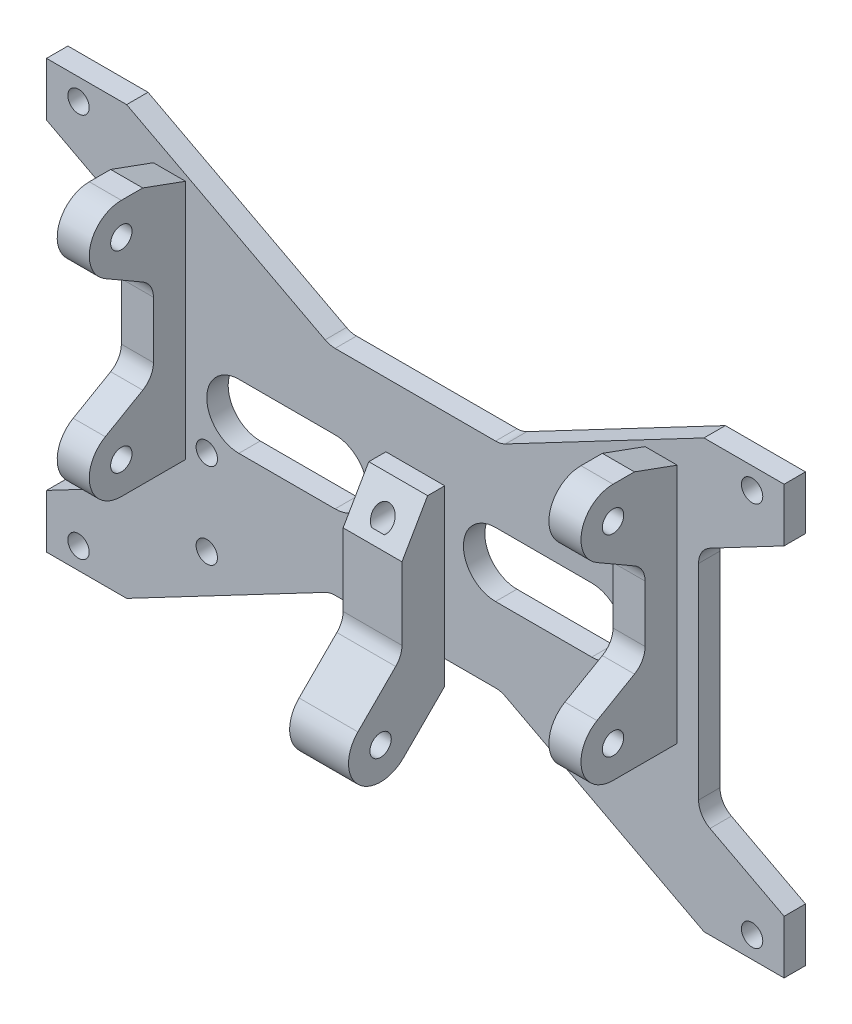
ISO-10303-21;
HEADER;
FILE_DESCRIPTION(('STEP AP214'),'2;1');
FILE_NAME('part.step','',(''),(''),'','','');
FILE_SCHEMA(('AUTOMOTIVE_DESIGN { 1 0 10303 214 1 1 1 1 }'));
ENDSEC;
DATA;
#1=APPLICATION_CONTEXT('core data for automotive mechanical design processes');
#2=APPLICATION_PROTOCOL_DEFINITION('international standard','automotive_design',2000,#1);
#3=PRODUCT_CONTEXT('',#1,'mechanical');
#4=PRODUCT('Part','Part','',(#3));
#5=PRODUCT_RELATED_PRODUCT_CATEGORY('part','',(#4));
#6=PRODUCT_DEFINITION_FORMATION('','',#4);
#7=PRODUCT_DEFINITION_CONTEXT('part definition',#1,'design');
#8=PRODUCT_DEFINITION('design','',#6,#7);
#9=PRODUCT_DEFINITION_SHAPE('','',#8);
#10=(LENGTH_UNIT() NAMED_UNIT(*) SI_UNIT(.MILLI.,.METRE.));
#11=(NAMED_UNIT(*) PLANE_ANGLE_UNIT() SI_UNIT($,.RADIAN.));
#12=(NAMED_UNIT(*) SI_UNIT($,.STERADIAN.) SOLID_ANGLE_UNIT());
#13=UNCERTAINTY_MEASURE_WITH_UNIT(LENGTH_MEASURE(1.E-05),#10,'distance_accuracy_value','');
#14=(GEOMETRIC_REPRESENTATION_CONTEXT(3) GLOBAL_UNCERTAINTY_ASSIGNED_CONTEXT((#13)) GLOBAL_UNIT_ASSIGNED_CONTEXT((#10,
#11,#12)) REPRESENTATION_CONTEXT('',''));
#15=CARTESIAN_POINT('',(0.,0.,0.));
#16=DIRECTION('',(0.,0.,1.));
#17=DIRECTION('',(1.,0.,0.));
#18=AXIS2_PLACEMENT_3D('',#15,#16,#17);
#19=CARTESIAN_POINT('',(8.7376,-38.8703841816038,6.35));
#20=DIRECTION('',(0.,0.,1.));
#21=DIRECTION('',(1.,0.,0.));
#22=AXIS2_PLACEMENT_3D('',#19,#20,#21);
#23=PLANE('',#22);
#24=CARTESIAN_POINT('',(0.,4.7752,6.35));
#25=DIRECTION('',(0.,0.,1.));
#26=DIRECTION('',(1.,0.,0.));
#27=AXIS2_PLACEMENT_3D('',#24,#25,#26);
#28=CIRCLE('',#27,3.175);
#29=CARTESIAN_POINT('',(3.175,4.7752,6.35));
#30=VERTEX_POINT('',#29);
#31=EDGE_CURVE('E140',#30,#30,#28,.F.);
#32=ORIENTED_EDGE('',*,*,#31,.F.);
#33=EDGE_LOOP('',(#32));
#34=FACE_BOUND('',#33,.T.);
#35=DIRECTION('',(0.,1.,0.));
#36=VECTOR('',#35,1.);
#37=CARTESIAN_POINT('',(-8.7376,-38.8703841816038,6.35));
#38=LINE('',#37,#36);
#39=CARTESIAN_POINT('',(-8.7376,-38.8703841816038,6.35));
#40=VERTEX_POINT('',#39);
#41=CARTESIAN_POINT('',(-8.7376,12.7,6.35));
#42=VERTEX_POINT('',#41);
#43=EDGE_CURVE('E154',#40,#42,#38,.T.);
#44=ORIENTED_EDGE('',*,*,#43,.T.);
#45=DIRECTION('',(-1.,0.,0.));
#46=VECTOR('',#45,1.);
#47=CARTESIAN_POINT('',(8.7376,12.7,6.35));
#48=LINE('',#47,#46);
#49=CARTESIAN_POINT('',(8.7376,12.7,6.35));
#50=VERTEX_POINT('',#49);
#51=EDGE_CURVE('E192',#50,#42,#48,.T.);
#52=ORIENTED_EDGE('',*,*,#51,.F.);
#53=DIRECTION('',(0.,1.,0.));
#54=VECTOR('',#53,1.);
#55=CARTESIAN_POINT('',(8.7376,-38.8703841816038,6.35));
#56=LINE('',#55,#54);
#57=CARTESIAN_POINT('',(8.7376,-38.8703841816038,6.35));
#58=VERTEX_POINT('',#57);
#59=EDGE_CURVE('E156',#58,#50,#56,.T.);
#60=ORIENTED_EDGE('',*,*,#59,.F.);
#61=DIRECTION('',(-1.,0.,0.));
#62=VECTOR('',#61,1.);
#63=CARTESIAN_POINT('',(8.7376,-38.8703841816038,6.35));
#64=LINE('',#63,#62);
#65=EDGE_CURVE('E171',#58,#40,#64,.T.);
#66=ORIENTED_EDGE('',*,*,#65,.T.);
#67=EDGE_LOOP('',(#44,#52,#60,#66));
#68=FACE_BOUND('',#67,.T.);
#69=CARTESIAN_POINT('',(0.,-22.225,6.35));
#70=DIRECTION('',(0.,0.,1.));
#71=DIRECTION('',(1.,0.,0.));
#72=AXIS2_PLACEMENT_3D('',#69,#70,#71);
#73=CIRCLE('',#72,3.175);
#74=CARTESIAN_POINT('',(3.175,-22.225,6.35));
#75=VERTEX_POINT('',#74);
#76=EDGE_CURVE('E137',#75,#75,#73,.F.);
#77=ORIENTED_EDGE('',*,*,#76,.F.);
#78=EDGE_LOOP('',(#77));
#79=FACE_BOUND('',#78,.T.);
#80=ADVANCED_FACE('F45',(#34,#68,#79),#23,.F.);
#81=CARTESIAN_POINT('',(8.7376,-0.498227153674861,19.05));
#82=DIRECTION('',(0.,-0.500000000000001,-0.866025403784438));
#83=DIRECTION('',(-1.,0.,0.));
#84=AXIS2_PLACEMENT_3D('',#81,#82,#83);
#85=PLANE('',#84);
#86=DIRECTION('',(0.,0.866025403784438,-0.500000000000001));
#87=VECTOR('',#86,1.);
#88=CARTESIAN_POINT('',(8.7376,-36.2116874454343,39.6691759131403));
#89=LINE('',#88,#87);
#90=CARTESIAN_POINT('',(8.7376,12.7,11.43));
#91=VERTEX_POINT('',#90);
#92=CARTESIAN_POINT('',(8.7376,-0.498227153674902,19.05));
#93=VERTEX_POINT('',#92);
#94=EDGE_CURVE('E123',#91,#93,#89,.F.);
#95=ORIENTED_EDGE('',*,*,#94,.F.);
#96=DIRECTION('',(1.,0.,0.));
#97=VECTOR('',#96,1.);
#98=CARTESIAN_POINT('',(8.7376,12.7,11.43));
#99=LINE('',#98,#97);
#100=CARTESIAN_POINT('',(-8.7376,12.7,11.43));
#101=VERTEX_POINT('',#100);
#102=EDGE_CURVE('E200',#101,#91,#99,.T.);
#103=ORIENTED_EDGE('',*,*,#102,.F.);
#104=DIRECTION('',(0.,-0.866025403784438,0.500000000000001));
#105=VECTOR('',#104,1.);
#106=CARTESIAN_POINT('',(-8.7376,-0.498227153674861,19.05));
#107=LINE('',#106,#105);
#108=CARTESIAN_POINT('',(-8.7376,-0.498227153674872,19.05));
#109=VERTEX_POINT('',#108);
#110=EDGE_CURVE('E198',#109,#101,#107,.F.);
#111=ORIENTED_EDGE('',*,*,#110,.F.);
#112=DIRECTION('',(-1.,0.,0.));
#113=VECTOR('',#112,1.);
#114=CARTESIAN_POINT('',(8.7376,-0.498227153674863,19.05));
#115=LINE('',#114,#113);
#116=EDGE_CURVE('E195',#93,#109,#115,.T.);
#117=ORIENTED_EDGE('',*,*,#116,.F.);
#118=EDGE_LOOP('',(#95,#103,#111,#117));
#119=FACE_BOUND('',#118,.T.);
#120=DIRECTION('',(-1.,0.,0.));
#121=VECTOR('',#120,1.);
#122=CARTESIAN_POINT('',(8.7376,2.22940645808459,17.4752));
#123=LINE('',#122,#121);
#124=CARTESIAN_POINT('',(-1.89725070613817,2.22940645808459,17.4752));
#125=VERTEX_POINT('',#124);
#126=CARTESIAN_POINT('',(1.89725070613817,2.22940645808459,17.4752));
#127=VERTEX_POINT('',#126);
#128=EDGE_CURVE('E115',#125,#127,#123,.F.);
#129=ORIENTED_EDGE('',*,*,#128,.F.);
#130=CARTESIAN_POINT('',(0.,4.7752,16.0053854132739));
#131=DIRECTION('',(0.,-0.500000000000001,-0.866025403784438));
#132=DIRECTION('',(0.,0.866025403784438,-0.500000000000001));
#133=AXIS2_PLACEMENT_3D('',#130,#131,#132);
#134=ELLIPSE('',#133,3.66617420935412,3.175);
#135=EDGE_CURVE('E122',#125,#127,#134,.T.);
#136=ORIENTED_EDGE('',*,*,#135,.T.);
#137=EDGE_LOOP('',(#129,#136));
#138=FACE_BOUND('',#137,.T.);
#139=ADVANCED_FACE('F130',(#119,#138),#85,.F.);
#140=CARTESIAN_POINT('',(8.7376,-44.45,25.4));
#141=DIRECTION('',(1.,0.,0.));
#142=DIRECTION('',(0.,0.,-1.));
#143=AXIS2_PLACEMENT_3D('',#140,#141,#142);
#144=PLANE('',#143);
#145=DIRECTION('',(0.,0.,1.));
#146=VECTOR('',#145,1.);
#147=CARTESIAN_POINT('',(8.7376,12.7,6.35));
#148=LINE('',#147,#146);
#149=EDGE_CURVE('E159',#50,#91,#148,.T.);
#150=ORIENTED_EDGE('',*,*,#149,.T.);
#151=ORIENTED_EDGE('',*,*,#94,.T.);
#152=DIRECTION('',(0.,-1.,0.));
#153=VECTOR('',#152,1.);
#154=CARTESIAN_POINT('',(8.7376,12.7,19.05));
#155=LINE('',#154,#153);
#156=CARTESIAN_POINT('',(8.7376,-21.9993596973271,19.05));
#157=VERTEX_POINT('',#156);
#158=EDGE_CURVE('E163',#93,#157,#155,.T.);
#159=ORIENTED_EDGE('',*,*,#158,.T.);
#160=CARTESIAN_POINT('',(8.7376,-21.9993596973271,25.4));
#161=DIRECTION('',(1.,0.,0.));
#162=DIRECTION('',(0.,0.,-1.));
#163=AXIS2_PLACEMENT_3D('',#160,#161,#162);
#164=CIRCLE('',#163,6.35);
#165=CARTESIAN_POINT('',(8.7376,-26.4894877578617,20.9098719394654));
#166=VERTEX_POINT('',#165);
#167=EDGE_CURVE('E12',#157,#166,#164,.F.);
#168=ORIENTED_EDGE('',*,*,#167,.T.);
#169=DIRECTION('',(0.,-0.707106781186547,0.707106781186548));
#170=VECTOR('',#169,1.);
#171=CARTESIAN_POINT('',(8.7376,-24.6296158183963,19.05));
#172=LINE('',#171,#170);
#173=CARTESIAN_POINT('',(8.7376,-37.7148079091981,32.1351920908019));
#174=VERTEX_POINT('',#173);
#175=EDGE_CURVE('E165',#166,#174,#172,.T.);
#176=ORIENTED_EDGE('',*,*,#175,.T.);
#177=CARTESIAN_POINT('',(8.7376,-44.45,25.4));
#178=DIRECTION('',(1.,0.,0.));
#179=DIRECTION('',(0.,0.,-1.));
#180=AXIS2_PLACEMENT_3D('',#177,#178,#179);
#181=CIRCLE('',#180,9.525);
#182=CARTESIAN_POINT('',(8.7376,-51.1851920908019,18.6648079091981));
#183=VERTEX_POINT('',#182);
#184=EDGE_CURVE('E167',#174,#183,#181,.T.);
#185=ORIENTED_EDGE('',*,*,#184,.T.);
#186=DIRECTION('',(0.,0.707106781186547,-0.707106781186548));
#187=VECTOR('',#186,1.);
#188=CARTESIAN_POINT('',(8.7376,-51.1851920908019,18.6648079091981));
#189=LINE('',#188,#187);
#190=EDGE_CURVE('E169',#183,#58,#189,.T.);
#191=ORIENTED_EDGE('',*,*,#190,.T.);
#192=ORIENTED_EDGE('',*,*,#59,.T.);
#193=EDGE_LOOP('',(#150,#151,#159,#168,#176,#185,#191,#192));
#194=FACE_BOUND('',#193,.T.);
#195=CARTESIAN_POINT('',(8.7376,-44.45,25.4));
#196=DIRECTION('',(1.,0.,0.));
#197=DIRECTION('',(0.,0.,-1.));
#198=AXIS2_PLACEMENT_3D('',#195,#196,#197);
#199=CIRCLE('',#198,3.175);
#200=CARTESIAN_POINT('',(8.7376,-44.45,22.225));
#201=VERTEX_POINT('',#200);
#202=EDGE_CURVE('E145',#201,#201,#199,.T.);
#203=ORIENTED_EDGE('',*,*,#202,.F.);
#204=EDGE_LOOP('',(#203));
#205=FACE_BOUND('',#204,.T.);
#206=ADVANCED_FACE('F203',(#194,#205),#144,.T.);
#207=CARTESIAN_POINT('',(-8.7376,-44.45,25.4));
#208=DIRECTION('',(1.,0.,0.));
#209=DIRECTION('',(0.,0.,-1.));
#210=AXIS2_PLACEMENT_3D('',#207,#208,#209);
#211=PLANE('',#210);
#212=DIRECTION('',(0.,-1.,0.));
#213=VECTOR('',#212,1.);
#214=CARTESIAN_POINT('',(-8.7376,12.7,19.05));
#215=LINE('',#214,#213);
#216=CARTESIAN_POINT('',(-8.7376,-21.9993596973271,19.05));
#217=VERTEX_POINT('',#216);
#218=EDGE_CURVE('E177',#109,#217,#215,.T.);
#219=ORIENTED_EDGE('',*,*,#218,.F.);
#220=ORIENTED_EDGE('',*,*,#110,.T.);
#221=DIRECTION('',(0.,0.,1.));
#222=VECTOR('',#221,1.);
#223=CARTESIAN_POINT('',(-8.7376,12.7,6.35));
#224=LINE('',#223,#222);
#225=EDGE_CURVE('E174',#42,#101,#224,.T.);
#226=ORIENTED_EDGE('',*,*,#225,.F.);
#227=ORIENTED_EDGE('',*,*,#43,.F.);
#228=DIRECTION('',(0.,0.707106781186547,-0.707106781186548));
#229=VECTOR('',#228,1.);
#230=CARTESIAN_POINT('',(-8.7376,-51.1851920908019,18.6648079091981));
#231=LINE('',#230,#229);
#232=CARTESIAN_POINT('',(-8.7376,-51.1851920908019,18.6648079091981));
#233=VERTEX_POINT('',#232);
#234=EDGE_CURVE('E160',#233,#40,#231,.T.);
#235=ORIENTED_EDGE('',*,*,#234,.F.);
#236=CARTESIAN_POINT('',(-8.7376,-44.45,25.4));
#237=DIRECTION('',(1.,0.,0.));
#238=DIRECTION('',(0.,0.,-1.));
#239=AXIS2_PLACEMENT_3D('',#236,#237,#238);
#240=CIRCLE('',#239,9.525);
#241=CARTESIAN_POINT('',(-8.7376,-37.7148079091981,32.1351920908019));
#242=VERTEX_POINT('',#241);
#243=EDGE_CURVE('E181',#242,#233,#240,.T.);
#244=ORIENTED_EDGE('',*,*,#243,.F.);
#245=DIRECTION('',(0.,-0.707106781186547,0.707106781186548));
#246=VECTOR('',#245,1.);
#247=CARTESIAN_POINT('',(-8.7376,-24.6296158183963,19.05));
#248=LINE('',#247,#246);
#249=CARTESIAN_POINT('',(-8.7376,-26.4894877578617,20.9098719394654));
#250=VERTEX_POINT('',#249);
#251=EDGE_CURVE('E179',#250,#242,#248,.T.);
#252=ORIENTED_EDGE('',*,*,#251,.F.);
#253=CARTESIAN_POINT('',(-8.7376,-21.9993596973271,25.4));
#254=DIRECTION('',(1.,0.,0.));
#255=DIRECTION('',(0.,0.,-1.));
#256=AXIS2_PLACEMENT_3D('',#253,#254,#255);
#257=CIRCLE('',#256,6.35);
#258=EDGE_CURVE('E53',#250,#217,#257,.T.);
#259=ORIENTED_EDGE('',*,*,#258,.T.);
#260=EDGE_LOOP('',(#219,#220,#226,#227,#235,#244,#252,#259));
#261=FACE_BOUND('',#260,.T.);
#262=CARTESIAN_POINT('',(-8.7376,-44.45,25.4));
#263=DIRECTION('',(1.,0.,0.));
#264=DIRECTION('',(0.,0.,-1.));
#265=AXIS2_PLACEMENT_3D('',#262,#263,#264);
#266=CIRCLE('',#265,3.175);
#267=CARTESIAN_POINT('',(-8.7376,-44.45,22.225));
#268=VERTEX_POINT('',#267);
#269=EDGE_CURVE('E139',#268,#268,#266,.T.);
#270=ORIENTED_EDGE('',*,*,#269,.T.);
#271=EDGE_LOOP('',(#270));
#272=FACE_BOUND('',#271,.T.);
#273=ADVANCED_FACE('F210',(#261,#272),#211,.F.);
#274=CARTESIAN_POINT('',(8.7376,12.7,6.35));
#275=DIRECTION('',(0.,-1.,0.));
#276=DIRECTION('',(0.,0.,-1.));
#277=AXIS2_PLACEMENT_3D('',#274,#275,#276);
#278=PLANE('',#277);
#279=ORIENTED_EDGE('',*,*,#225,.T.);
#280=ORIENTED_EDGE('',*,*,#102,.T.);
#281=ORIENTED_EDGE('',*,*,#149,.F.);
#282=ORIENTED_EDGE('',*,*,#51,.T.);
#283=EDGE_LOOP('',(#279,#280,#281,#282));
#284=FACE_BOUND('',#283,.T.);
#285=ADVANCED_FACE('F214',(#284),#278,.F.);
#286=CARTESIAN_POINT('',(8.7376,12.7,19.05));
#287=DIRECTION('',(0.,0.,-1.));
#288=DIRECTION('',(0.,1.,0.));
#289=AXIS2_PLACEMENT_3D('',#286,#287,#288);
#290=PLANE('',#289);
#291=ORIENTED_EDGE('',*,*,#218,.T.);
#292=DIRECTION('',(-1.,0.,0.));
#293=VECTOR('',#292,1.);
#294=CARTESIAN_POINT('',(8.7376,-21.9993596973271,19.05));
#295=LINE('',#294,#293);
#296=EDGE_CURVE('E66',#217,#157,#295,.F.);
#297=ORIENTED_EDGE('',*,*,#296,.T.);
#298=ORIENTED_EDGE('',*,*,#158,.F.);
#299=ORIENTED_EDGE('',*,*,#116,.T.);
#300=EDGE_LOOP('',(#291,#297,#298,#299));
#301=FACE_BOUND('',#300,.T.);
#302=ADVANCED_FACE('F209',(#301),#290,.F.);
#303=CARTESIAN_POINT('',(8.7376,-24.6296158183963,19.05));
#304=DIRECTION('',(0.,-0.707106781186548,-0.707106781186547));
#305=DIRECTION('',(0.,0.707106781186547,-0.707106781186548));
#306=AXIS2_PLACEMENT_3D('',#303,#304,#305);
#307=PLANE('',#306);
#308=ORIENTED_EDGE('',*,*,#175,.F.);
#309=DIRECTION('',(-1.,0.,0.));
#310=VECTOR('',#309,1.);
#311=CARTESIAN_POINT('',(-8.7376,-26.4894877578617,20.9098719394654));
#312=LINE('',#311,#310);
#313=EDGE_CURVE('E131',#166,#250,#312,.T.);
#314=ORIENTED_EDGE('',*,*,#313,.T.);
#315=ORIENTED_EDGE('',*,*,#251,.T.);
#316=DIRECTION('',(-1.,0.,0.));
#317=VECTOR('',#316,1.);
#318=CARTESIAN_POINT('',(8.7376,-37.7148079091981,32.1351920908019));
#319=LINE('',#318,#317);
#320=EDGE_CURVE('E189',#174,#242,#319,.T.);
#321=ORIENTED_EDGE('',*,*,#320,.F.);
#322=EDGE_LOOP('',(#308,#314,#315,#321));
#323=FACE_BOUND('',#322,.T.);
#324=ADVANCED_FACE('F232',(#323),#307,.F.);
#325=CARTESIAN_POINT('',(8.7376,-44.45,25.4));
#326=DIRECTION('',(-1.,0.,0.));
#327=DIRECTION('',(0.,0.,1.));
#328=AXIS2_PLACEMENT_3D('',#325,#326,#327);
#329=CYLINDRICAL_SURFACE('',#328,9.525);
#330=ORIENTED_EDGE('',*,*,#243,.T.);
#331=DIRECTION('',(-1.,0.,0.));
#332=VECTOR('',#331,1.);
#333=CARTESIAN_POINT('',(8.7376,-51.1851920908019,18.6648079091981));
#334=LINE('',#333,#332);
#335=EDGE_CURVE('E186',#183,#233,#334,.T.);
#336=ORIENTED_EDGE('',*,*,#335,.F.);
#337=ORIENTED_EDGE('',*,*,#184,.F.);
#338=ORIENTED_EDGE('',*,*,#320,.T.);
#339=EDGE_LOOP('',(#330,#336,#337,#338));
#340=FACE_BOUND('',#339,.T.);
#341=ADVANCED_FACE('F228',(#340),#329,.T.);
#342=CARTESIAN_POINT('',(8.7376,-51.1851920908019,18.6648079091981));
#343=DIRECTION('',(0.,0.707106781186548,0.707106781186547));
#344=DIRECTION('',(0.,-0.707106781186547,0.707106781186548));
#345=AXIS2_PLACEMENT_3D('',#342,#343,#344);
#346=PLANE('',#345);
#347=ORIENTED_EDGE('',*,*,#234,.T.);
#348=ORIENTED_EDGE('',*,*,#65,.F.);
#349=ORIENTED_EDGE('',*,*,#190,.F.);
#350=ORIENTED_EDGE('',*,*,#335,.T.);
#351=EDGE_LOOP('',(#347,#348,#349,#350));
#352=FACE_BOUND('',#351,.T.);
#353=ADVANCED_FACE('F223',(#352),#346,.F.);
#354=CARTESIAN_POINT('',(8.7376,-44.45,25.4));
#355=DIRECTION('',(-1.,0.,0.));
#356=DIRECTION('',(0.,0.,1.));
#357=AXIS2_PLACEMENT_3D('',#354,#355,#356);
#358=CYLINDRICAL_SURFACE('',#357,3.175);
#359=ORIENTED_EDGE('',*,*,#202,.T.);
#360=EDGE_LOOP('',(#359));
#361=FACE_BOUND('',#360,.T.);
#362=ORIENTED_EDGE('',*,*,#269,.F.);
#363=EDGE_LOOP('',(#362));
#364=FACE_BOUND('',#363,.T.);
#365=ADVANCED_FACE('F260',(#361,#364),#358,.F.);
#366=CARTESIAN_POINT('',(0.,4.7752,17.4752));
#367=DIRECTION('',(0.,0.,-1.));
#368=DIRECTION('',(-1.,0.,0.));
#369=AXIS2_PLACEMENT_3D('',#366,#367,#368);
#370=CYLINDRICAL_SURFACE('',#369,3.175);
#371=CARTESIAN_POINT('',(0.,4.7752,17.4752));
#372=DIRECTION('',(0.,0.,1.));
#373=DIRECTION('',(1.,0.,0.));
#374=AXIS2_PLACEMENT_3D('',#371,#372,#373);
#375=CIRCLE('',#374,3.175);
#376=EDGE_CURVE('E118',#125,#127,#375,.T.);
#377=ORIENTED_EDGE('',*,*,#376,.T.);
#378=ORIENTED_EDGE('',*,*,#135,.F.);
#379=EDGE_LOOP('',(#377,#378));
#380=FACE_BOUND('',#379,.T.);
#381=ORIENTED_EDGE('',*,*,#31,.T.);
#382=EDGE_LOOP('',(#381));
#383=FACE_BOUND('',#382,.T.);
#384=ADVANCED_FACE('F126',(#380,#383),#370,.F.);
#385=CARTESIAN_POINT('',(0.,4.7752,17.4752));
#386=DIRECTION('',(0.,0.,1.));
#387=DIRECTION('',(1.,0.,0.));
#388=AXIS2_PLACEMENT_3D('',#385,#386,#387);
#389=PLANE('',#388);
#390=ORIENTED_EDGE('',*,*,#128,.T.);
#391=ORIENTED_EDGE('',*,*,#376,.F.);
#392=EDGE_LOOP('',(#390,#391));
#393=FACE_BOUND('',#392,.T.);
#394=ADVANCED_FACE('F117',(#393),#389,.F.);
#395=CARTESIAN_POINT('',(0.,-22.225,17.4752));
#396=DIRECTION('',(0.,0.,-1.));
#397=DIRECTION('',(-1.,0.,0.));
#398=AXIS2_PLACEMENT_3D('',#395,#396,#397);
#399=CYLINDRICAL_SURFACE('',#398,3.175);
#400=CARTESIAN_POINT('',(0.,-22.225,17.4752));
#401=DIRECTION('',(0.,0.,1.));
#402=DIRECTION('',(1.,0.,0.));
#403=AXIS2_PLACEMENT_3D('',#400,#401,#402);
#404=CIRCLE('',#403,3.175);
#405=CARTESIAN_POINT('',(3.175,-22.225,17.4752));
#406=VERTEX_POINT('',#405);
#407=EDGE_CURVE('E128',#406,#406,#404,.T.);
#408=ORIENTED_EDGE('',*,*,#407,.T.);
#409=EDGE_LOOP('',(#408));
#410=FACE_BOUND('',#409,.T.);
#411=ORIENTED_EDGE('',*,*,#76,.T.);
#412=EDGE_LOOP('',(#411));
#413=FACE_BOUND('',#412,.T.);
#414=ADVANCED_FACE('F240',(#410,#413),#399,.F.);
#415=CARTESIAN_POINT('',(0.,-22.225,17.4752));
#416=DIRECTION('',(0.,0.,1.));
#417=DIRECTION('',(1.,0.,0.));
#418=AXIS2_PLACEMENT_3D('',#415,#416,#417);
#419=PLANE('',#418);
#420=ORIENTED_EDGE('',*,*,#407,.F.);
#421=EDGE_LOOP('',(#420));
#422=FACE_BOUND('',#421,.T.);
#423=ADVANCED_FACE('F236',(#422),#419,.F.);
#424=CARTESIAN_POINT('',(8.7376,-21.9993596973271,25.4));
#425=DIRECTION('',(1.,0.,0.));
#426=DIRECTION('',(0.,0.,-1.));
#427=AXIS2_PLACEMENT_3D('',#424,#425,#426);
#428=CYLINDRICAL_SURFACE('',#427,6.35);
#429=ORIENTED_EDGE('',*,*,#167,.F.);
#430=ORIENTED_EDGE('',*,*,#296,.F.);
#431=ORIENTED_EDGE('',*,*,#258,.F.);
#432=ORIENTED_EDGE('',*,*,#313,.F.);
#433=EDGE_LOOP('',(#429,#430,#431,#432));
#434=FACE_BOUND('',#433,.T.);
#435=ADVANCED_FACE('F47',(#434),#428,.F.);
#436=CLOSED_SHELL('',(#80,#139,#206,#273,#285,#302,#324,#341,#353,#365,#384,#394,#414,#423,#435));
#437=MANIFOLD_SOLID_BREP('B2',#436);
#438=CARTESIAN_POINT('',(-68.2498,-19.05,6.35));
#439=DIRECTION('',(0.,0.,1.));
#440=DIRECTION('',(0.,-1.,0.));
#441=AXIS2_PLACEMENT_3D('',#438,#439,#440);
#442=PLANE('',#441);
#443=CARTESIAN_POINT('',(-73.025,0.,6.35));
#444=DIRECTION('',(0.,0.,1.));
#445=DIRECTION('',(0.,-1.,0.));
#446=AXIS2_PLACEMENT_3D('',#443,#444,#445);
#447=CIRCLE('',#446,3.175);
#448=CARTESIAN_POINT('',(-73.025,-3.175,6.35));
#449=VERTEX_POINT('',#448);
#450=EDGE_CURVE('E510',#449,#449,#447,.F.);
#451=ORIENTED_EDGE('',*,*,#450,.F.);
#452=EDGE_LOOP('',(#451));
#453=FACE_BOUND('',#452,.T.);
#454=DIRECTION('',(0.,1.,0.));
#455=VECTOR('',#454,1.);
#456=CARTESIAN_POINT('',(-77.7748,-19.05,6.35));
#457=LINE('',#456,#455);
#458=CARTESIAN_POINT('',(-77.7748,-19.05,6.35));
#459=VERTEX_POINT('',#458);
#460=CARTESIAN_POINT('',(-77.7748,52.5275780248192,6.35000000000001));
#461=VERTEX_POINT('',#460);
#462=EDGE_CURVE('E550',#459,#461,#457,.T.);
#463=ORIENTED_EDGE('',*,*,#462,.T.);
#464=DIRECTION('',(1.,0.,0.));
#465=VECTOR('',#464,1.);
#466=CARTESIAN_POINT('',(-68.2498,52.5275780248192,6.35000000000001));
#467=LINE('',#466,#465);
#468=CARTESIAN_POINT('',(-68.2498,52.5275780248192,6.35));
#469=VERTEX_POINT('',#468);
#470=EDGE_CURVE('E385',#461,#469,#467,.T.);
#471=ORIENTED_EDGE('',*,*,#470,.T.);
#472=DIRECTION('',(0.,1.,0.));
#473=VECTOR('',#472,1.);
#474=CARTESIAN_POINT('',(-68.2498,-19.05,6.35));
#475=LINE('',#474,#473);
#476=CARTESIAN_POINT('',(-68.2498,-19.05,6.35));
#477=VERTEX_POINT('',#476);
#478=EDGE_CURVE('E457',#477,#469,#475,.T.);
#479=ORIENTED_EDGE('',*,*,#478,.F.);
#480=DIRECTION('',(-1.,0.,0.));
#481=VECTOR('',#480,1.);
#482=CARTESIAN_POINT('',(-68.2498,-19.05,6.35));
#483=LINE('',#482,#481);
#484=EDGE_CURVE('E461',#477,#459,#483,.T.);
#485=ORIENTED_EDGE('',*,*,#484,.T.);
#486=EDGE_LOOP('',(#463,#471,#479,#485));
#487=FACE_BOUND('',#486,.T.);
#488=CARTESIAN_POINT('',(-73.025,38.1,6.35));
#489=DIRECTION('',(0.,0.,1.));
#490=DIRECTION('',(0.,-1.,0.));
#491=AXIS2_PLACEMENT_3D('',#488,#489,#490);
#492=CIRCLE('',#491,3.175);
#493=CARTESIAN_POINT('',(-73.025,34.925,6.35));
#494=VERTEX_POINT('',#493);
#495=EDGE_CURVE('E380',#494,#494,#492,.F.);
#496=ORIENTED_EDGE('',*,*,#495,.F.);
#497=EDGE_LOOP('',(#496));
#498=FACE_BOUND('',#497,.T.);
#499=ADVANCED_FACE('F376',(#453,#487,#498),#442,.F.);
#500=CARTESIAN_POINT('',(-68.2498,47.625,25.4));
#501=DIRECTION('',(1.,0.,0.));
#502=DIRECTION('',(0.,0.,-1.));
#503=AXIS2_PLACEMENT_3D('',#500,#501,#502);
#504=PLANE('',#503);
#505=CARTESIAN_POINT('',(-68.2498,47.625,25.4));
#506=DIRECTION('',(1.,0.,0.));
#507=DIRECTION('',(0.,0.,-1.));
#508=AXIS2_PLACEMENT_3D('',#505,#506,#507);
#509=CIRCLE('',#508,3.175);
#510=CARTESIAN_POINT('',(-68.2498,47.625,28.575));
#511=VERTEX_POINT('',#510);
#512=EDGE_CURVE('E531',#511,#511,#509,.T.);
#513=ORIENTED_EDGE('',*,*,#512,.F.);
#514=EDGE_LOOP('',(#513));
#515=FACE_BOUND('',#514,.T.);
#516=ORIENTED_EDGE('',*,*,#478,.T.);
#517=DIRECTION('',(0.,-0.342020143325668,-0.939692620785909));
#518=VECTOR('',#517,1.);
#519=CARTESIAN_POINT('',(-68.2498,58.0766373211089,21.5959151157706));
#520=LINE('',#519,#518);
#521=CARTESIAN_POINT('',(-68.2498,57.15,19.0500000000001));
#522=VERTEX_POINT('',#521);
#523=EDGE_CURVE('E43',#469,#522,#520,.F.);
#524=ORIENTED_EDGE('',*,*,#523,.T.);
#525=DIRECTION('',(0.,0.,1.));
#526=VECTOR('',#525,1.);
#527=CARTESIAN_POINT('',(-68.2498,57.15,6.35000000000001));
#528=LINE('',#527,#526);
#529=CARTESIAN_POINT('',(-68.2498,57.15,25.4));
#530=VERTEX_POINT('',#529);
#531=EDGE_CURVE('E465',#522,#530,#528,.T.);
#532=ORIENTED_EDGE('',*,*,#531,.T.);
#533=CARTESIAN_POINT('',(-68.2498,47.625,25.4));
#534=DIRECTION('',(1.,0.,0.));
#535=DIRECTION('',(0.,0.,-1.));
#536=AXIS2_PLACEMENT_3D('',#533,#534,#535);
#537=CIRCLE('',#536,9.52500000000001);
#538=CARTESIAN_POINT('',(-68.2498,39.3761080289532,30.1625));
#539=VERTEX_POINT('',#538);
#540=EDGE_CURVE('E537',#530,#539,#537,.T.);
#541=ORIENTED_EDGE('',*,*,#540,.T.);
#542=DIRECTION('',(0.,-0.499999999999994,-0.866025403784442));
#543=VECTOR('',#542,1.);
#544=CARTESIAN_POINT('',(-68.2498,39.3761080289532,30.1625));
#545=LINE('',#544,#543);
#546=CARTESIAN_POINT('',(-68.2498,32.9603031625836,19.05));
#547=VERTEX_POINT('',#546);
#548=EDGE_CURVE('E539',#539,#547,#545,.T.);
#549=ORIENTED_EDGE('',*,*,#548,.T.);
#550=CARTESIAN_POINT('',(-68.2498,27.4610418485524,22.225));
#551=DIRECTION('',(1.,0.,0.));
#552=DIRECTION('',(0.,0.,-1.));
#553=AXIS2_PLACEMENT_3D('',#550,#551,#552);
#554=CIRCLE('',#553,6.35);
#555=CARTESIAN_POINT('',(-68.2498,27.4610418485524,15.875));
#556=VERTEX_POINT('',#555);
#557=EDGE_CURVE('E504',#547,#556,#554,.F.);
#558=ORIENTED_EDGE('',*,*,#557,.T.);
#559=DIRECTION('',(0.,-1.,0.));
#560=VECTOR('',#559,1.);
#561=CARTESIAN_POINT('',(-68.2498,31.1272160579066,15.875));
#562=LINE('',#561,#560);
#563=CARTESIAN_POINT('',(-68.2498,10.6389581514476,15.875));
#564=VERTEX_POINT('',#563);
#565=EDGE_CURVE('E542',#556,#564,#562,.T.);
#566=ORIENTED_EDGE('',*,*,#565,.T.);
#567=CARTESIAN_POINT('',(-68.2498,10.6389581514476,22.225));
#568=DIRECTION('',(1.,0.,0.));
#569=DIRECTION('',(0.,0.,-1.));
#570=AXIS2_PLACEMENT_3D('',#567,#568,#569);
#571=CIRCLE('',#570,6.35);
#572=CARTESIAN_POINT('',(-68.2498,5.13969683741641,19.05));
#573=VERTEX_POINT('',#572);
#574=EDGE_CURVE('E500',#564,#573,#571,.F.);
#575=ORIENTED_EDGE('',*,*,#574,.T.);
#576=DIRECTION('',(0.,-0.499999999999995,0.866025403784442));
#577=VECTOR('',#576,1.);
#578=CARTESIAN_POINT('',(-68.2498,6.97278394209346,15.875));
#579=LINE('',#578,#577);
#580=CARTESIAN_POINT('',(-68.2498,-1.27610802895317,30.1625));
#581=VERTEX_POINT('',#580);
#582=EDGE_CURVE('E545',#573,#581,#579,.T.);
#583=ORIENTED_EDGE('',*,*,#582,.T.);
#584=CARTESIAN_POINT('',(-68.2498,-9.52499999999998,25.4));
#585=DIRECTION('',(1.,0.,0.));
#586=DIRECTION('',(0.,0.,-1.));
#587=AXIS2_PLACEMENT_3D('',#584,#585,#586);
#588=CIRCLE('',#587,9.525);
#589=CARTESIAN_POINT('',(-68.2498,-19.05,25.4));
#590=VERTEX_POINT('',#589);
#591=EDGE_CURVE('E472',#581,#590,#588,.T.);
#592=ORIENTED_EDGE('',*,*,#591,.T.);
#593=DIRECTION('',(0.,0.,-1.));
#594=VECTOR('',#593,1.);
#595=CARTESIAN_POINT('',(-68.2498,-19.05,25.4));
#596=LINE('',#595,#594);
#597=EDGE_CURVE('E466',#590,#477,#596,.T.);
#598=ORIENTED_EDGE('',*,*,#597,.T.);
#599=EDGE_LOOP('',(#516,#524,#532,#541,#549,#558,#566,#575,#583,#592,#598));
#600=FACE_BOUND('',#599,.T.);
#601=CARTESIAN_POINT('',(-68.2498,-9.52499999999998,25.4));
#602=DIRECTION('',(1.,0.,0.));
#603=DIRECTION('',(0.,0.,-1.));
#604=AXIS2_PLACEMENT_3D('',#601,#602,#603);
#605=CIRCLE('',#604,3.175);
#606=CARTESIAN_POINT('',(-68.2498,-9.52499999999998,28.575));
#607=VERTEX_POINT('',#606);
#608=EDGE_CURVE('E525',#607,#607,#605,.T.);
#609=ORIENTED_EDGE('',*,*,#608,.F.);
#610=EDGE_LOOP('',(#609));
#611=FACE_BOUND('',#610,.T.);
#612=ADVANCED_FACE('F469',(#515,#600,#611),#504,.T.);
#613=CARTESIAN_POINT('',(-77.7748,47.625,25.4));
#614=DIRECTION('',(1.,0.,0.));
#615=DIRECTION('',(0.,0.,-1.));
#616=AXIS2_PLACEMENT_3D('',#613,#614,#615);
#617=PLANE('',#616);
#618=CARTESIAN_POINT('',(-77.7748,47.625,25.4));
#619=DIRECTION('',(1.,0.,0.));
#620=DIRECTION('',(0.,0.,-1.));
#621=AXIS2_PLACEMENT_3D('',#618,#619,#620);
#622=CIRCLE('',#621,3.175);
#623=CARTESIAN_POINT('',(-77.7748,47.625,28.575));
#624=VERTEX_POINT('',#623);
#625=EDGE_CURVE('E528',#624,#624,#622,.T.);
#626=ORIENTED_EDGE('',*,*,#625,.T.);
#627=EDGE_LOOP('',(#626));
#628=FACE_BOUND('',#627,.T.);
#629=DIRECTION('',(0.,0.,1.));
#630=VECTOR('',#629,1.);
#631=CARTESIAN_POINT('',(-77.7748,57.15,6.35000000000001));
#632=LINE('',#631,#630);
#633=CARTESIAN_POINT('',(-77.7748,57.15,19.0500000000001));
#634=VERTEX_POINT('',#633);
#635=CARTESIAN_POINT('',(-77.7748,57.15,25.4));
#636=VERTEX_POINT('',#635);
#637=EDGE_CURVE('E552',#634,#636,#632,.T.);
#638=ORIENTED_EDGE('',*,*,#637,.F.);
#639=DIRECTION('',(0.,0.342020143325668,0.939692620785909));
#640=VECTOR('',#639,1.);
#641=CARTESIAN_POINT('',(-77.7748,57.15,19.0500000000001));
#642=LINE('',#641,#640);
#643=EDGE_CURVE('E400',#634,#461,#642,.F.);
#644=ORIENTED_EDGE('',*,*,#643,.T.);
#645=ORIENTED_EDGE('',*,*,#462,.F.);
#646=DIRECTION('',(0.,0.,-1.));
#647=VECTOR('',#646,1.);
#648=CARTESIAN_POINT('',(-77.7748,-19.05,25.4));
#649=LINE('',#648,#647);
#650=CARTESIAN_POINT('',(-77.7748,-19.05,25.4));
#651=VERTEX_POINT('',#650);
#652=EDGE_CURVE('E480',#651,#459,#649,.T.);
#653=ORIENTED_EDGE('',*,*,#652,.F.);
#654=CARTESIAN_POINT('',(-77.7748,-9.52499999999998,25.4));
#655=DIRECTION('',(1.,0.,0.));
#656=DIRECTION('',(0.,0.,-1.));
#657=AXIS2_PLACEMENT_3D('',#654,#655,#656);
#658=CIRCLE('',#657,9.525);
#659=CARTESIAN_POINT('',(-77.7748,-1.27610802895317,30.1625));
#660=VERTEX_POINT('',#659);
#661=EDGE_CURVE('E476',#660,#651,#658,.T.);
#662=ORIENTED_EDGE('',*,*,#661,.F.);
#663=DIRECTION('',(0.,-0.499999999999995,0.866025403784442));
#664=VECTOR('',#663,1.);
#665=CARTESIAN_POINT('',(-77.7748,6.97278394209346,15.875));
#666=LINE('',#665,#664);
#667=CARTESIAN_POINT('',(-77.7748,5.13969683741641,19.05));
#668=VERTEX_POINT('',#667);
#669=EDGE_CURVE('E562',#668,#660,#666,.T.);
#670=ORIENTED_EDGE('',*,*,#669,.F.);
#671=CARTESIAN_POINT('',(-77.7748,10.6389581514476,22.225));
#672=DIRECTION('',(1.,0.,0.));
#673=DIRECTION('',(0.,0.,-1.));
#674=AXIS2_PLACEMENT_3D('',#671,#672,#673);
#675=CIRCLE('',#674,6.35);
#676=CARTESIAN_POINT('',(-77.7748,10.6389581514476,15.875));
#677=VERTEX_POINT('',#676);
#678=EDGE_CURVE('E498',#668,#677,#675,.T.);
#679=ORIENTED_EDGE('',*,*,#678,.T.);
#680=DIRECTION('',(0.,-1.,0.));
#681=VECTOR('',#680,1.);
#682=CARTESIAN_POINT('',(-77.7748,31.1272160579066,15.875));
#683=LINE('',#682,#681);
#684=CARTESIAN_POINT('',(-77.7748,27.4610418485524,15.875));
#685=VERTEX_POINT('',#684);
#686=EDGE_CURVE('E559',#685,#677,#683,.T.);
#687=ORIENTED_EDGE('',*,*,#686,.F.);
#688=CARTESIAN_POINT('',(-77.7748,27.4610418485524,22.225));
#689=DIRECTION('',(1.,0.,0.));
#690=DIRECTION('',(0.,0.,-1.));
#691=AXIS2_PLACEMENT_3D('',#688,#689,#690);
#692=CIRCLE('',#691,6.35);
#693=CARTESIAN_POINT('',(-77.7748,32.9603031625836,19.05));
#694=VERTEX_POINT('',#693);
#695=EDGE_CURVE('E502',#685,#694,#692,.T.);
#696=ORIENTED_EDGE('',*,*,#695,.T.);
#697=DIRECTION('',(0.,-0.499999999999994,-0.866025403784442));
#698=VECTOR('',#697,1.);
#699=CARTESIAN_POINT('',(-77.7748,39.3761080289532,30.1625));
#700=LINE('',#699,#698);
#701=CARTESIAN_POINT('',(-77.7748,39.3761080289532,30.1625));
#702=VERTEX_POINT('',#701);
#703=EDGE_CURVE('E556',#702,#694,#700,.T.);
#704=ORIENTED_EDGE('',*,*,#703,.F.);
#705=CARTESIAN_POINT('',(-77.7748,47.625,25.4));
#706=DIRECTION('',(1.,0.,0.));
#707=DIRECTION('',(0.,0.,-1.));
#708=AXIS2_PLACEMENT_3D('',#705,#706,#707);
#709=CIRCLE('',#708,9.52500000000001);
#710=EDGE_CURVE('E554',#636,#702,#709,.T.);
#711=ORIENTED_EDGE('',*,*,#710,.F.);
#712=EDGE_LOOP('',(#638,#644,#645,#653,#662,#670,#679,#687,#696,#704,#711));
#713=FACE_BOUND('',#712,.T.);
#714=CARTESIAN_POINT('',(-77.7748,-9.52499999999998,25.4));
#715=DIRECTION('',(1.,0.,0.));
#716=DIRECTION('',(0.,0.,-1.));
#717=AXIS2_PLACEMENT_3D('',#714,#715,#716);
#718=CIRCLE('',#717,3.175);
#719=CARTESIAN_POINT('',(-77.7748,-9.52499999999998,28.575));
#720=VERTEX_POINT('',#719);
#721=EDGE_CURVE('E516',#720,#720,#718,.T.);
#722=ORIENTED_EDGE('',*,*,#721,.T.);
#723=EDGE_LOOP('',(#722));
#724=FACE_BOUND('',#723,.T.);
#725=ADVANCED_FACE('F578',(#628,#713,#724),#617,.F.);
#726=CARTESIAN_POINT('',(-68.2498,-19.05,25.4));
#727=DIRECTION('',(0.,1.,0.));
#728=DIRECTION('',(0.,0.,1.));
#729=AXIS2_PLACEMENT_3D('',#726,#727,#728);
#730=PLANE('',#729);
#731=ORIENTED_EDGE('',*,*,#652,.T.);
#732=ORIENTED_EDGE('',*,*,#484,.F.);
#733=ORIENTED_EDGE('',*,*,#597,.F.);
#734=DIRECTION('',(-1.,0.,0.));
#735=VECTOR('',#734,1.);
#736=CARTESIAN_POINT('',(-68.2498,-19.05,25.4));
#737=LINE('',#736,#735);
#738=EDGE_CURVE('E548',#590,#651,#737,.T.);
#739=ORIENTED_EDGE('',*,*,#738,.T.);
#740=EDGE_LOOP('',(#731,#732,#733,#739));
#741=FACE_BOUND('',#740,.T.);
#742=ADVANCED_FACE('F478',(#741),#730,.F.);
#743=CARTESIAN_POINT('',(-68.2498,57.15,6.35000000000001));
#744=DIRECTION('',(0.,-1.,0.));
#745=DIRECTION('',(0.,0.,-1.));
#746=AXIS2_PLACEMENT_3D('',#743,#744,#745);
#747=PLANE('',#746);
#748=ORIENTED_EDGE('',*,*,#531,.F.);
#749=DIRECTION('',(-1.,0.,0.));
#750=VECTOR('',#749,1.);
#751=CARTESIAN_POINT('',(-68.2498,57.15,19.0500000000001));
#752=LINE('',#751,#750);
#753=EDGE_CURVE('E506',#522,#634,#752,.T.);
#754=ORIENTED_EDGE('',*,*,#753,.T.);
#755=ORIENTED_EDGE('',*,*,#637,.T.);
#756=DIRECTION('',(-1.,0.,0.));
#757=VECTOR('',#756,1.);
#758=CARTESIAN_POINT('',(-68.2498,57.15,25.4));
#759=LINE('',#758,#757);
#760=EDGE_CURVE('E482',#530,#636,#759,.T.);
#761=ORIENTED_EDGE('',*,*,#760,.F.);
#762=EDGE_LOOP('',(#748,#754,#755,#761));
#763=FACE_BOUND('',#762,.T.);
#764=ADVANCED_FACE('F623',(#763),#747,.F.);
#765=CARTESIAN_POINT('',(-68.2498,47.625,25.4));
#766=DIRECTION('',(-1.,0.,0.));
#767=DIRECTION('',(0.,0.,1.));
#768=AXIS2_PLACEMENT_3D('',#765,#766,#767);
#769=CYLINDRICAL_SURFACE('',#768,9.52500000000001);
#770=ORIENTED_EDGE('',*,*,#710,.T.);
#771=DIRECTION('',(-1.,0.,0.));
#772=VECTOR('',#771,1.);
#773=CARTESIAN_POINT('',(-68.2498,39.3761080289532,30.1625));
#774=LINE('',#773,#772);
#775=EDGE_CURVE('E488',#539,#702,#774,.T.);
#776=ORIENTED_EDGE('',*,*,#775,.F.);
#777=ORIENTED_EDGE('',*,*,#540,.F.);
#778=ORIENTED_EDGE('',*,*,#760,.T.);
#779=EDGE_LOOP('',(#770,#776,#777,#778));
#780=FACE_BOUND('',#779,.T.);
#781=ADVANCED_FACE('F644',(#780),#769,.T.);
#782=CARTESIAN_POINT('',(-68.2498,39.3761080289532,30.1625));
#783=DIRECTION('',(0.,0.866025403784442,-0.499999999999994));
#784=DIRECTION('',(0.,0.499999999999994,0.866025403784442));
#785=AXIS2_PLACEMENT_3D('',#782,#783,#784);
#786=PLANE('',#785);
#787=ORIENTED_EDGE('',*,*,#703,.T.);
#788=DIRECTION('',(-1.,0.,0.));
#789=VECTOR('',#788,1.);
#790=CARTESIAN_POINT('',(-68.2498,32.9603031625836,19.05));
#791=LINE('',#790,#789);
#792=EDGE_CURVE('E496',#694,#547,#791,.F.);
#793=ORIENTED_EDGE('',*,*,#792,.T.);
#794=ORIENTED_EDGE('',*,*,#548,.F.);
#795=ORIENTED_EDGE('',*,*,#775,.T.);
#796=EDGE_LOOP('',(#787,#793,#794,#795));
#797=FACE_BOUND('',#796,.T.);
#798=ADVANCED_FACE('F573',(#797),#786,.F.);
#799=CARTESIAN_POINT('',(-68.2498,31.1272160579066,15.875));
#800=DIRECTION('',(0.,0.,-1.));
#801=DIRECTION('',(0.,1.,0.));
#802=AXIS2_PLACEMENT_3D('',#799,#800,#801);
#803=PLANE('',#802);
#804=ORIENTED_EDGE('',*,*,#686,.T.);
#805=DIRECTION('',(-1.,0.,0.));
#806=VECTOR('',#805,1.);
#807=CARTESIAN_POINT('',(-68.2498,10.6389581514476,15.875));
#808=LINE('',#807,#806);
#809=EDGE_CURVE('E494',#677,#564,#808,.F.);
#810=ORIENTED_EDGE('',*,*,#809,.T.);
#811=ORIENTED_EDGE('',*,*,#565,.F.);
#812=DIRECTION('',(-1.,0.,0.));
#813=VECTOR('',#812,1.);
#814=CARTESIAN_POINT('',(-77.7748,27.4610418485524,15.875));
#815=LINE('',#814,#813);
#816=EDGE_CURVE('E485',#556,#685,#815,.T.);
#817=ORIENTED_EDGE('',*,*,#816,.T.);
#818=EDGE_LOOP('',(#804,#810,#811,#817));
#819=FACE_BOUND('',#818,.T.);
#820=ADVANCED_FACE('F587',(#819),#803,.F.);
#821=CARTESIAN_POINT('',(-68.2498,6.97278394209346,15.875));
#822=DIRECTION('',(0.,-0.866025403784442,-0.499999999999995));
#823=DIRECTION('',(0.,0.499999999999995,-0.866025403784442));
#824=AXIS2_PLACEMENT_3D('',#821,#822,#823);
#825=PLANE('',#824);
#826=ORIENTED_EDGE('',*,*,#582,.F.);
#827=DIRECTION('',(-1.,0.,0.));
#828=VECTOR('',#827,1.);
#829=CARTESIAN_POINT('',(-77.7748,5.13969683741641,19.05));
#830=LINE('',#829,#828);
#831=EDGE_CURVE('E481',#573,#668,#830,.T.);
#832=ORIENTED_EDGE('',*,*,#831,.T.);
#833=ORIENTED_EDGE('',*,*,#669,.T.);
#834=DIRECTION('',(-1.,0.,0.));
#835=VECTOR('',#834,1.);
#836=CARTESIAN_POINT('',(-68.2498,-1.27610802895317,30.1625));
#837=LINE('',#836,#835);
#838=EDGE_CURVE('E566',#581,#660,#837,.T.);
#839=ORIENTED_EDGE('',*,*,#838,.F.);
#840=EDGE_LOOP('',(#826,#832,#833,#839));
#841=FACE_BOUND('',#840,.T.);
#842=ADVANCED_FACE('F596',(#841),#825,.F.);
#843=CARTESIAN_POINT('',(-68.2498,-9.52499999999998,25.4));
#844=DIRECTION('',(-1.,0.,0.));
#845=DIRECTION('',(0.,0.,1.));
#846=AXIS2_PLACEMENT_3D('',#843,#844,#845);
#847=CYLINDRICAL_SURFACE('',#846,9.525);
#848=ORIENTED_EDGE('',*,*,#661,.T.);
#849=ORIENTED_EDGE('',*,*,#738,.F.);
#850=ORIENTED_EDGE('',*,*,#591,.F.);
#851=ORIENTED_EDGE('',*,*,#838,.T.);
#852=EDGE_LOOP('',(#848,#849,#850,#851));
#853=FACE_BOUND('',#852,.T.);
#854=ADVANCED_FACE('F600',(#853),#847,.T.);
#855=CARTESIAN_POINT('',(-68.2498,47.625,25.4));
#856=DIRECTION('',(-1.,0.,0.));
#857=DIRECTION('',(0.,0.,1.));
#858=AXIS2_PLACEMENT_3D('',#855,#856,#857);
#859=CYLINDRICAL_SURFACE('',#858,3.175);
#860=CARTESIAN_POINT('',(-68.2498,47.625,28.575));
#861=CARTESIAN_POINT('',(-68.34901875,47.625,28.575));
#862=CARTESIAN_POINT('',(-68.4482375,47.625,28.575));
#863=CARTESIAN_POINT('',(-68.646675,47.625,28.575));
#864=CARTESIAN_POINT('',(-68.74589375,47.625,28.575));
#865=CARTESIAN_POINT('',(-68.94433125,47.625,28.575));
#866=CARTESIAN_POINT('',(-69.04355,47.625,28.575));
#867=CARTESIAN_POINT('',(-69.2419875,47.625,28.575));
#868=CARTESIAN_POINT('',(-69.34120625,47.625,28.575));
#869=CARTESIAN_POINT('',(-69.53964375,47.625,28.575));
#870=CARTESIAN_POINT('',(-69.6388625,47.625,28.575));
#871=CARTESIAN_POINT('',(-69.8373,47.625,28.575));
#872=CARTESIAN_POINT('',(-69.93651875,47.625,28.575));
#873=CARTESIAN_POINT('',(-70.13495625,47.625,28.575));
#874=CARTESIAN_POINT('',(-70.234175,47.625,28.575));
#875=CARTESIAN_POINT('',(-70.4326125,47.625,28.575));
#876=CARTESIAN_POINT('',(-70.53183125,47.625,28.575));
#877=CARTESIAN_POINT('',(-70.73026875,47.625,28.575));
#878=CARTESIAN_POINT('',(-70.8294875,47.625,28.575));
#879=CARTESIAN_POINT('',(-71.027925,47.625,28.575));
#880=CARTESIAN_POINT('',(-71.12714375,47.625,28.575));
#881=CARTESIAN_POINT('',(-71.32558125,47.625,28.575));
#882=CARTESIAN_POINT('',(-71.4248,47.625,28.575));
#883=CARTESIAN_POINT('',(-71.6232375,47.625,28.575));
#884=CARTESIAN_POINT('',(-71.72245625,47.625,28.575));
#885=CARTESIAN_POINT('',(-71.92089375,47.625,28.575));
#886=CARTESIAN_POINT('',(-72.0201125,47.625,28.575));
#887=CARTESIAN_POINT('',(-72.21855,47.625,28.575));
#888=CARTESIAN_POINT('',(-72.31776875,47.625,28.575));
#889=CARTESIAN_POINT('',(-72.51620625,47.625,28.575));
#890=CARTESIAN_POINT('',(-72.615425,47.625,28.575));
#891=CARTESIAN_POINT('',(-72.8138625,47.625,28.575));
#892=CARTESIAN_POINT('',(-72.91308125,47.625,28.575));
#893=CARTESIAN_POINT('',(-73.11151875,47.625,28.575));
#894=CARTESIAN_POINT('',(-73.2107375,47.625,28.575));
#895=CARTESIAN_POINT('',(-73.409175,47.625,28.575));
#896=CARTESIAN_POINT('',(-73.50839375,47.625,28.575));
#897=CARTESIAN_POINT('',(-73.70683125,47.625,28.575));
#898=CARTESIAN_POINT('',(-73.80605,47.625,28.575));
#899=CARTESIAN_POINT('',(-74.0044875,47.625,28.575));
#900=CARTESIAN_POINT('',(-74.10370625,47.625,28.575));
#901=CARTESIAN_POINT('',(-74.30214375,47.625,28.575));
#902=CARTESIAN_POINT('',(-74.4013625,47.625,28.575));
#903=CARTESIAN_POINT('',(-74.5998,47.625,28.575));
#904=CARTESIAN_POINT('',(-74.69901875,47.625,28.575));
#905=CARTESIAN_POINT('',(-74.89745625,47.625,28.575));
#906=CARTESIAN_POINT('',(-74.996675,47.625,28.575));
#907=CARTESIAN_POINT('',(-75.1951125,47.625,28.575));
#908=CARTESIAN_POINT('',(-75.29433125,47.625,28.575));
#909=CARTESIAN_POINT('',(-75.49276875,47.625,28.575));
#910=CARTESIAN_POINT('',(-75.5919875,47.625,28.575));
#911=CARTESIAN_POINT('',(-75.790425,47.625,28.575));
#912=CARTESIAN_POINT('',(-75.88964375,47.625,28.575));
#913=CARTESIAN_POINT('',(-76.08808125,47.625,28.575));
#914=CARTESIAN_POINT('',(-76.1873,47.625,28.575));
#915=CARTESIAN_POINT('',(-76.3857375,47.625,28.575));
#916=CARTESIAN_POINT('',(-76.48495625,47.625,28.575));
#917=CARTESIAN_POINT('',(-76.68339375,47.625,28.575));
#918=CARTESIAN_POINT('',(-76.7826125,47.625,28.575));
#919=CARTESIAN_POINT('',(-76.98105,47.625,28.575));
#920=CARTESIAN_POINT('',(-77.08026875,47.625,28.575));
#921=CARTESIAN_POINT('',(-77.27870625,47.625,28.575));
#922=CARTESIAN_POINT('',(-77.377925,47.625,28.575));
#923=CARTESIAN_POINT('',(-77.5763625,47.625,28.575));
#924=CARTESIAN_POINT('',(-77.67558125,47.625,28.575));
#925=CARTESIAN_POINT('',(-77.7748,47.625,28.575));
#926=B_SPLINE_CURVE_WITH_KNOTS('',3,(#860,#861,#862,#863,#864,#865,#866,#867,#868,#869,#870,
#871,#872,#873,#874,#875,#876,#877,#878,#879,#880,#881,#882,#883,#884,#885,#886,#887,#888,#889,
#890,#891,#892,#893,#894,#895,#896,#897,#898,#899,#900,#901,#902,#903,#904,#905,#906,#907,#908,
#909,#910,#911,#912,#913,#914,#915,#916,#917,#918,#919,#920,#921,#922,#923,#924,#925),
.UNSPECIFIED.,.F.,.F.,(4,2,2,2,2,2,2,2,2,2,2,2,2,2,2,2,2,2,2,2,2,2,2,2,2,2,2,2,2,2,2,2,4),(0.,
0.297656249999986,0.595312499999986,0.892968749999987,1.19062499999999,1.48828124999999,
1.78593749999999,2.08359374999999,2.38124999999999,2.67890624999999,2.97656249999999,
3.27421874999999,3.57187499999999,3.86953124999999,4.16718749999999,4.46484374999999,
4.76249999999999,5.06015624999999,5.35781249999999,5.65546874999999,5.95312499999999,
6.25078124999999,6.54843749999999,6.84609374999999,7.14374999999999,7.44140624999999,
7.73906249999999,8.03671874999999,8.33437499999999,8.63203124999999,8.92968749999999,
9.22734374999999,9.52499999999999),.UNSPECIFIED.);
#927=EDGE_CURVE('BSEAM602',#511,#624,#926,.T.);
#928=ORIENTED_EDGE('',*,*,#512,.T.);
#929=ORIENTED_EDGE('',*,*,#625,.F.);
#930=ORIENTED_EDGE('',*,*,#927,.T.);
#931=ORIENTED_EDGE('',*,*,#927,.F.);
#932=EDGE_LOOP('',(#928,#930,#929,#931));
#933=FACE_BOUND('',#932,.T.);
#934=ADVANCED_FACE('F602',(#933),#859,.F.);
#935=CARTESIAN_POINT('',(-68.2498,-9.52499999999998,25.4));
#936=DIRECTION('',(-1.,0.,0.));
#937=DIRECTION('',(0.,0.,1.));
#938=AXIS2_PLACEMENT_3D('',#935,#936,#937);
#939=CYLINDRICAL_SURFACE('',#938,3.175);
#940=CARTESIAN_POINT('',(-68.2498,-9.52499999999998,28.575));
#941=CARTESIAN_POINT('',(-68.34901875,-9.52499999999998,28.575));
#942=CARTESIAN_POINT('',(-68.4482375,-9.52499999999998,28.575));
#943=CARTESIAN_POINT('',(-68.646675,-9.52499999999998,28.575));
#944=CARTESIAN_POINT('',(-68.74589375,-9.52499999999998,28.575));
#945=CARTESIAN_POINT('',(-68.94433125,-9.52499999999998,28.575));
#946=CARTESIAN_POINT('',(-69.04355,-9.52499999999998,28.575));
#947=CARTESIAN_POINT('',(-69.2419875,-9.52499999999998,28.575));
#948=CARTESIAN_POINT('',(-69.34120625,-9.52499999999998,28.575));
#949=CARTESIAN_POINT('',(-69.53964375,-9.52499999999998,28.575));
#950=CARTESIAN_POINT('',(-69.6388625,-9.52499999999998,28.575));
#951=CARTESIAN_POINT('',(-69.8373,-9.52499999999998,28.575));
#952=CARTESIAN_POINT('',(-69.93651875,-9.52499999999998,28.575));
#953=CARTESIAN_POINT('',(-70.13495625,-9.52499999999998,28.575));
#954=CARTESIAN_POINT('',(-70.234175,-9.52499999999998,28.575));
#955=CARTESIAN_POINT('',(-70.4326125,-9.52499999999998,28.575));
#956=CARTESIAN_POINT('',(-70.53183125,-9.52499999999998,28.575));
#957=CARTESIAN_POINT('',(-70.73026875,-9.52499999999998,28.575));
#958=CARTESIAN_POINT('',(-70.8294875,-9.52499999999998,28.575));
#959=CARTESIAN_POINT('',(-71.027925,-9.52499999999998,28.575));
#960=CARTESIAN_POINT('',(-71.12714375,-9.52499999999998,28.575));
#961=CARTESIAN_POINT('',(-71.32558125,-9.52499999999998,28.575));
#962=CARTESIAN_POINT('',(-71.4248,-9.52499999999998,28.575));
#963=CARTESIAN_POINT('',(-71.6232375,-9.52499999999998,28.575));
#964=CARTESIAN_POINT('',(-71.72245625,-9.52499999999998,28.575));
#965=CARTESIAN_POINT('',(-71.92089375,-9.52499999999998,28.575));
#966=CARTESIAN_POINT('',(-72.0201125,-9.52499999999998,28.575));
#967=CARTESIAN_POINT('',(-72.21855,-9.52499999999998,28.575));
#968=CARTESIAN_POINT('',(-72.31776875,-9.52499999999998,28.575));
#969=CARTESIAN_POINT('',(-72.51620625,-9.52499999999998,28.575));
#970=CARTESIAN_POINT('',(-72.615425,-9.52499999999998,28.575));
#971=CARTESIAN_POINT('',(-72.8138625,-9.52499999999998,28.575));
#972=CARTESIAN_POINT('',(-72.91308125,-9.52499999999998,28.575));
#973=CARTESIAN_POINT('',(-73.11151875,-9.52499999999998,28.575));
#974=CARTESIAN_POINT('',(-73.2107375,-9.52499999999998,28.575));
#975=CARTESIAN_POINT('',(-73.409175,-9.52499999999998,28.575));
#976=CARTESIAN_POINT('',(-73.50839375,-9.52499999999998,28.575));
#977=CARTESIAN_POINT('',(-73.70683125,-9.52499999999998,28.575));
#978=CARTESIAN_POINT('',(-73.80605,-9.52499999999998,28.575));
#979=CARTESIAN_POINT('',(-74.0044875,-9.52499999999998,28.575));
#980=CARTESIAN_POINT('',(-74.10370625,-9.52499999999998,28.575));
#981=CARTESIAN_POINT('',(-74.30214375,-9.52499999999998,28.575));
#982=CARTESIAN_POINT('',(-74.4013625,-9.52499999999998,28.575));
#983=CARTESIAN_POINT('',(-74.5998,-9.52499999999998,28.575));
#984=CARTESIAN_POINT('',(-74.69901875,-9.52499999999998,28.575));
#985=CARTESIAN_POINT('',(-74.89745625,-9.52499999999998,28.575));
#986=CARTESIAN_POINT('',(-74.996675,-9.52499999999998,28.575));
#987=CARTESIAN_POINT('',(-75.1951125,-9.52499999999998,28.575));
#988=CARTESIAN_POINT('',(-75.29433125,-9.52499999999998,28.575));
#989=CARTESIAN_POINT('',(-75.49276875,-9.52499999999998,28.575));
#990=CARTESIAN_POINT('',(-75.5919875,-9.52499999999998,28.575));
#991=CARTESIAN_POINT('',(-75.790425,-9.52499999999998,28.575));
#992=CARTESIAN_POINT('',(-75.88964375,-9.52499999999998,28.575));
#993=CARTESIAN_POINT('',(-76.08808125,-9.52499999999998,28.575));
#994=CARTESIAN_POINT('',(-76.1873,-9.52499999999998,28.575));
#995=CARTESIAN_POINT('',(-76.3857375,-9.52499999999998,28.575));
#996=CARTESIAN_POINT('',(-76.48495625,-9.52499999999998,28.575));
#997=CARTESIAN_POINT('',(-76.68339375,-9.52499999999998,28.575));
#998=CARTESIAN_POINT('',(-76.7826125,-9.52499999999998,28.575));
#999=CARTESIAN_POINT('',(-76.98105,-9.52499999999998,28.575));
#1000=CARTESIAN_POINT('',(-77.08026875,-9.52499999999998,28.575));
#1001=CARTESIAN_POINT('',(-77.27870625,-9.52499999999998,28.575));
#1002=CARTESIAN_POINT('',(-77.377925,-9.52499999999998,28.575));
#1003=CARTESIAN_POINT('',(-77.5763625,-9.52499999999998,28.575));
#1004=CARTESIAN_POINT('',(-77.67558125,-9.52499999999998,28.575));
#1005=CARTESIAN_POINT('',(-77.7748,-9.52499999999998,28.575));
#1006=B_SPLINE_CURVE_WITH_KNOTS('',3,(#940,#941,#942,#943,#944,#945,#946,#947,#948,#949,#950,
#951,#952,#953,#954,#955,#956,#957,#958,#959,#960,#961,#962,#963,#964,#965,#966,#967,#968,#969,
#970,#971,#972,#973,#974,#975,#976,#977,#978,#979,#980,#981,#982,#983,#984,#985,#986,#987,#988,
#989,#990,#991,#992,#993,#994,#995,#996,#997,#998,#999,#1000,#1001,#1002,#1003,#1004,#1005),
.UNSPECIFIED.,.F.,.F.,(4,2,2,2,2,2,2,2,2,2,2,2,2,2,2,2,2,2,2,2,2,2,2,2,2,2,2,2,2,2,2,2,4),(0.,
0.297656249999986,0.595312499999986,0.892968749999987,1.19062499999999,1.48828124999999,
1.78593749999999,2.08359374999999,2.38124999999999,2.67890624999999,2.97656249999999,
3.27421874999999,3.57187499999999,3.86953124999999,4.16718749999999,4.46484374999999,
4.76249999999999,5.06015624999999,5.35781249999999,5.65546874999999,5.95312499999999,
6.25078124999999,6.54843749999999,6.84609374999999,7.14374999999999,7.44140624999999,
7.73906249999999,8.03671874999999,8.33437499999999,8.63203124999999,8.92968749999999,
9.22734374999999,9.52499999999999),.UNSPECIFIED.);
#1007=EDGE_CURVE('BSEAM608',#607,#720,#1006,.T.);
#1008=ORIENTED_EDGE('',*,*,#608,.T.);
#1009=ORIENTED_EDGE('',*,*,#721,.F.);
#1010=ORIENTED_EDGE('',*,*,#1007,.T.);
#1011=ORIENTED_EDGE('',*,*,#1007,.F.);
#1012=EDGE_LOOP('',(#1008,#1010,#1009,#1011));
#1013=FACE_BOUND('',#1012,.T.);
#1014=ADVANCED_FACE('F608',(#1013),#939,.F.);
#1015=CARTESIAN_POINT('',(-68.2498,10.6389581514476,22.225));
#1016=DIRECTION('',(1.,0.,0.));
#1017=DIRECTION('',(0.,0.,-1.));
#1018=AXIS2_PLACEMENT_3D('',#1015,#1016,#1017);
#1019=CYLINDRICAL_SURFACE('',#1018,6.35);
#1020=ORIENTED_EDGE('',*,*,#574,.F.);
#1021=ORIENTED_EDGE('',*,*,#809,.F.);
#1022=ORIENTED_EDGE('',*,*,#678,.F.);
#1023=ORIENTED_EDGE('',*,*,#831,.F.);
#1024=EDGE_LOOP('',(#1020,#1021,#1022,#1023));
#1025=FACE_BOUND('',#1024,.T.);
#1026=ADVANCED_FACE('F593',(#1025),#1019,.F.);
#1027=CARTESIAN_POINT('',(-68.2498,27.4610418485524,22.225));
#1028=DIRECTION('',(1.,0.,0.));
#1029=DIRECTION('',(0.,0.,-1.));
#1030=AXIS2_PLACEMENT_3D('',#1027,#1028,#1029);
#1031=CYLINDRICAL_SURFACE('',#1030,6.35);
#1032=ORIENTED_EDGE('',*,*,#557,.F.);
#1033=ORIENTED_EDGE('',*,*,#792,.F.);
#1034=ORIENTED_EDGE('',*,*,#695,.F.);
#1035=ORIENTED_EDGE('',*,*,#816,.F.);
#1036=EDGE_LOOP('',(#1032,#1033,#1034,#1035));
#1037=FACE_BOUND('',#1036,.T.);
#1038=ADVANCED_FACE('F584',(#1037),#1031,.F.);
#1039=CARTESIAN_POINT('',(-68.2498,57.15,19.0500000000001));
#1040=DIRECTION('',(0.,-0.939692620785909,0.342020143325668));
#1041=DIRECTION('',(-1.,0.,0.));
#1042=AXIS2_PLACEMENT_3D('',#1039,#1040,#1041);
#1043=PLANE('',#1042);
#1044=ORIENTED_EDGE('',*,*,#523,.F.);
#1045=ORIENTED_EDGE('',*,*,#470,.F.);
#1046=ORIENTED_EDGE('',*,*,#643,.F.);
#1047=ORIENTED_EDGE('',*,*,#753,.F.);
#1048=EDGE_LOOP('',(#1044,#1045,#1046,#1047));
#1049=FACE_BOUND('',#1048,.T.);
#1050=ADVANCED_FACE('F378',(#1049),#1043,.F.);
#1051=CARTESIAN_POINT('',(-73.025,0.,22.225));
#1052=DIRECTION('',(0.,0.,-1.));
#1053=DIRECTION('',(-1.,0.,0.));
#1054=AXIS2_PLACEMENT_3D('',#1051,#1052,#1053);
#1055=CYLINDRICAL_SURFACE('',#1054,3.175);
#1056=CARTESIAN_POINT('',(-73.025,0.,22.225));
#1057=DIRECTION('',(0.,0.,1.));
#1058=DIRECTION('',(1.,0.,0.));
#1059=AXIS2_PLACEMENT_3D('',#1056,#1057,#1058);
#1060=CIRCLE('',#1059,3.175);
#1061=CARTESIAN_POINT('',(-69.85,0.,22.225));
#1062=VERTEX_POINT('',#1061);
#1063=EDGE_CURVE('E518',#1062,#1062,#1060,.T.);
#1064=ORIENTED_EDGE('',*,*,#1063,.T.);
#1065=EDGE_LOOP('',(#1064));
#1066=FACE_BOUND('',#1065,.T.);
#1067=ORIENTED_EDGE('',*,*,#450,.T.);
#1068=EDGE_LOOP('',(#1067));
#1069=FACE_BOUND('',#1068,.T.);
#1070=ADVANCED_FACE('F632',(#1066,#1069),#1055,.F.);
#1071=CARTESIAN_POINT('',(-73.025,0.,22.225));
#1072=DIRECTION('',(0.,0.,1.));
#1073=DIRECTION('',(1.,0.,0.));
#1074=AXIS2_PLACEMENT_3D('',#1071,#1072,#1073);
#1075=PLANE('',#1074);
#1076=ORIENTED_EDGE('',*,*,#1063,.F.);
#1077=EDGE_LOOP('',(#1076));
#1078=FACE_BOUND('',#1077,.T.);
#1079=ADVANCED_FACE('F637',(#1078),#1075,.F.);
#1080=CARTESIAN_POINT('',(-73.025,38.1,22.225));
#1081=DIRECTION('',(0.,0.,-1.));
#1082=DIRECTION('',(-1.,0.,0.));
#1083=AXIS2_PLACEMENT_3D('',#1080,#1081,#1082);
#1084=CYLINDRICAL_SURFACE('',#1083,3.175);
#1085=CARTESIAN_POINT('',(-73.025,38.1,22.225));
#1086=DIRECTION('',(0.,0.,1.));
#1087=DIRECTION('',(1.,0.,0.));
#1088=AXIS2_PLACEMENT_3D('',#1085,#1086,#1087);
#1089=CIRCLE('',#1088,3.175);
#1090=CARTESIAN_POINT('',(-69.85,38.1,22.225));
#1091=VERTEX_POINT('',#1090);
#1092=EDGE_CURVE('E512',#1091,#1091,#1089,.T.);
#1093=ORIENTED_EDGE('',*,*,#1092,.T.);
#1094=EDGE_LOOP('',(#1093));
#1095=FACE_BOUND('',#1094,.T.);
#1096=ORIENTED_EDGE('',*,*,#495,.T.);
#1097=EDGE_LOOP('',(#1096));
#1098=FACE_BOUND('',#1097,.T.);
#1099=ADVANCED_FACE('F719',(#1095,#1098),#1084,.F.);
#1100=CARTESIAN_POINT('',(-73.025,38.1,22.225));
#1101=DIRECTION('',(0.,0.,1.));
#1102=DIRECTION('',(1.,0.,0.));
#1103=AXIS2_PLACEMENT_3D('',#1100,#1101,#1102);
#1104=PLANE('',#1103);
#1105=ORIENTED_EDGE('',*,*,#1092,.F.);
#1106=EDGE_LOOP('',(#1105));
#1107=FACE_BOUND('',#1106,.T.);
#1108=ADVANCED_FACE('F729',(#1107),#1104,.F.);
#1109=CLOSED_SHELL('',(#499,#612,#725,#742,#764,#781,#798,#820,#842,#854,#934,#1014,#1026,#1038,
#1050,#1070,#1079,#1099,#1108));
#1110=MANIFOLD_SOLID_BREP('B6',#1109);
#1111=CARTESIAN_POINT('',(68.2498,-19.05,6.35));
#1112=DIRECTION('',(0.,0.,-1.));
#1113=DIRECTION('',(0.,1.,0.));
#1114=AXIS2_PLACEMENT_3D('',#1111,#1112,#1113);
#1115=PLANE('',#1114);
#1116=CARTESIAN_POINT('',(73.025,0.,6.35));
#1117=DIRECTION('',(0.,0.,-1.));
#1118=DIRECTION('',(0.,1.,0.));
#1119=AXIS2_PLACEMENT_3D('',#1116,#1117,#1118);
#1120=CIRCLE('',#1119,3.175);
#1121=CARTESIAN_POINT('',(73.025,3.17499999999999,6.35));
#1122=VERTEX_POINT('',#1121);
#1123=EDGE_CURVE('E971',#1122,#1122,#1120,.F.);
#1124=ORIENTED_EDGE('',*,*,#1123,.T.);
#1125=EDGE_LOOP('',(#1124));
#1126=FACE_BOUND('',#1125,.T.);
#1127=DIRECTION('',(0.,1.,0.));
#1128=VECTOR('',#1127,1.);
#1129=CARTESIAN_POINT('',(68.2498,-19.05,6.35));
#1130=LINE('',#1129,#1128);
#1131=CARTESIAN_POINT('',(68.2498,-19.05,6.35));
#1132=VERTEX_POINT('',#1131);
#1133=CARTESIAN_POINT('',(68.2498,52.5275780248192,6.35000000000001));
#1134=VERTEX_POINT('',#1133);
#1135=EDGE_CURVE('E879',#1132,#1134,#1130,.T.);
#1136=ORIENTED_EDGE('',*,*,#1135,.T.);
#1137=DIRECTION('',(1.,0.,0.));
#1138=VECTOR('',#1137,1.);
#1139=CARTESIAN_POINT('',(68.2498,52.5275780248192,6.35000000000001));
#1140=LINE('',#1139,#1138);
#1141=CARTESIAN_POINT('',(77.7748,52.5275780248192,6.35));
#1142=VERTEX_POINT('',#1141);
#1143=EDGE_CURVE('E965',#1134,#1142,#1140,.T.);
#1144=ORIENTED_EDGE('',*,*,#1143,.T.);
#1145=DIRECTION('',(0.,1.,0.));
#1146=VECTOR('',#1145,1.);
#1147=CARTESIAN_POINT('',(77.7748,-19.05,6.35));
#1148=LINE('',#1147,#1146);
#1149=CARTESIAN_POINT('',(77.7748,-19.05,6.35));
#1150=VERTEX_POINT('',#1149);
#1151=EDGE_CURVE('E881',#1150,#1142,#1148,.T.);
#1152=ORIENTED_EDGE('',*,*,#1151,.F.);
#1153=DIRECTION('',(1.,0.,0.));
#1154=VECTOR('',#1153,1.);
#1155=CARTESIAN_POINT('',(68.2498,-19.05,6.35));
#1156=LINE('',#1155,#1154);
#1157=EDGE_CURVE('E875',#1132,#1150,#1156,.T.);
#1158=ORIENTED_EDGE('',*,*,#1157,.F.);
#1159=EDGE_LOOP('',(#1136,#1144,#1152,#1158));
#1160=FACE_BOUND('',#1159,.T.);
#1161=CARTESIAN_POINT('',(73.025,38.1,6.35));
#1162=DIRECTION('',(0.,0.,-1.));
#1163=DIRECTION('',(0.,1.,0.));
#1164=AXIS2_PLACEMENT_3D('',#1161,#1162,#1163);
#1165=CIRCLE('',#1164,3.175);
#1166=CARTESIAN_POINT('',(73.025,41.275,6.35));
#1167=VERTEX_POINT('',#1166);
#1168=EDGE_CURVE('E974',#1167,#1167,#1165,.F.);
#1169=ORIENTED_EDGE('',*,*,#1168,.T.);
#1170=EDGE_LOOP('',(#1169));
#1171=FACE_BOUND('',#1170,.T.);
#1172=ADVANCED_FACE('F792',(#1126,#1160,#1171),#1115,.T.);
#1173=CARTESIAN_POINT('',(68.2498,-19.05,25.4));
#1174=DIRECTION('',(0.,-1.,0.));
#1175=DIRECTION('',(0.,0.,-1.));
#1176=AXIS2_PLACEMENT_3D('',#1173,#1174,#1175);
#1177=PLANE('',#1176);
#1178=DIRECTION('',(0.,0.,-1.));
#1179=VECTOR('',#1178,1.);
#1180=CARTESIAN_POINT('',(77.7748,-19.05,25.4));
#1181=LINE('',#1180,#1179);
#1182=CARTESIAN_POINT('',(77.7748,-19.05,25.4));
#1183=VERTEX_POINT('',#1182);
#1184=EDGE_CURVE('E923',#1183,#1150,#1181,.T.);
#1185=ORIENTED_EDGE('',*,*,#1184,.F.);
#1186=DIRECTION('',(1.,0.,0.));
#1187=VECTOR('',#1186,1.);
#1188=CARTESIAN_POINT('',(68.2498,-19.05,25.4));
#1189=LINE('',#1188,#1187);
#1190=CARTESIAN_POINT('',(68.2498,-19.05,25.4));
#1191=VERTEX_POINT('',#1190);
#1192=EDGE_CURVE('E900',#1191,#1183,#1189,.T.);
#1193=ORIENTED_EDGE('',*,*,#1192,.F.);
#1194=DIRECTION('',(0.,0.,-1.));
#1195=VECTOR('',#1194,1.);
#1196=CARTESIAN_POINT('',(68.2498,-19.05,25.4));
#1197=LINE('',#1196,#1195);
#1198=EDGE_CURVE('E893',#1191,#1132,#1197,.T.);
#1199=ORIENTED_EDGE('',*,*,#1198,.T.);
#1200=ORIENTED_EDGE('',*,*,#1157,.T.);
#1201=EDGE_LOOP('',(#1185,#1193,#1199,#1200));
#1202=FACE_BOUND('',#1201,.T.);
#1203=ADVANCED_FACE('F899',(#1202),#1177,.T.);
#1204=CARTESIAN_POINT('',(68.2498,-9.52499999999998,25.4));
#1205=DIRECTION('',(1.,0.,0.));
#1206=DIRECTION('',(0.,0.,-1.));
#1207=AXIS2_PLACEMENT_3D('',#1204,#1205,#1206);
#1208=CYLINDRICAL_SURFACE('',#1207,9.525);
#1209=CARTESIAN_POINT('',(77.7748,-9.52499999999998,25.4));
#1210=DIRECTION('',(1.,0.,0.));
#1211=DIRECTION('',(0.,0.,-1.));
#1212=AXIS2_PLACEMENT_3D('',#1209,#1210,#1211);
#1213=CIRCLE('',#1212,9.525);
#1214=CARTESIAN_POINT('',(77.7748,-1.27610802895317,30.1625));
#1215=VERTEX_POINT('',#1214);
#1216=EDGE_CURVE('E901',#1215,#1183,#1213,.T.);
#1217=ORIENTED_EDGE('',*,*,#1216,.F.);
#1218=DIRECTION('',(1.,0.,0.));
#1219=VECTOR('',#1218,1.);
#1220=CARTESIAN_POINT('',(68.2498,-1.27610802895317,30.1625));
#1221=LINE('',#1220,#1219);
#1222=CARTESIAN_POINT('',(68.2498,-1.27610802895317,30.1625));
#1223=VERTEX_POINT('',#1222);
#1224=EDGE_CURVE('E941',#1223,#1215,#1221,.T.);
#1225=ORIENTED_EDGE('',*,*,#1224,.F.);
#1226=CARTESIAN_POINT('',(68.2498,-9.52499999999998,25.4));
#1227=DIRECTION('',(1.,0.,0.));
#1228=DIRECTION('',(0.,0.,-1.));
#1229=AXIS2_PLACEMENT_3D('',#1226,#1227,#1228);
#1230=CIRCLE('',#1229,9.525);
#1231=EDGE_CURVE('E887',#1223,#1191,#1230,.T.);
#1232=ORIENTED_EDGE('',*,*,#1231,.T.);
#1233=ORIENTED_EDGE('',*,*,#1192,.T.);
#1234=EDGE_LOOP('',(#1217,#1225,#1232,#1233));
#1235=FACE_BOUND('',#1234,.T.);
#1236=ADVANCED_FACE('F1003',(#1235),#1208,.T.);
#1237=CARTESIAN_POINT('',(68.2498,6.97278394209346,15.875));
#1238=DIRECTION('',(0.,0.866025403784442,0.499999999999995));
#1239=DIRECTION('',(0.,-0.499999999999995,0.866025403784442));
#1240=AXIS2_PLACEMENT_3D('',#1237,#1238,#1239);
#1241=PLANE('',#1240);
#1242=DIRECTION('',(0.,-0.499999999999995,0.866025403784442));
#1243=VECTOR('',#1242,1.);
#1244=CARTESIAN_POINT('',(77.7748,6.97278394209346,15.875));
#1245=LINE('',#1244,#1243);
#1246=CARTESIAN_POINT('',(77.7748,5.13969683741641,19.05));
#1247=VERTEX_POINT('',#1246);
#1248=EDGE_CURVE('E904',#1247,#1215,#1245,.T.);
#1249=ORIENTED_EDGE('',*,*,#1248,.F.);
#1250=DIRECTION('',(1.,0.,0.));
#1251=VECTOR('',#1250,1.);
#1252=CARTESIAN_POINT('',(68.2498,5.13969683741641,19.05));
#1253=LINE('',#1252,#1251);
#1254=CARTESIAN_POINT('',(68.2498,5.13969683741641,19.05));
#1255=VERTEX_POINT('',#1254);
#1256=EDGE_CURVE('E955',#1247,#1255,#1253,.F.);
#1257=ORIENTED_EDGE('',*,*,#1256,.T.);
#1258=DIRECTION('',(0.,-0.499999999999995,0.866025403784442));
#1259=VECTOR('',#1258,1.);
#1260=CARTESIAN_POINT('',(68.2498,6.97278394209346,15.875));
#1261=LINE('',#1260,#1259);
#1262=EDGE_CURVE('E920',#1255,#1223,#1261,.T.);
#1263=ORIENTED_EDGE('',*,*,#1262,.T.);
#1264=ORIENTED_EDGE('',*,*,#1224,.T.);
#1265=EDGE_LOOP('',(#1249,#1257,#1263,#1264));
#1266=FACE_BOUND('',#1265,.T.);
#1267=ADVANCED_FACE('F1068',(#1266),#1241,.T.);
#1268=CARTESIAN_POINT('',(68.2498,31.1272160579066,15.875));
#1269=DIRECTION('',(0.,0.,1.));
#1270=DIRECTION('',(0.,-1.,0.));
#1271=AXIS2_PLACEMENT_3D('',#1268,#1269,#1270);
#1272=PLANE('',#1271);
#1273=DIRECTION('',(0.,-1.,0.));
#1274=VECTOR('',#1273,1.);
#1275=CARTESIAN_POINT('',(77.7748,31.1272160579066,15.875));
#1276=LINE('',#1275,#1274);
#1277=CARTESIAN_POINT('',(77.7748,27.4610418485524,15.875));
#1278=VERTEX_POINT('',#1277);
#1279=CARTESIAN_POINT('',(77.7748,10.6389581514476,15.875));
#1280=VERTEX_POINT('',#1279);
#1281=EDGE_CURVE('E935',#1278,#1280,#1276,.T.);
#1282=ORIENTED_EDGE('',*,*,#1281,.F.);
#1283=DIRECTION('',(1.,0.,0.));
#1284=VECTOR('',#1283,1.);
#1285=CARTESIAN_POINT('',(68.2498,27.4610418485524,15.875));
#1286=LINE('',#1285,#1284);
#1287=CARTESIAN_POINT('',(68.2498,27.4610418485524,15.875));
#1288=VERTEX_POINT('',#1287);
#1289=EDGE_CURVE('E953',#1278,#1288,#1286,.F.);
#1290=ORIENTED_EDGE('',*,*,#1289,.T.);
#1291=DIRECTION('',(0.,-1.,0.));
#1292=VECTOR('',#1291,1.);
#1293=CARTESIAN_POINT('',(68.2498,31.1272160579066,15.875));
#1294=LINE('',#1293,#1292);
#1295=CARTESIAN_POINT('',(68.2498,10.6389581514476,15.875));
#1296=VERTEX_POINT('',#1295);
#1297=EDGE_CURVE('E917',#1288,#1296,#1294,.T.);
#1298=ORIENTED_EDGE('',*,*,#1297,.T.);
#1299=DIRECTION('',(1.,0.,0.));
#1300=VECTOR('',#1299,1.);
#1301=CARTESIAN_POINT('',(77.7748,10.6389581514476,15.875));
#1302=LINE('',#1301,#1300);
#1303=EDGE_CURVE('E950',#1296,#1280,#1302,.T.);
#1304=ORIENTED_EDGE('',*,*,#1303,.T.);
#1305=EDGE_LOOP('',(#1282,#1290,#1298,#1304));
#1306=FACE_BOUND('',#1305,.T.);
#1307=ADVANCED_FACE('F1041',(#1306),#1272,.T.);
#1308=CARTESIAN_POINT('',(68.2498,39.3761080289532,30.1625));
#1309=DIRECTION('',(0.,-0.866025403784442,0.499999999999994));
#1310=DIRECTION('',(0.,-0.499999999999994,-0.866025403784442));
#1311=AXIS2_PLACEMENT_3D('',#1308,#1309,#1310);
#1312=PLANE('',#1311);
#1313=DIRECTION('',(0.,-0.499999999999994,-0.866025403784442));
#1314=VECTOR('',#1313,1.);
#1315=CARTESIAN_POINT('',(68.2498,39.3761080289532,30.1625));
#1316=LINE('',#1315,#1314);
#1317=CARTESIAN_POINT('',(68.2498,39.3761080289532,30.1625));
#1318=VERTEX_POINT('',#1317);
#1319=CARTESIAN_POINT('',(68.2498,32.9603031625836,19.05));
#1320=VERTEX_POINT('',#1319);
#1321=EDGE_CURVE('E914',#1318,#1320,#1316,.T.);
#1322=ORIENTED_EDGE('',*,*,#1321,.T.);
#1323=DIRECTION('',(1.,0.,0.));
#1324=VECTOR('',#1323,1.);
#1325=CARTESIAN_POINT('',(77.7748,32.9603031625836,19.05));
#1326=LINE('',#1325,#1324);
#1327=CARTESIAN_POINT('',(77.7748,32.9603031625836,19.05));
#1328=VERTEX_POINT('',#1327);
#1329=EDGE_CURVE('E940',#1320,#1328,#1326,.T.);
#1330=ORIENTED_EDGE('',*,*,#1329,.T.);
#1331=DIRECTION('',(0.,-0.499999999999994,-0.866025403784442));
#1332=VECTOR('',#1331,1.);
#1333=CARTESIAN_POINT('',(77.7748,39.3761080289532,30.1625));
#1334=LINE('',#1333,#1332);
#1335=CARTESIAN_POINT('',(77.7748,39.3761080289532,30.1625));
#1336=VERTEX_POINT('',#1335);
#1337=EDGE_CURVE('E932',#1336,#1328,#1334,.T.);
#1338=ORIENTED_EDGE('',*,*,#1337,.F.);
#1339=DIRECTION('',(1.,0.,0.));
#1340=VECTOR('',#1339,1.);
#1341=CARTESIAN_POINT('',(68.2498,39.3761080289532,30.1625));
#1342=LINE('',#1341,#1340);
#1343=EDGE_CURVE('E944',#1318,#1336,#1342,.T.);
#1344=ORIENTED_EDGE('',*,*,#1343,.F.);
#1345=EDGE_LOOP('',(#1322,#1330,#1338,#1344));
#1346=FACE_BOUND('',#1345,.T.);
#1347=ADVANCED_FACE('F1047',(#1346),#1312,.T.);
#1348=CARTESIAN_POINT('',(68.2498,47.625,25.4));
#1349=DIRECTION('',(1.,0.,0.));
#1350=DIRECTION('',(0.,0.,-1.));
#1351=AXIS2_PLACEMENT_3D('',#1348,#1349,#1350);
#1352=CYLINDRICAL_SURFACE('',#1351,9.52500000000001);
#1353=CARTESIAN_POINT('',(77.7748,47.625,25.4));
#1354=DIRECTION('',(1.,0.,0.));
#1355=DIRECTION('',(0.,0.,-1.));
#1356=AXIS2_PLACEMENT_3D('',#1353,#1354,#1355);
#1357=CIRCLE('',#1356,9.52500000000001);
#1358=CARTESIAN_POINT('',(77.7748,57.15,25.4));
#1359=VERTEX_POINT('',#1358);
#1360=EDGE_CURVE('E929',#1359,#1336,#1357,.T.);
#1361=ORIENTED_EDGE('',*,*,#1360,.F.);
#1362=DIRECTION('',(1.,0.,0.));
#1363=VECTOR('',#1362,1.);
#1364=CARTESIAN_POINT('',(68.2498,57.15,25.4));
#1365=LINE('',#1364,#1363);
#1366=CARTESIAN_POINT('',(68.2498,57.15,25.4));
#1367=VERTEX_POINT('',#1366);
#1368=EDGE_CURVE('E886',#1367,#1359,#1365,.T.);
#1369=ORIENTED_EDGE('',*,*,#1368,.F.);
#1370=CARTESIAN_POINT('',(68.2498,47.625,25.4));
#1371=DIRECTION('',(1.,0.,0.));
#1372=DIRECTION('',(0.,0.,-1.));
#1373=AXIS2_PLACEMENT_3D('',#1370,#1371,#1372);
#1374=CIRCLE('',#1373,9.52500000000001);
#1375=EDGE_CURVE('E911',#1367,#1318,#1374,.T.);
#1376=ORIENTED_EDGE('',*,*,#1375,.T.);
#1377=ORIENTED_EDGE('',*,*,#1343,.T.);
#1378=EDGE_LOOP('',(#1361,#1369,#1376,#1377));
#1379=FACE_BOUND('',#1378,.T.);
#1380=ADVANCED_FACE('F1053',(#1379),#1352,.T.);
#1381=CARTESIAN_POINT('',(68.2498,57.15,6.35000000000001));
#1382=DIRECTION('',(0.,1.,0.));
#1383=DIRECTION('',(0.,0.,1.));
#1384=AXIS2_PLACEMENT_3D('',#1381,#1382,#1383);
#1385=PLANE('',#1384);
#1386=DIRECTION('',(0.,0.,1.));
#1387=VECTOR('',#1386,1.);
#1388=CARTESIAN_POINT('',(77.7748,57.15,6.35000000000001));
#1389=LINE('',#1388,#1387);
#1390=CARTESIAN_POINT('',(77.7748,57.15,19.0500000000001));
#1391=VERTEX_POINT('',#1390);
#1392=EDGE_CURVE('E927',#1391,#1359,#1389,.T.);
#1393=ORIENTED_EDGE('',*,*,#1392,.F.);
#1394=DIRECTION('',(-1.,0.,0.));
#1395=VECTOR('',#1394,1.);
#1396=CARTESIAN_POINT('',(68.2498,57.15,19.0500000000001));
#1397=LINE('',#1396,#1395);
#1398=CARTESIAN_POINT('',(68.2498,57.15,19.0500000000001));
#1399=VERTEX_POINT('',#1398);
#1400=EDGE_CURVE('E807',#1391,#1399,#1397,.T.);
#1401=ORIENTED_EDGE('',*,*,#1400,.T.);
#1402=DIRECTION('',(0.,0.,1.));
#1403=VECTOR('',#1402,1.);
#1404=CARTESIAN_POINT('',(68.2498,57.15,6.35000000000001));
#1405=LINE('',#1404,#1403);
#1406=EDGE_CURVE('E897',#1399,#1367,#1405,.T.);
#1407=ORIENTED_EDGE('',*,*,#1406,.T.);
#1408=ORIENTED_EDGE('',*,*,#1368,.T.);
#1409=EDGE_LOOP('',(#1393,#1401,#1407,#1408));
#1410=FACE_BOUND('',#1409,.T.);
#1411=ADVANCED_FACE('F1006',(#1410),#1385,.T.);
#1412=CARTESIAN_POINT('',(68.2498,47.625,25.4));
#1413=DIRECTION('',(1.,0.,0.));
#1414=DIRECTION('',(0.,0.,-1.));
#1415=AXIS2_PLACEMENT_3D('',#1412,#1413,#1414);
#1416=PLANE('',#1415);
#1417=CARTESIAN_POINT('',(68.2498,47.625,25.4));
#1418=DIRECTION('',(1.,0.,0.));
#1419=DIRECTION('',(0.,0.,-1.));
#1420=AXIS2_PLACEMENT_3D('',#1417,#1418,#1419);
#1421=CIRCLE('',#1420,3.175);
#1422=CARTESIAN_POINT('',(68.2498,47.625,22.225));
#1423=VERTEX_POINT('',#1422);
#1424=EDGE_CURVE('E1214',#1423,#1423,#1421,.T.);
#1425=ORIENTED_EDGE('',*,*,#1424,.T.);
#1426=EDGE_LOOP('',(#1425));
#1427=FACE_BOUND('',#1426,.T.);
#1428=CARTESIAN_POINT('',(68.2498,-9.52499999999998,25.4));
#1429=DIRECTION('',(1.,0.,0.));
#1430=DIRECTION('',(0.,0.,-1.));
#1431=AXIS2_PLACEMENT_3D('',#1428,#1429,#1430);
#1432=CIRCLE('',#1431,3.175);
#1433=CARTESIAN_POINT('',(68.2498,-9.52499999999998,22.225));
#1434=VERTEX_POINT('',#1433);
#1435=EDGE_CURVE('E925',#1434,#1434,#1432,.T.);
#1436=ORIENTED_EDGE('',*,*,#1435,.T.);
#1437=EDGE_LOOP('',(#1436));
#1438=FACE_BOUND('',#1437,.T.);
#1439=ORIENTED_EDGE('',*,*,#1406,.F.);
#1440=DIRECTION('',(0.,0.342020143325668,0.939692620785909));
#1441=VECTOR('',#1440,1.);
#1442=CARTESIAN_POINT('',(68.2498,52.5275780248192,6.35000000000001));
#1443=LINE('',#1442,#1441);
#1444=EDGE_CURVE('E896',#1399,#1134,#1443,.F.);
#1445=ORIENTED_EDGE('',*,*,#1444,.T.);
#1446=ORIENTED_EDGE('',*,*,#1135,.F.);
#1447=ORIENTED_EDGE('',*,*,#1198,.F.);
#1448=ORIENTED_EDGE('',*,*,#1231,.F.);
#1449=ORIENTED_EDGE('',*,*,#1262,.F.);
#1450=CARTESIAN_POINT('',(68.2498,10.6389581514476,22.225));
#1451=DIRECTION('',(1.,0.,0.));
#1452=DIRECTION('',(0.,0.,-1.));
#1453=AXIS2_PLACEMENT_3D('',#1450,#1451,#1452);
#1454=CIRCLE('',#1453,6.35);
#1455=EDGE_CURVE('E963',#1255,#1296,#1454,.T.);
#1456=ORIENTED_EDGE('',*,*,#1455,.T.);
#1457=ORIENTED_EDGE('',*,*,#1297,.F.);
#1458=CARTESIAN_POINT('',(68.2498,27.4610418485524,22.225));
#1459=DIRECTION('',(1.,0.,0.));
#1460=DIRECTION('',(0.,0.,-1.));
#1461=AXIS2_PLACEMENT_3D('',#1458,#1459,#1460);
#1462=CIRCLE('',#1461,6.35);
#1463=EDGE_CURVE('E959',#1288,#1320,#1462,.T.);
#1464=ORIENTED_EDGE('',*,*,#1463,.T.);
#1465=ORIENTED_EDGE('',*,*,#1321,.F.);
#1466=ORIENTED_EDGE('',*,*,#1375,.F.);
#1467=EDGE_LOOP('',(#1439,#1445,#1446,#1447,#1448,#1449,#1456,#1457,#1464,#1465,#1466));
#1468=FACE_BOUND('',#1467,.T.);
#1469=ADVANCED_FACE('F891',(#1427,#1438,#1468),#1416,.F.);
#1470=CARTESIAN_POINT('',(77.7748,47.625,25.4));
#1471=DIRECTION('',(1.,0.,0.));
#1472=DIRECTION('',(0.,0.,-1.));
#1473=AXIS2_PLACEMENT_3D('',#1470,#1471,#1472);
#1474=PLANE('',#1473);
#1475=CARTESIAN_POINT('',(77.7748,47.625,25.4));
#1476=DIRECTION('',(1.,0.,0.));
#1477=DIRECTION('',(0.,0.,-1.));
#1478=AXIS2_PLACEMENT_3D('',#1475,#1476,#1477);
#1479=CIRCLE('',#1478,3.175);
#1480=CARTESIAN_POINT('',(77.7748,47.625,22.225));
#1481=VERTEX_POINT('',#1480);
#1482=EDGE_CURVE('E977',#1481,#1481,#1479,.T.);
#1483=ORIENTED_EDGE('',*,*,#1482,.F.);
#1484=EDGE_LOOP('',(#1483));
#1485=FACE_BOUND('',#1484,.T.);
#1486=CARTESIAN_POINT('',(77.7748,-9.52499999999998,25.4));
#1487=DIRECTION('',(1.,0.,0.));
#1488=DIRECTION('',(0.,0.,-1.));
#1489=AXIS2_PLACEMENT_3D('',#1486,#1487,#1488);
#1490=CIRCLE('',#1489,3.175);
#1491=CARTESIAN_POINT('',(77.7748,-9.52499999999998,22.225));
#1492=VERTEX_POINT('',#1491);
#1493=EDGE_CURVE('E907',#1492,#1492,#1490,.T.);
#1494=ORIENTED_EDGE('',*,*,#1493,.F.);
#1495=EDGE_LOOP('',(#1494));
#1496=FACE_BOUND('',#1495,.T.);
#1497=ORIENTED_EDGE('',*,*,#1151,.T.);
#1498=DIRECTION('',(0.,-0.342020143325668,-0.939692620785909));
#1499=VECTOR('',#1498,1.);
#1500=CARTESIAN_POINT('',(77.7748,58.0766373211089,21.5959151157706));
#1501=LINE('',#1500,#1499);
#1502=EDGE_CURVE('E815',#1142,#1391,#1501,.F.);
#1503=ORIENTED_EDGE('',*,*,#1502,.T.);
#1504=ORIENTED_EDGE('',*,*,#1392,.T.);
#1505=ORIENTED_EDGE('',*,*,#1360,.T.);
#1506=ORIENTED_EDGE('',*,*,#1337,.T.);
#1507=CARTESIAN_POINT('',(77.7748,27.4610418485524,22.225));
#1508=DIRECTION('',(1.,0.,0.));
#1509=DIRECTION('',(0.,0.,-1.));
#1510=AXIS2_PLACEMENT_3D('',#1507,#1508,#1509);
#1511=CIRCLE('',#1510,6.35);
#1512=EDGE_CURVE('E957',#1328,#1278,#1511,.F.);
#1513=ORIENTED_EDGE('',*,*,#1512,.T.);
#1514=ORIENTED_EDGE('',*,*,#1281,.T.);
#1515=CARTESIAN_POINT('',(77.7748,10.6389581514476,22.225));
#1516=DIRECTION('',(1.,0.,0.));
#1517=DIRECTION('',(0.,0.,-1.));
#1518=AXIS2_PLACEMENT_3D('',#1515,#1516,#1517);
#1519=CIRCLE('',#1518,6.35);
#1520=EDGE_CURVE('E961',#1280,#1247,#1519,.F.);
#1521=ORIENTED_EDGE('',*,*,#1520,.T.);
#1522=ORIENTED_EDGE('',*,*,#1248,.T.);
#1523=ORIENTED_EDGE('',*,*,#1216,.T.);
#1524=ORIENTED_EDGE('',*,*,#1184,.T.);
#1525=EDGE_LOOP('',(#1497,#1503,#1504,#1505,#1506,#1513,#1514,#1521,#1522,#1523,#1524));
#1526=FACE_BOUND('',#1525,.T.);
#1527=ADVANCED_FACE('F1028',(#1485,#1496,#1526),#1474,.T.);
#1528=CARTESIAN_POINT('',(68.2498,-9.52499999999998,25.4));
#1529=DIRECTION('',(1.,0.,0.));
#1530=DIRECTION('',(0.,0.,-1.));
#1531=AXIS2_PLACEMENT_3D('',#1528,#1529,#1530);
#1532=CYLINDRICAL_SURFACE('',#1531,3.175);
#1533=CARTESIAN_POINT('',(68.2498,-9.52499999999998,22.225));
#1534=CARTESIAN_POINT('',(68.34901875,-9.52499999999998,22.225));
#1535=CARTESIAN_POINT('',(68.4482375,-9.52499999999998,22.225));
#1536=CARTESIAN_POINT('',(68.646675,-9.52499999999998,22.225));
#1537=CARTESIAN_POINT('',(68.74589375,-9.52499999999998,22.225));
#1538=CARTESIAN_POINT('',(68.94433125,-9.52499999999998,22.225));
#1539=CARTESIAN_POINT('',(69.04355,-9.52499999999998,22.225));
#1540=CARTESIAN_POINT('',(69.2419875,-9.52499999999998,22.225));
#1541=CARTESIAN_POINT('',(69.34120625,-9.52499999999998,22.225));
#1542=CARTESIAN_POINT('',(69.53964375,-9.52499999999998,22.225));
#1543=CARTESIAN_POINT('',(69.6388625,-9.52499999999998,22.225));
#1544=CARTESIAN_POINT('',(69.8373,-9.52499999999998,22.225));
#1545=CARTESIAN_POINT('',(69.93651875,-9.52499999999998,22.225));
#1546=CARTESIAN_POINT('',(70.13495625,-9.52499999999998,22.225));
#1547=CARTESIAN_POINT('',(70.234175,-9.52499999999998,22.225));
#1548=CARTESIAN_POINT('',(70.4326125,-9.52499999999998,22.225));
#1549=CARTESIAN_POINT('',(70.53183125,-9.52499999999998,22.225));
#1550=CARTESIAN_POINT('',(70.73026875,-9.52499999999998,22.225));
#1551=CARTESIAN_POINT('',(70.8294875,-9.52499999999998,22.225));
#1552=CARTESIAN_POINT('',(71.027925,-9.52499999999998,22.225));
#1553=CARTESIAN_POINT('',(71.12714375,-9.52499999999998,22.225));
#1554=CARTESIAN_POINT('',(71.32558125,-9.52499999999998,22.225));
#1555=CARTESIAN_POINT('',(71.4248,-9.52499999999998,22.225));
#1556=CARTESIAN_POINT('',(71.6232375,-9.52499999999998,22.225));
#1557=CARTESIAN_POINT('',(71.72245625,-9.52499999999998,22.225));
#1558=CARTESIAN_POINT('',(71.92089375,-9.52499999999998,22.225));
#1559=CARTESIAN_POINT('',(72.0201125,-9.52499999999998,22.225));
#1560=CARTESIAN_POINT('',(72.21855,-9.52499999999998,22.225));
#1561=CARTESIAN_POINT('',(72.31776875,-9.52499999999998,22.225));
#1562=CARTESIAN_POINT('',(72.51620625,-9.52499999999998,22.225));
#1563=CARTESIAN_POINT('',(72.615425,-9.52499999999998,22.225));
#1564=CARTESIAN_POINT('',(72.8138625,-9.52499999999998,22.225));
#1565=CARTESIAN_POINT('',(72.91308125,-9.52499999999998,22.225));
#1566=CARTESIAN_POINT('',(73.11151875,-9.52499999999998,22.225));
#1567=CARTESIAN_POINT('',(73.2107375,-9.52499999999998,22.225));
#1568=CARTESIAN_POINT('',(73.409175,-9.52499999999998,22.225));
#1569=CARTESIAN_POINT('',(73.50839375,-9.52499999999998,22.225));
#1570=CARTESIAN_POINT('',(73.70683125,-9.52499999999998,22.225));
#1571=CARTESIAN_POINT('',(73.80605,-9.52499999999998,22.225));
#1572=CARTESIAN_POINT('',(74.0044875,-9.52499999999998,22.225));
#1573=CARTESIAN_POINT('',(74.10370625,-9.52499999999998,22.225));
#1574=CARTESIAN_POINT('',(74.30214375,-9.52499999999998,22.225));
#1575=CARTESIAN_POINT('',(74.4013625,-9.52499999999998,22.225));
#1576=CARTESIAN_POINT('',(74.5998,-9.52499999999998,22.225));
#1577=CARTESIAN_POINT('',(74.69901875,-9.52499999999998,22.225));
#1578=CARTESIAN_POINT('',(74.89745625,-9.52499999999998,22.225));
#1579=CARTESIAN_POINT('',(74.996675,-9.52499999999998,22.225));
#1580=CARTESIAN_POINT('',(75.1951125,-9.52499999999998,22.225));
#1581=CARTESIAN_POINT('',(75.29433125,-9.52499999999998,22.225));
#1582=CARTESIAN_POINT('',(75.49276875,-9.52499999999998,22.225));
#1583=CARTESIAN_POINT('',(75.5919875,-9.52499999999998,22.225));
#1584=CARTESIAN_POINT('',(75.790425,-9.52499999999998,22.225));
#1585=CARTESIAN_POINT('',(75.88964375,-9.52499999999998,22.225));
#1586=CARTESIAN_POINT('',(76.08808125,-9.52499999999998,22.225));
#1587=CARTESIAN_POINT('',(76.1873,-9.52499999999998,22.225));
#1588=CARTESIAN_POINT('',(76.3857375,-9.52499999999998,22.225));
#1589=CARTESIAN_POINT('',(76.48495625,-9.52499999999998,22.225));
#1590=CARTESIAN_POINT('',(76.68339375,-9.52499999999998,22.225));
#1591=CARTESIAN_POINT('',(76.7826125,-9.52499999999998,22.225));
#1592=CARTESIAN_POINT('',(76.98105,-9.52499999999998,22.225));
#1593=CARTESIAN_POINT('',(77.08026875,-9.52499999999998,22.225));
#1594=CARTESIAN_POINT('',(77.27870625,-9.52499999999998,22.225));
#1595=CARTESIAN_POINT('',(77.377925,-9.52499999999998,22.225));
#1596=CARTESIAN_POINT('',(77.5763625,-9.52499999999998,22.225));
#1597=CARTESIAN_POINT('',(77.67558125,-9.52499999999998,22.225));
#1598=CARTESIAN_POINT('',(77.7748,-9.52499999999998,22.225));
#1599=B_SPLINE_CURVE_WITH_KNOTS('',3,(#1533,#1534,#1535,#1536,#1537,#1538,#1539,#1540,#1541,
#1542,#1543,#1544,#1545,#1546,#1547,#1548,#1549,#1550,#1551,#1552,#1553,#1554,#1555,#1556,#1557,
#1558,#1559,#1560,#1561,#1562,#1563,#1564,#1565,#1566,#1567,#1568,#1569,#1570,#1571,#1572,#1573,
#1574,#1575,#1576,#1577,#1578,#1579,#1580,#1581,#1582,#1583,#1584,#1585,#1586,#1587,#1588,#1589,
#1590,#1591,#1592,#1593,#1594,#1595,#1596,#1597,#1598),.UNSPECIFIED.,.F.,.F.,(4,2,2,2,2,2,2,2,2,
2,2,2,2,2,2,2,2,2,2,2,2,2,2,2,2,2,2,2,2,2,2,2,4),(0.,0.29765625,0.5953125,0.892968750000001,
1.190625,1.48828125,1.7859375,2.08359375,2.38125,2.67890625,2.9765625,3.27421875,3.571875,
3.86953125,4.1671875,4.46484375,4.7625,5.06015625,5.3578125,5.65546875,5.953125,6.25078125,
6.5484375,6.84609375,7.14375,7.44140625,7.7390625,8.03671875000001,8.334375,8.63203125,
8.92968750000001,9.22734375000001,9.52500000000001),.UNSPECIFIED.);
#1600=EDGE_CURVE('BSEAM1074',#1434,#1492,#1599,.T.);
#1601=ORIENTED_EDGE('',*,*,#1435,.F.);
#1602=ORIENTED_EDGE('',*,*,#1493,.T.);
#1603=ORIENTED_EDGE('',*,*,#1600,.T.);
#1604=ORIENTED_EDGE('',*,*,#1600,.F.);
#1605=EDGE_LOOP('',(#1601,#1603,#1602,#1604));
#1606=FACE_BOUND('',#1605,.T.);
#1607=ADVANCED_FACE('F1074',(#1606),#1532,.F.);
#1608=CARTESIAN_POINT('',(68.2498,47.625,25.4));
#1609=DIRECTION('',(1.,0.,0.));
#1610=DIRECTION('',(0.,0.,-1.));
#1611=AXIS2_PLACEMENT_3D('',#1608,#1609,#1610);
#1612=CYLINDRICAL_SURFACE('',#1611,3.175);
#1613=CARTESIAN_POINT('',(68.2498,47.625,22.225));
#1614=CARTESIAN_POINT('',(68.34901875,47.625,22.225));
#1615=CARTESIAN_POINT('',(68.4482375,47.625,22.225));
#1616=CARTESIAN_POINT('',(68.646675,47.625,22.225));
#1617=CARTESIAN_POINT('',(68.74589375,47.625,22.225));
#1618=CARTESIAN_POINT('',(68.94433125,47.625,22.225));
#1619=CARTESIAN_POINT('',(69.04355,47.625,22.225));
#1620=CARTESIAN_POINT('',(69.2419875,47.625,22.225));
#1621=CARTESIAN_POINT('',(69.34120625,47.625,22.225));
#1622=CARTESIAN_POINT('',(69.53964375,47.625,22.225));
#1623=CARTESIAN_POINT('',(69.6388625,47.625,22.225));
#1624=CARTESIAN_POINT('',(69.8373,47.625,22.225));
#1625=CARTESIAN_POINT('',(69.93651875,47.625,22.225));
#1626=CARTESIAN_POINT('',(70.13495625,47.625,22.225));
#1627=CARTESIAN_POINT('',(70.234175,47.625,22.225));
#1628=CARTESIAN_POINT('',(70.4326125,47.625,22.225));
#1629=CARTESIAN_POINT('',(70.53183125,47.625,22.225));
#1630=CARTESIAN_POINT('',(70.73026875,47.625,22.225));
#1631=CARTESIAN_POINT('',(70.8294875,47.625,22.225));
#1632=CARTESIAN_POINT('',(71.027925,47.625,22.225));
#1633=CARTESIAN_POINT('',(71.12714375,47.625,22.225));
#1634=CARTESIAN_POINT('',(71.32558125,47.625,22.225));
#1635=CARTESIAN_POINT('',(71.4248,47.625,22.225));
#1636=CARTESIAN_POINT('',(71.6232375,47.625,22.225));
#1637=CARTESIAN_POINT('',(71.72245625,47.625,22.225));
#1638=CARTESIAN_POINT('',(71.92089375,47.625,22.225));
#1639=CARTESIAN_POINT('',(72.0201125,47.625,22.225));
#1640=CARTESIAN_POINT('',(72.21855,47.625,22.225));
#1641=CARTESIAN_POINT('',(72.31776875,47.625,22.225));
#1642=CARTESIAN_POINT('',(72.51620625,47.625,22.225));
#1643=CARTESIAN_POINT('',(72.615425,47.625,22.225));
#1644=CARTESIAN_POINT('',(72.8138625,47.625,22.225));
#1645=CARTESIAN_POINT('',(72.91308125,47.625,22.225));
#1646=CARTESIAN_POINT('',(73.11151875,47.625,22.225));
#1647=CARTESIAN_POINT('',(73.2107375,47.625,22.225));
#1648=CARTESIAN_POINT('',(73.409175,47.625,22.225));
#1649=CARTESIAN_POINT('',(73.50839375,47.625,22.225));
#1650=CARTESIAN_POINT('',(73.70683125,47.625,22.225));
#1651=CARTESIAN_POINT('',(73.80605,47.625,22.225));
#1652=CARTESIAN_POINT('',(74.0044875,47.625,22.225));
#1653=CARTESIAN_POINT('',(74.10370625,47.625,22.225));
#1654=CARTESIAN_POINT('',(74.30214375,47.625,22.225));
#1655=CARTESIAN_POINT('',(74.4013625,47.625,22.225));
#1656=CARTESIAN_POINT('',(74.5998,47.625,22.225));
#1657=CARTESIAN_POINT('',(74.69901875,47.625,22.225));
#1658=CARTESIAN_POINT('',(74.89745625,47.625,22.225));
#1659=CARTESIAN_POINT('',(74.996675,47.625,22.225));
#1660=CARTESIAN_POINT('',(75.1951125,47.625,22.225));
#1661=CARTESIAN_POINT('',(75.29433125,47.625,22.225));
#1662=CARTESIAN_POINT('',(75.49276875,47.625,22.225));
#1663=CARTESIAN_POINT('',(75.5919875,47.625,22.225));
#1664=CARTESIAN_POINT('',(75.790425,47.625,22.225));
#1665=CARTESIAN_POINT('',(75.88964375,47.625,22.225));
#1666=CARTESIAN_POINT('',(76.08808125,47.625,22.225));
#1667=CARTESIAN_POINT('',(76.1873,47.625,22.225));
#1668=CARTESIAN_POINT('',(76.3857375,47.625,22.225));
#1669=CARTESIAN_POINT('',(76.48495625,47.625,22.225));
#1670=CARTESIAN_POINT('',(76.68339375,47.625,22.225));
#1671=CARTESIAN_POINT('',(76.7826125,47.625,22.225));
#1672=CARTESIAN_POINT('',(76.98105,47.625,22.225));
#1673=CARTESIAN_POINT('',(77.08026875,47.625,22.225));
#1674=CARTESIAN_POINT('',(77.27870625,47.625,22.225));
#1675=CARTESIAN_POINT('',(77.377925,47.625,22.225));
#1676=CARTESIAN_POINT('',(77.5763625,47.625,22.225));
#1677=CARTESIAN_POINT('',(77.67558125,47.625,22.225));
#1678=CARTESIAN_POINT('',(77.7748,47.625,22.225));
#1679=B_SPLINE_CURVE_WITH_KNOTS('',3,(#1613,#1614,#1615,#1616,#1617,#1618,#1619,#1620,#1621,
#1622,#1623,#1624,#1625,#1626,#1627,#1628,#1629,#1630,#1631,#1632,#1633,#1634,#1635,#1636,#1637,
#1638,#1639,#1640,#1641,#1642,#1643,#1644,#1645,#1646,#1647,#1648,#1649,#1650,#1651,#1652,#1653,
#1654,#1655,#1656,#1657,#1658,#1659,#1660,#1661,#1662,#1663,#1664,#1665,#1666,#1667,#1668,#1669,
#1670,#1671,#1672,#1673,#1674,#1675,#1676,#1677,#1678),.UNSPECIFIED.,.F.,.F.,(4,2,2,2,2,2,2,2,2,
2,2,2,2,2,2,2,2,2,2,2,2,2,2,2,2,2,2,2,2,2,2,2,4),(0.,0.29765625,0.5953125,0.892968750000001,
1.190625,1.48828125,1.7859375,2.08359375,2.38125,2.67890625,2.9765625,3.27421875,3.571875,
3.86953125,4.1671875,4.46484375,4.7625,5.06015625,5.3578125,5.65546875,5.953125,6.25078125,
6.5484375,6.84609375,7.14375,7.44140625,7.7390625,8.03671875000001,8.334375,8.63203125,
8.92968750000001,9.22734375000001,9.52500000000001),.UNSPECIFIED.);
#1680=EDGE_CURVE('BSEAM1013',#1423,#1481,#1679,.T.);
#1681=ORIENTED_EDGE('',*,*,#1424,.F.);
#1682=ORIENTED_EDGE('',*,*,#1482,.T.);
#1683=ORIENTED_EDGE('',*,*,#1680,.T.);
#1684=ORIENTED_EDGE('',*,*,#1680,.F.);
#1685=EDGE_LOOP('',(#1681,#1683,#1682,#1684));
#1686=FACE_BOUND('',#1685,.T.);
#1687=ADVANCED_FACE('F1013',(#1686),#1612,.F.);
#1688=CARTESIAN_POINT('',(68.2498,27.4610418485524,22.225));
#1689=DIRECTION('',(-1.,0.,0.));
#1690=DIRECTION('',(0.,0.,1.));
#1691=AXIS2_PLACEMENT_3D('',#1688,#1689,#1690);
#1692=CYLINDRICAL_SURFACE('',#1691,6.35);
#1693=ORIENTED_EDGE('',*,*,#1463,.F.);
#1694=ORIENTED_EDGE('',*,*,#1289,.F.);
#1695=ORIENTED_EDGE('',*,*,#1512,.F.);
#1696=ORIENTED_EDGE('',*,*,#1329,.F.);
#1697=EDGE_LOOP('',(#1693,#1694,#1695,#1696));
#1698=FACE_BOUND('',#1697,.T.);
#1699=ADVANCED_FACE('F1009',(#1698),#1692,.F.);
#1700=CARTESIAN_POINT('',(68.2498,10.6389581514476,22.225));
#1701=DIRECTION('',(-1.,0.,0.));
#1702=DIRECTION('',(0.,0.,1.));
#1703=AXIS2_PLACEMENT_3D('',#1700,#1701,#1702);
#1704=CYLINDRICAL_SURFACE('',#1703,6.35);
#1705=ORIENTED_EDGE('',*,*,#1455,.F.);
#1706=ORIENTED_EDGE('',*,*,#1256,.F.);
#1707=ORIENTED_EDGE('',*,*,#1520,.F.);
#1708=ORIENTED_EDGE('',*,*,#1303,.F.);
#1709=EDGE_LOOP('',(#1705,#1706,#1707,#1708));
#1710=FACE_BOUND('',#1709,.T.);
#1711=ADVANCED_FACE('F1012',(#1710),#1704,.F.);
#1712=CARTESIAN_POINT('',(68.2498,52.5275780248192,6.35000000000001));
#1713=DIRECTION('',(0.,-0.939692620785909,0.342020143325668));
#1714=DIRECTION('',(1.,0.,0.));
#1715=AXIS2_PLACEMENT_3D('',#1712,#1713,#1714);
#1716=PLANE('',#1715);
#1717=ORIENTED_EDGE('',*,*,#1444,.F.);
#1718=ORIENTED_EDGE('',*,*,#1400,.F.);
#1719=ORIENTED_EDGE('',*,*,#1502,.F.);
#1720=ORIENTED_EDGE('',*,*,#1143,.F.);
#1721=EDGE_LOOP('',(#1717,#1718,#1719,#1720));
#1722=FACE_BOUND('',#1721,.T.);
#1723=ADVANCED_FACE('F1017',(#1722),#1716,.F.);
#1724=CARTESIAN_POINT('',(73.025,0.,22.225));
#1725=DIRECTION('',(0.,0.,-1.));
#1726=DIRECTION('',(-1.,0.,0.));
#1727=AXIS2_PLACEMENT_3D('',#1724,#1725,#1726);
#1728=CYLINDRICAL_SURFACE('',#1727,3.175);
#1729=CARTESIAN_POINT('',(73.025,0.,20.447));
#1730=DIRECTION('',(0.,0.,1.));
#1731=DIRECTION('',(1.,0.,0.));
#1732=AXIS2_PLACEMENT_3D('',#1729,#1730,#1731);
#1733=CIRCLE('',#1732,3.175);
#1734=CARTESIAN_POINT('',(69.85,0.,20.447));
#1735=VERTEX_POINT('',#1734);
#1736=EDGE_CURVE('E970',#1735,#1735,#1733,.T.);
#1737=ORIENTED_EDGE('',*,*,#1736,.T.);
#1738=EDGE_LOOP('',(#1737));
#1739=FACE_BOUND('',#1738,.T.);
#1740=ORIENTED_EDGE('',*,*,#1123,.F.);
#1741=EDGE_LOOP('',(#1740));
#1742=FACE_BOUND('',#1741,.T.);
#1743=ADVANCED_FACE('F1020',(#1739,#1742),#1728,.F.);
#1744=CARTESIAN_POINT('',(73.025,0.,22.225));
#1745=DIRECTION('',(0.,0.,1.));
#1746=DIRECTION('',(1.,0.,0.));
#1747=AXIS2_PLACEMENT_3D('',#1744,#1745,#1746);
#1748=PLANE('',#1747);
#1749=CARTESIAN_POINT('',(73.025,0.,22.225));
#1750=DIRECTION('',(0.,0.,1.));
#1751=DIRECTION('',(1.,0.,0.));
#1752=AXIS2_PLACEMENT_3D('',#1749,#1750,#1751);
#1753=CIRCLE('',#1752,0.215911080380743);
#1754=CARTESIAN_POINT('',(72.8090889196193,0.,22.225));
#1755=VERTEX_POINT('',#1754);
#1756=EDGE_CURVE('E980',#1755,#1755,#1753,.F.);
#1757=ORIENTED_EDGE('',*,*,#1756,.T.);
#1758=EDGE_LOOP('',(#1757));
#1759=FACE_BOUND('',#1758,.T.);
#1760=ADVANCED_FACE('F1025',(#1759),#1748,.F.);
#1761=CARTESIAN_POINT('',(73.025,38.1,22.225));
#1762=DIRECTION('',(0.,0.,-1.));
#1763=DIRECTION('',(-1.,0.,0.));
#1764=AXIS2_PLACEMENT_3D('',#1761,#1762,#1763);
#1765=CYLINDRICAL_SURFACE('',#1764,3.175);
#1766=CARTESIAN_POINT('',(73.025,38.1,20.447));
#1767=DIRECTION('',(0.,0.,1.));
#1768=DIRECTION('',(1.,0.,0.));
#1769=AXIS2_PLACEMENT_3D('',#1766,#1767,#1768);
#1770=CIRCLE('',#1769,3.175);
#1771=CARTESIAN_POINT('',(69.85,38.1,20.447));
#1772=VERTEX_POINT('',#1771);
#1773=EDGE_CURVE('E800',#1772,#1772,#1770,.T.);
#1774=ORIENTED_EDGE('',*,*,#1773,.T.);
#1775=EDGE_LOOP('',(#1774));
#1776=FACE_BOUND('',#1775,.T.);
#1777=ORIENTED_EDGE('',*,*,#1168,.F.);
#1778=EDGE_LOOP('',(#1777));
#1779=FACE_BOUND('',#1778,.T.);
#1780=ADVANCED_FACE('F985',(#1776,#1779),#1765,.F.);
#1781=CARTESIAN_POINT('',(73.025,38.1,22.225));
#1782=DIRECTION('',(0.,0.,1.));
#1783=DIRECTION('',(1.,0.,0.));
#1784=AXIS2_PLACEMENT_3D('',#1781,#1782,#1783);
#1785=PLANE('',#1784);
#1786=CARTESIAN_POINT('',(73.025,38.1,22.225));
#1787=DIRECTION('',(0.,0.,1.));
#1788=DIRECTION('',(1.,0.,0.));
#1789=AXIS2_PLACEMENT_3D('',#1786,#1787,#1788);
#1790=CIRCLE('',#1789,0.215911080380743);
#1791=CARTESIAN_POINT('',(72.8090889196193,38.1,22.225));
#1792=VERTEX_POINT('',#1791);
#1793=EDGE_CURVE('E374',#1792,#1792,#1790,.F.);
#1794=ORIENTED_EDGE('',*,*,#1793,.T.);
#1795=EDGE_LOOP('',(#1794));
#1796=FACE_BOUND('',#1795,.T.);
#1797=ADVANCED_FACE('F994',(#1796),#1785,.F.);
#1798=CARTESIAN_POINT('',(73.025,0.,20.447));
#1799=DIRECTION('',(0.,0.,-1.));
#1800=DIRECTION('',(-1.,0.,0.));
#1801=AXIS2_PLACEMENT_3D('',#1798,#1799,#1800);
#1802=CONICAL_SURFACE('',#1801,3.175,1.02974425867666);
#1803=CARTESIAN_POINT('',(72.8090889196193,0.,22.225));
#1804=CARTESIAN_POINT('',(72.7782650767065,0.,22.2064791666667));
#1805=CARTESIAN_POINT('',(72.7474412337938,0.,22.1879583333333));
#1806=CARTESIAN_POINT('',(72.6857935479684,0.,22.1509166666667));
#1807=CARTESIAN_POINT('',(72.6549697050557,0.,22.1323958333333));
#1808=CARTESIAN_POINT('',(72.5933220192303,0.,22.0953541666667));
#1809=CARTESIAN_POINT('',(72.5624981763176,0.,22.0768333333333));
#1810=CARTESIAN_POINT('',(72.5008504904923,0.,22.0397916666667));
#1811=CARTESIAN_POINT('',(72.4700266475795,0.,22.0212708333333));
#1812=CARTESIAN_POINT('',(72.4083789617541,0.,21.9842291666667));
#1813=CARTESIAN_POINT('',(72.3775551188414,0.,21.9657083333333));
#1814=CARTESIAN_POINT('',(72.315907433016,0.,21.9286666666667));
#1815=CARTESIAN_POINT('',(72.2850835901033,0.,21.9101458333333));
#1816=CARTESIAN_POINT('',(72.2234359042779,0.,21.8731041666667));
#1817=CARTESIAN_POINT('',(72.1926120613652,0.,21.8545833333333));
#1818=CARTESIAN_POINT('',(72.1309643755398,0.,21.8175416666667));
#1819=CARTESIAN_POINT('',(72.1001405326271,0.,21.7990208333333));
#1820=CARTESIAN_POINT('',(72.0384928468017,0.,21.7619791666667));
#1821=CARTESIAN_POINT('',(72.007669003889,0.,21.7434583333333));
#1822=CARTESIAN_POINT('',(71.9460213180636,0.,21.7064166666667));
#1823=CARTESIAN_POINT('',(71.9151974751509,0.,21.6878958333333));
#1824=CARTESIAN_POINT('',(71.8535497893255,0.,21.6508541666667));
#1825=CARTESIAN_POINT('',(71.8227259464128,0.,21.6323333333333));
#1826=CARTESIAN_POINT('',(71.7610782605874,0.,21.5952916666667));
#1827=CARTESIAN_POINT('',(71.7302544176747,0.,21.5767708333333));
#1828=CARTESIAN_POINT('',(71.6686067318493,0.,21.5397291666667));
#1829=CARTESIAN_POINT('',(71.6377828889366,0.,21.5212083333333));
#1830=CARTESIAN_POINT('',(71.5761352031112,0.,21.4841666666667));
#1831=CARTESIAN_POINT('',(71.5453113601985,0.,21.4656458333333));
#1832=CARTESIAN_POINT('',(71.4836636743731,0.,21.4286041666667));
#1833=CARTESIAN_POINT('',(71.4528398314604,0.,21.4100833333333));
#1834=CARTESIAN_POINT('',(71.391192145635,0.,21.3730416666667));
#1835=CARTESIAN_POINT('',(71.3603683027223,0.,21.3545208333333));
#1836=CARTESIAN_POINT('',(71.2987206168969,0.,21.3174791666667));
#1837=CARTESIAN_POINT('',(71.2678967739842,0.,21.2989583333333));
#1838=CARTESIAN_POINT('',(71.2062490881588,0.,21.2619166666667));
#1839=CARTESIAN_POINT('',(71.1754252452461,0.,21.2433958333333));
#1840=CARTESIAN_POINT('',(71.1137775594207,0.,21.2063541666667));
#1841=CARTESIAN_POINT('',(71.082953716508,0.,21.1878333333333));
#1842=CARTESIAN_POINT('',(71.0213060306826,0.,21.1507916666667));
#1843=CARTESIAN_POINT('',(70.9904821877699,0.,21.1322708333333));
#1844=CARTESIAN_POINT('',(70.9288345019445,0.,21.0952291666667));
#1845=CARTESIAN_POINT('',(70.8980106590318,0.,21.0767083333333));
#1846=CARTESIAN_POINT('',(70.8363629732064,0.,21.0396666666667));
#1847=CARTESIAN_POINT('',(70.8055391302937,0.,21.0211458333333));
#1848=CARTESIAN_POINT('',(70.7438914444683,0.,20.9841041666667));
#1849=CARTESIAN_POINT('',(70.7130676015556,0.,20.9655833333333));
#1850=CARTESIAN_POINT('',(70.6514199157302,0.,20.9285416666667));
#1851=CARTESIAN_POINT('',(70.6205960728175,0.,20.9100208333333));
#1852=CARTESIAN_POINT('',(70.5589483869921,0.,20.8729791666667));
#1853=CARTESIAN_POINT('',(70.5281245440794,0.,20.8544583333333));
#1854=CARTESIAN_POINT('',(70.466476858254,0.,20.8174166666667));
#1855=CARTESIAN_POINT('',(70.4356530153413,0.,20.7988958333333));
#1856=CARTESIAN_POINT('',(70.3740053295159,0.,20.7618541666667));
#1857=CARTESIAN_POINT('',(70.3431814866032,0.,20.7433333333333));
#1858=CARTESIAN_POINT('',(70.2815338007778,0.,20.7062916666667));
#1859=CARTESIAN_POINT('',(70.2507099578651,0.,20.6877708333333));
#1860=CARTESIAN_POINT('',(70.1890622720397,0.,20.6507291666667));
#1861=CARTESIAN_POINT('',(70.158238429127,0.,20.6322083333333));
#1862=CARTESIAN_POINT('',(70.0965907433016,0.,20.5951666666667));
#1863=CARTESIAN_POINT('',(70.0657669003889,0.,20.5766458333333));
#1864=CARTESIAN_POINT('',(70.0041192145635,0.,20.5396041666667));
#1865=CARTESIAN_POINT('',(69.9732953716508,0.,20.5210833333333));
#1866=CARTESIAN_POINT('',(69.9116476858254,0.,20.4840416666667));
#1867=CARTESIAN_POINT('',(69.8808238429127,0.,20.4655208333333));
#1868=CARTESIAN_POINT('',(69.85,0.,20.447));
#1869=B_SPLINE_CURVE_WITH_KNOTS('',3,(#1803,#1804,#1805,#1806,#1807,#1808,#1809,#1810,#1811,
#1812,#1813,#1814,#1815,#1816,#1817,#1818,#1819,#1820,#1821,#1822,#1823,#1824,#1825,#1826,#1827,
#1828,#1829,#1830,#1831,#1832,#1833,#1834,#1835,#1836,#1837,#1838,#1839,#1840,#1841,#1842,#1843,
#1844,#1845,#1846,#1847,#1848,#1849,#1850,#1851,#1852,#1853,#1854,#1855,#1856,#1857,#1858,#1859,
#1860,#1861,#1862,#1863,#1864,#1865,#1866,#1867,#1868),.UNSPECIFIED.,.F.,.F.,(4,2,2,2,2,2,2,2,2,
2,2,2,2,2,2,2,2,2,2,2,2,2,2,2,2,2,2,2,2,2,2,2,4),(0.,0.107880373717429,0.215760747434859,
0.323641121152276,0.431521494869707,0.539401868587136,0.647282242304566,0.755162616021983,
0.863042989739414,0.970923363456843,1.07880373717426,1.18668411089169,1.29456448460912,
1.40244485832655,1.51032523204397,1.6182056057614,1.72608597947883,1.83396635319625,
1.94184672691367,2.04972710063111,2.15760747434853,2.26548784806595,2.37336822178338,
2.48124859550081,2.58912896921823,2.69700934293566,2.80488971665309,2.91277009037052,
3.02065046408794,3.12853083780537,3.2364112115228,3.34429158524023,3.45217195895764),.UNSPECIFIED.);
#1870=EDGE_CURVE('BSEAM989',#1755,#1735,#1869,.T.);
#1871=ORIENTED_EDGE('',*,*,#1756,.F.);
#1872=ORIENTED_EDGE('',*,*,#1736,.F.);
#1873=ORIENTED_EDGE('',*,*,#1870,.T.);
#1874=ORIENTED_EDGE('',*,*,#1870,.F.);
#1875=EDGE_LOOP('',(#1871,#1873,#1872,#1874));
#1876=FACE_BOUND('',#1875,.T.);
#1877=ADVANCED_FACE('F989',(#1876),#1802,.F.);
#1878=CARTESIAN_POINT('',(73.025,38.1,20.447));
#1879=DIRECTION('',(0.,0.,-1.));
#1880=DIRECTION('',(-1.,0.,0.));
#1881=AXIS2_PLACEMENT_3D('',#1878,#1879,#1880);
#1882=CONICAL_SURFACE('',#1881,3.175,1.02974425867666);
#1883=CARTESIAN_POINT('',(72.8090889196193,38.1,22.225));
#1884=CARTESIAN_POINT('',(72.7782650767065,38.1,22.2064791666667));
#1885=CARTESIAN_POINT('',(72.7474412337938,38.1,22.1879583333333));
#1886=CARTESIAN_POINT('',(72.6857935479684,38.1,22.1509166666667));
#1887=CARTESIAN_POINT('',(72.6549697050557,38.1,22.1323958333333));
#1888=CARTESIAN_POINT('',(72.5933220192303,38.1,22.0953541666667));
#1889=CARTESIAN_POINT('',(72.5624981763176,38.1,22.0768333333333));
#1890=CARTESIAN_POINT('',(72.5008504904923,38.1,22.0397916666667));
#1891=CARTESIAN_POINT('',(72.4700266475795,38.1,22.0212708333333));
#1892=CARTESIAN_POINT('',(72.4083789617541,38.1,21.9842291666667));
#1893=CARTESIAN_POINT('',(72.3775551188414,38.1,21.9657083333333));
#1894=CARTESIAN_POINT('',(72.315907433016,38.1,21.9286666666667));
#1895=CARTESIAN_POINT('',(72.2850835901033,38.1,21.9101458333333));
#1896=CARTESIAN_POINT('',(72.2234359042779,38.1,21.8731041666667));
#1897=CARTESIAN_POINT('',(72.1926120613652,38.1,21.8545833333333));
#1898=CARTESIAN_POINT('',(72.1309643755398,38.1,21.8175416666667));
#1899=CARTESIAN_POINT('',(72.1001405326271,38.1,21.7990208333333));
#1900=CARTESIAN_POINT('',(72.0384928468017,38.1,21.7619791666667));
#1901=CARTESIAN_POINT('',(72.007669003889,38.1,21.7434583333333));
#1902=CARTESIAN_POINT('',(71.9460213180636,38.1,21.7064166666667));
#1903=CARTESIAN_POINT('',(71.9151974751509,38.1,21.6878958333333));
#1904=CARTESIAN_POINT('',(71.8535497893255,38.1,21.6508541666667));
#1905=CARTESIAN_POINT('',(71.8227259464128,38.1,21.6323333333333));
#1906=CARTESIAN_POINT('',(71.7610782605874,38.1,21.5952916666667));
#1907=CARTESIAN_POINT('',(71.7302544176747,38.1,21.5767708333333));
#1908=CARTESIAN_POINT('',(71.6686067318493,38.1,21.5397291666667));
#1909=CARTESIAN_POINT('',(71.6377828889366,38.1,21.5212083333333));
#1910=CARTESIAN_POINT('',(71.5761352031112,38.1,21.4841666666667));
#1911=CARTESIAN_POINT('',(71.5453113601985,38.1,21.4656458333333));
#1912=CARTESIAN_POINT('',(71.4836636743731,38.1,21.4286041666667));
#1913=CARTESIAN_POINT('',(71.4528398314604,38.1,21.4100833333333));
#1914=CARTESIAN_POINT('',(71.391192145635,38.1,21.3730416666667));
#1915=CARTESIAN_POINT('',(71.3603683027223,38.1,21.3545208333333));
#1916=CARTESIAN_POINT('',(71.2987206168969,38.1,21.3174791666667));
#1917=CARTESIAN_POINT('',(71.2678967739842,38.1,21.2989583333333));
#1918=CARTESIAN_POINT('',(71.2062490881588,38.1,21.2619166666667));
#1919=CARTESIAN_POINT('',(71.1754252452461,38.1,21.2433958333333));
#1920=CARTESIAN_POINT('',(71.1137775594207,38.1,21.2063541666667));
#1921=CARTESIAN_POINT('',(71.082953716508,38.1,21.1878333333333));
#1922=CARTESIAN_POINT('',(71.0213060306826,38.1,21.1507916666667));
#1923=CARTESIAN_POINT('',(70.9904821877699,38.1,21.1322708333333));
#1924=CARTESIAN_POINT('',(70.9288345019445,38.1,21.0952291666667));
#1925=CARTESIAN_POINT('',(70.8980106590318,38.1,21.0767083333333));
#1926=CARTESIAN_POINT('',(70.8363629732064,38.1,21.0396666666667));
#1927=CARTESIAN_POINT('',(70.8055391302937,38.1,21.0211458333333));
#1928=CARTESIAN_POINT('',(70.7438914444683,38.1,20.9841041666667));
#1929=CARTESIAN_POINT('',(70.7130676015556,38.1,20.9655833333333));
#1930=CARTESIAN_POINT('',(70.6514199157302,38.1,20.9285416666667));
#1931=CARTESIAN_POINT('',(70.6205960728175,38.1,20.9100208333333));
#1932=CARTESIAN_POINT('',(70.5589483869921,38.1,20.8729791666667));
#1933=CARTESIAN_POINT('',(70.5281245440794,38.1,20.8544583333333));
#1934=CARTESIAN_POINT('',(70.466476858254,38.1,20.8174166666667));
#1935=CARTESIAN_POINT('',(70.4356530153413,38.1,20.7988958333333));
#1936=CARTESIAN_POINT('',(70.3740053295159,38.1,20.7618541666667));
#1937=CARTESIAN_POINT('',(70.3431814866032,38.1,20.7433333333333));
#1938=CARTESIAN_POINT('',(70.2815338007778,38.1,20.7062916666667));
#1939=CARTESIAN_POINT('',(70.2507099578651,38.1,20.6877708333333));
#1940=CARTESIAN_POINT('',(70.1890622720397,38.1,20.6507291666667));
#1941=CARTESIAN_POINT('',(70.158238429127,38.1,20.6322083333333));
#1942=CARTESIAN_POINT('',(70.0965907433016,38.1,20.5951666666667));
#1943=CARTESIAN_POINT('',(70.0657669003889,38.1,20.5766458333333));
#1944=CARTESIAN_POINT('',(70.0041192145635,38.1,20.5396041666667));
#1945=CARTESIAN_POINT('',(69.9732953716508,38.1,20.5210833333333));
#1946=CARTESIAN_POINT('',(69.9116476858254,38.1,20.4840416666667));
#1947=CARTESIAN_POINT('',(69.8808238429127,38.1,20.4655208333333));
#1948=CARTESIAN_POINT('',(69.85,38.1,20.447));
#1949=B_SPLINE_CURVE_WITH_KNOTS('',3,(#1883,#1884,#1885,#1886,#1887,#1888,#1889,#1890,#1891,
#1892,#1893,#1894,#1895,#1896,#1897,#1898,#1899,#1900,#1901,#1902,#1903,#1904,#1905,#1906,#1907,
#1908,#1909,#1910,#1911,#1912,#1913,#1914,#1915,#1916,#1917,#1918,#1919,#1920,#1921,#1922,#1923,
#1924,#1925,#1926,#1927,#1928,#1929,#1930,#1931,#1932,#1933,#1934,#1935,#1936,#1937,#1938,#1939,
#1940,#1941,#1942,#1943,#1944,#1945,#1946,#1947,#1948),.UNSPECIFIED.,.F.,.F.,(4,2,2,2,2,2,2,2,2,
2,2,2,2,2,2,2,2,2,2,2,2,2,2,2,2,2,2,2,2,2,2,2,4),(0.,0.107880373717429,0.215760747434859,
0.323641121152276,0.431521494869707,0.539401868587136,0.647282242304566,0.755162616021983,
0.863042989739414,0.970923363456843,1.07880373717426,1.18668411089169,1.29456448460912,
1.40244485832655,1.51032523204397,1.6182056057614,1.72608597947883,1.83396635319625,
1.94184672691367,2.04972710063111,2.15760747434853,2.26548784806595,2.37336822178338,
2.48124859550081,2.58912896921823,2.69700934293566,2.80488971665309,2.91277009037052,
3.02065046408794,3.12853083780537,3.2364112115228,3.34429158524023,3.45217195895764),.UNSPECIFIED.);
#1950=EDGE_CURVE('BSEAM794',#1792,#1772,#1949,.T.);
#1951=ORIENTED_EDGE('',*,*,#1793,.F.);
#1952=ORIENTED_EDGE('',*,*,#1773,.F.);
#1953=ORIENTED_EDGE('',*,*,#1950,.T.);
#1954=ORIENTED_EDGE('',*,*,#1950,.F.);
#1955=EDGE_LOOP('',(#1951,#1953,#1952,#1954));
#1956=FACE_BOUND('',#1955,.T.);
#1957=ADVANCED_FACE('F794',(#1956),#1882,.F.);
#1958=CLOSED_SHELL('',(#1172,#1203,#1236,#1267,#1307,#1347,#1380,#1411,#1469,#1527,#1607,#1687,
#1699,#1711,#1723,#1743,#1760,#1780,#1797,#1877,#1957));
#1959=MANIFOLD_SOLID_BREP('B37',#1958);
#1960=CARTESIAN_POINT('',(0.,0.,6.35));
#1961=DIRECTION('',(0.,0.,1.));
#1962=DIRECTION('',(1.,0.,0.));
#1963=AXIS2_PLACEMENT_3D('',#1960,#1961,#1962);
#1964=PLANE('',#1963);
#1965=CARTESIAN_POINT('',(0.,4.7752,6.35));
#1966=DIRECTION('',(0.,0.,1.));
#1967=DIRECTION('',(1.,0.,0.));
#1968=AXIS2_PLACEMENT_3D('',#1965,#1966,#1967);
#1969=CIRCLE('',#1968,3.175);
#1970=CARTESIAN_POINT('',(3.175,4.7752,6.35));
#1971=VERTEX_POINT('',#1970);
#1972=EDGE_CURVE('E2135',#1971,#1971,#1969,.F.);
#1973=ORIENTED_EDGE('',*,*,#1972,.T.);
#1974=EDGE_LOOP('',(#1973));
#1975=FACE_BOUND('',#1974,.T.);
#1976=CARTESIAN_POINT('',(-73.025,0.,6.35));
#1977=DIRECTION('',(0.,0.,1.));
#1978=DIRECTION('',(1.,0.,0.));
#1979=AXIS2_PLACEMENT_3D('',#1976,#1977,#1978);
#1980=CIRCLE('',#1979,3.175);
#1981=CARTESIAN_POINT('',(-69.85,0.,6.35));
#1982=VERTEX_POINT('',#1981);
#1983=EDGE_CURVE('E2169',#1982,#1982,#1980,.F.);
#1984=ORIENTED_EDGE('',*,*,#1983,.T.);
#1985=EDGE_LOOP('',(#1984));
#1986=FACE_BOUND('',#1985,.T.);
#1987=CARTESIAN_POINT('',(73.025,0.,6.35));
#1988=DIRECTION('',(0.,0.,1.));
#1989=DIRECTION('',(1.,0.,0.));
#1990=AXIS2_PLACEMENT_3D('',#1987,#1988,#1989);
#1991=CIRCLE('',#1990,3.175);
#1992=CARTESIAN_POINT('',(76.2,0.,6.35));
#1993=VERTEX_POINT('',#1992);
#1994=EDGE_CURVE('E2163',#1993,#1993,#1991,.F.);
#1995=ORIENTED_EDGE('',*,*,#1994,.T.);
#1996=EDGE_LOOP('',(#1995));
#1997=FACE_BOUND('',#1996,.T.);
#1998=CARTESIAN_POINT('',(-61.9252,-14.1732,6.35));
#1999=DIRECTION('',(0.,0.,1.));
#2000=DIRECTION('',(1.,0.,0.));
#2001=AXIS2_PLACEMENT_3D('',#1998,#1999,#2000);
#2002=CIRCLE('',#2001,3.175);
#2003=CARTESIAN_POINT('',(-58.7502,-14.1732,6.35));
#2004=VERTEX_POINT('',#2003);
#2005=EDGE_CURVE('E2147',#2004,#2004,#2002,.F.);
#2006=ORIENTED_EDGE('',*,*,#2005,.T.);
#2007=EDGE_LOOP('',(#2006));
#2008=FACE_BOUND('',#2007,.T.);
#2009=DIRECTION('',(1.,0.,0.));
#2010=VECTOR('',#2009,1.);
#2011=CARTESIAN_POINT('',(-52.4002,-9.525,6.35));
#2012=LINE('',#2011,#2010);
#2013=CARTESIAN_POINT('',(-52.4002,-9.525,6.35));
#2014=VERTEX_POINT('',#2013);
#2015=CARTESIAN_POINT('',(-23.8252,-9.525,6.35));
#2016=VERTEX_POINT('',#2015);
#2017=EDGE_CURVE('E1508',#2014,#2016,#2012,.T.);
#2018=ORIENTED_EDGE('',*,*,#2017,.F.);
#2019=CARTESIAN_POINT('',(-52.4002,0.,6.35));
#2020=DIRECTION('',(0.,0.,1.));
#2021=DIRECTION('',(1.,0.,0.));
#2022=AXIS2_PLACEMENT_3D('',#2019,#2020,#2021);
#2023=CIRCLE('',#2022,9.525);
#2024=CARTESIAN_POINT('',(-52.4002,9.525,6.35));
#2025=VERTEX_POINT('',#2024);
#2026=EDGE_CURVE('E1506',#2025,#2014,#2023,.T.);
#2027=ORIENTED_EDGE('',*,*,#2026,.F.);
#2028=DIRECTION('',(-1.,0.,0.));
#2029=VECTOR('',#2028,1.);
#2030=CARTESIAN_POINT('',(-52.4002,9.525,6.35));
#2031=LINE('',#2030,#2029);
#2032=CARTESIAN_POINT('',(-23.8252,9.525,6.35));
#2033=VERTEX_POINT('',#2032);
#2034=EDGE_CURVE('E1514',#2033,#2025,#2031,.T.);
#2035=ORIENTED_EDGE('',*,*,#2034,.F.);
#2036=CARTESIAN_POINT('',(-23.8252,0.,6.35));
#2037=DIRECTION('',(0.,0.,1.));
#2038=DIRECTION('',(1.,0.,0.));
#2039=AXIS2_PLACEMENT_3D('',#2036,#2037,#2038);
#2040=CIRCLE('',#2039,9.525);
#2041=EDGE_CURVE('E1511',#2016,#2033,#2040,.T.);
#2042=ORIENTED_EDGE('',*,*,#2041,.F.);
#2043=EDGE_LOOP('',(#2018,#2027,#2035,#2042));
#2044=FACE_BOUND('',#2043,.T.);
#2045=CARTESIAN_POINT('',(-100.0125,57.15,6.35));
#2046=DIRECTION('',(0.,0.,1.));
#2047=DIRECTION('',(1.,0.,0.));
#2048=AXIS2_PLACEMENT_3D('',#2045,#2046,#2047);
#2049=CIRCLE('',#2048,3.175);
#2050=CARTESIAN_POINT('',(-96.8375,57.15,6.35));
#2051=VERTEX_POINT('',#2050);
#2052=EDGE_CURVE('E1543',#2051,#2051,#2049,.T.);
#2053=ORIENTED_EDGE('',*,*,#2052,.F.);
#2054=EDGE_LOOP('',(#2053));
#2055=FACE_BOUND('',#2054,.T.);
#2056=CARTESIAN_POINT('',(100.0125,57.15,6.35));
#2057=DIRECTION('',(0.,0.,1.));
#2058=DIRECTION('',(1.,0.,0.));
#2059=AXIS2_PLACEMENT_3D('',#2056,#2057,#2058);
#2060=CIRCLE('',#2059,3.175);
#2061=CARTESIAN_POINT('',(103.1875,57.15,6.35));
#2062=VERTEX_POINT('',#2061);
#2063=EDGE_CURVE('E1555',#2062,#2062,#2060,.T.);
#2064=ORIENTED_EDGE('',*,*,#2063,.F.);
#2065=EDGE_LOOP('',(#2064));
#2066=FACE_BOUND('',#2065,.T.);
#2067=DIRECTION('',(0.884918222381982,0.465746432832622,0.));
#2068=VECTOR('',#2067,1.);
#2069=CARTESIAN_POINT('',(-85.725,-63.5,6.35));
#2070=LINE('',#2069,#2068);
#2071=CARTESIAN_POINT('',(-85.725,-63.5,6.35));
#2072=VERTEX_POINT('',#2071);
#2073=CARTESIAN_POINT('',(-26.7884616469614,-32.4807692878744,6.35));
#2074=VERTEX_POINT('',#2073);
#2075=EDGE_CURVE('E1561',#2072,#2074,#2070,.T.);
#2076=ORIENTED_EDGE('',*,*,#2075,.T.);
#2077=CARTESIAN_POINT('',(-23.8309717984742,-38.1,6.35));
#2078=DIRECTION('',(0.,0.,1.));
#2079=DIRECTION('',(1.,0.,0.));
#2080=AXIS2_PLACEMENT_3D('',#2077,#2078,#2079);
#2081=CIRCLE('',#2080,6.35);
#2082=CARTESIAN_POINT('',(-23.8309717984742,-31.75,6.35));
#2083=VERTEX_POINT('',#2082);
#2084=EDGE_CURVE('E1732',#2074,#2083,#2081,.F.);
#2085=ORIENTED_EDGE('',*,*,#2084,.T.);
#2086=DIRECTION('',(1.,0.,0.));
#2087=VECTOR('',#2086,1.);
#2088=CARTESIAN_POINT('',(-25.4,-31.75,6.35));
#2089=LINE('',#2088,#2087);
#2090=CARTESIAN_POINT('',(23.8309717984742,-31.75,6.35));
#2091=VERTEX_POINT('',#2090);
#2092=EDGE_CURVE('E1564',#2083,#2091,#2089,.T.);
#2093=ORIENTED_EDGE('',*,*,#2092,.T.);
#2094=CARTESIAN_POINT('',(23.8309717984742,-38.1,6.35));
#2095=DIRECTION('',(0.,0.,1.));
#2096=DIRECTION('',(1.,0.,0.));
#2097=AXIS2_PLACEMENT_3D('',#2094,#2095,#2096);
#2098=CIRCLE('',#2097,6.35);
#2099=CARTESIAN_POINT('',(26.7884616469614,-32.4807692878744,6.35));
#2100=VERTEX_POINT('',#2099);
#2101=EDGE_CURVE('E1736',#2091,#2100,#2098,.F.);
#2102=ORIENTED_EDGE('',*,*,#2101,.T.);
#2103=DIRECTION('',(0.884918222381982,-0.465746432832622,0.));
#2104=VECTOR('',#2103,1.);
#2105=CARTESIAN_POINT('',(25.4,-31.75,6.35));
#2106=LINE('',#2105,#2104);
#2107=CARTESIAN_POINT('',(85.725,-63.5,6.35));
#2108=VERTEX_POINT('',#2107);
#2109=EDGE_CURVE('E1568',#2100,#2108,#2106,.T.);
#2110=ORIENTED_EDGE('',*,*,#2109,.T.);
#2111=DIRECTION('',(1.,0.,0.));
#2112=VECTOR('',#2111,1.);
#2113=CARTESIAN_POINT('',(85.725,-63.5,6.35));
#2114=LINE('',#2113,#2112);
#2115=CARTESIAN_POINT('',(109.5248,-63.5,6.35));
#2116=VERTEX_POINT('',#2115);
#2117=EDGE_CURVE('E1570',#2108,#2116,#2114,.T.);
#2118=ORIENTED_EDGE('',*,*,#2117,.T.);
#2119=DIRECTION('',(0.,1.,0.));
#2120=VECTOR('',#2119,1.);
#2121=CARTESIAN_POINT('',(109.5248,-63.5,6.35));
#2122=LINE('',#2121,#2120);
#2123=CARTESIAN_POINT('',(109.5248,-47.625,6.35));
#2124=VERTEX_POINT('',#2123);
#2125=EDGE_CURVE('E1572',#2116,#2124,#2122,.T.);
#2126=ORIENTED_EDGE('',*,*,#2125,.T.);
#2127=DIRECTION('',(-0.884918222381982,0.465746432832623,0.));
#2128=VECTOR('',#2127,1.);
#2129=CARTESIAN_POINT('',(84.1248,-34.2565789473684,6.35));
#2130=LINE('',#2129,#2128);
#2131=CARTESIAN_POINT('',(87.5173101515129,-36.0421106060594,6.35));
#2132=VERTEX_POINT('',#2131);
#2133=EDGE_CURVE('E1574',#2124,#2132,#2130,.T.);
#2134=ORIENTED_EDGE('',*,*,#2133,.T.);
#2135=CARTESIAN_POINT('',(90.4748,-30.4228798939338,6.35));
#2136=DIRECTION('',(0.,0.,1.));
#2137=DIRECTION('',(1.,0.,0.));
#2138=AXIS2_PLACEMENT_3D('',#2135,#2136,#2137);
#2139=CIRCLE('',#2138,6.35);
#2140=CARTESIAN_POINT('',(84.1248,-30.4228798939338,6.35));
#2141=VERTEX_POINT('',#2140);
#2142=EDGE_CURVE('E1740',#2132,#2141,#2139,.F.);
#2143=ORIENTED_EDGE('',*,*,#2142,.T.);
#2144=DIRECTION('',(0.,1.,0.));
#2145=VECTOR('',#2144,1.);
#2146=CARTESIAN_POINT('',(84.1248,34.2565789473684,6.35));
#2147=LINE('',#2146,#2145);
#2148=CARTESIAN_POINT('',(84.1248,30.4228798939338,6.35));
#2149=VERTEX_POINT('',#2148);
#2150=EDGE_CURVE('E1577',#2141,#2149,#2147,.T.);
#2151=ORIENTED_EDGE('',*,*,#2150,.T.);
#2152=CARTESIAN_POINT('',(90.4748,30.4228798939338,6.35));
#2153=DIRECTION('',(0.,0.,1.));
#2154=DIRECTION('',(1.,0.,0.));
#2155=AXIS2_PLACEMENT_3D('',#2152,#2153,#2154);
#2156=CIRCLE('',#2155,6.35);
#2157=CARTESIAN_POINT('',(87.5173101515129,36.0421106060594,6.35));
#2158=VERTEX_POINT('',#2157);
#2159=EDGE_CURVE('E1744',#2149,#2158,#2156,.F.);
#2160=ORIENTED_EDGE('',*,*,#2159,.T.);
#2161=DIRECTION('',(0.884918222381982,0.465746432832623,0.));
#2162=VECTOR('',#2161,1.);
#2163=CARTESIAN_POINT('',(109.5248,47.625,6.35));
#2164=LINE('',#2163,#2162);
#2165=CARTESIAN_POINT('',(109.5248,47.625,6.35));
#2166=VERTEX_POINT('',#2165);
#2167=EDGE_CURVE('E1580',#2158,#2166,#2164,.T.);
#2168=ORIENTED_EDGE('',*,*,#2167,.T.);
#2169=DIRECTION('',(0.,1.,0.));
#2170=VECTOR('',#2169,1.);
#2171=CARTESIAN_POINT('',(109.5248,47.625,6.35));
#2172=LINE('',#2171,#2170);
#2173=CARTESIAN_POINT('',(109.5248,63.5,6.35));
#2174=VERTEX_POINT('',#2173);
#2175=EDGE_CURVE('E1582',#2166,#2174,#2172,.T.);
#2176=ORIENTED_EDGE('',*,*,#2175,.T.);
#2177=DIRECTION('',(-1.,0.,0.));
#2178=VECTOR('',#2177,1.);
#2179=CARTESIAN_POINT('',(109.5248,63.5,6.35));
#2180=LINE('',#2179,#2178);
#2181=CARTESIAN_POINT('',(85.725,63.5,6.35));
#2182=VERTEX_POINT('',#2181);
#2183=EDGE_CURVE('E1584',#2174,#2182,#2180,.T.);
#2184=ORIENTED_EDGE('',*,*,#2183,.T.);
#2185=DIRECTION('',(-0.884918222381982,-0.465746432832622,0.));
#2186=VECTOR('',#2185,1.);
#2187=CARTESIAN_POINT('',(25.4,31.75,6.35));
#2188=LINE('',#2187,#2186);
#2189=CARTESIAN_POINT('',(26.7884616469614,32.4807692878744,6.35));
#2190=VERTEX_POINT('',#2189);
#2191=EDGE_CURVE('E1586',#2182,#2190,#2188,.T.);
#2192=ORIENTED_EDGE('',*,*,#2191,.T.);
#2193=CARTESIAN_POINT('',(23.8309717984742,38.1,6.35));
#2194=DIRECTION('',(0.,0.,1.));
#2195=DIRECTION('',(1.,0.,0.));
#2196=AXIS2_PLACEMENT_3D('',#2193,#2194,#2195);
#2197=CIRCLE('',#2196,6.35);
#2198=CARTESIAN_POINT('',(23.8309717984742,31.75,6.35));
#2199=VERTEX_POINT('',#2198);
#2200=EDGE_CURVE('E1748',#2190,#2199,#2197,.F.);
#2201=ORIENTED_EDGE('',*,*,#2200,.T.);
#2202=DIRECTION('',(-1.,0.,0.));
#2203=VECTOR('',#2202,1.);
#2204=CARTESIAN_POINT('',(-25.4,31.75,6.35));
#2205=LINE('',#2204,#2203);
#2206=CARTESIAN_POINT('',(-23.8309717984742,31.75,6.35));
#2207=VERTEX_POINT('',#2206);
#2208=EDGE_CURVE('E1589',#2199,#2207,#2205,.T.);
#2209=ORIENTED_EDGE('',*,*,#2208,.T.);
#2210=CARTESIAN_POINT('',(-23.8309717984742,38.1,6.35));
#2211=DIRECTION('',(0.,0.,1.));
#2212=DIRECTION('',(1.,0.,0.));
#2213=AXIS2_PLACEMENT_3D('',#2210,#2211,#2212);
#2214=CIRCLE('',#2213,6.35);
#2215=CARTESIAN_POINT('',(-26.7884616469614,32.4807692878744,6.35));
#2216=VERTEX_POINT('',#2215);
#2217=EDGE_CURVE('E1752',#2207,#2216,#2214,.F.);
#2218=ORIENTED_EDGE('',*,*,#2217,.T.);
#2219=DIRECTION('',(-0.884918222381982,0.465746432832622,0.));
#2220=VECTOR('',#2219,1.);
#2221=CARTESIAN_POINT('',(-85.725,63.5,6.35));
#2222=LINE('',#2221,#2220);
#2223=CARTESIAN_POINT('',(-85.725,63.5,6.35));
#2224=VERTEX_POINT('',#2223);
#2225=EDGE_CURVE('E1592',#2216,#2224,#2222,.T.);
#2226=ORIENTED_EDGE('',*,*,#2225,.T.);
#2227=DIRECTION('',(-1.,0.,0.));
#2228=VECTOR('',#2227,1.);
#2229=CARTESIAN_POINT('',(-85.725,63.5,6.35));
#2230=LINE('',#2229,#2228);
#2231=CARTESIAN_POINT('',(-109.5248,63.5,6.35));
#2232=VERTEX_POINT('',#2231);
#2233=EDGE_CURVE('E1594',#2224,#2232,#2230,.T.);
#2234=ORIENTED_EDGE('',*,*,#2233,.T.);
#2235=DIRECTION('',(0.,-1.,0.));
#2236=VECTOR('',#2235,1.);
#2237=CARTESIAN_POINT('',(-109.5248,63.5,6.35));
#2238=LINE('',#2237,#2236);
#2239=CARTESIAN_POINT('',(-109.5248,47.625,6.35));
#2240=VERTEX_POINT('',#2239);
#2241=EDGE_CURVE('E1596',#2232,#2240,#2238,.T.);
#2242=ORIENTED_EDGE('',*,*,#2241,.T.);
#2243=DIRECTION('',(0.884918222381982,-0.465746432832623,0.));
#2244=VECTOR('',#2243,1.);
#2245=CARTESIAN_POINT('',(-84.1248,34.2565789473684,6.35));
#2246=LINE('',#2245,#2244);
#2247=CARTESIAN_POINT('',(-87.5173101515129,36.0421106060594,6.35));
#2248=VERTEX_POINT('',#2247);
#2249=EDGE_CURVE('E1598',#2240,#2248,#2246,.T.);
#2250=ORIENTED_EDGE('',*,*,#2249,.T.);
#2251=CARTESIAN_POINT('',(-90.4748,30.4228798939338,6.35));
#2252=DIRECTION('',(0.,0.,1.));
#2253=DIRECTION('',(1.,0.,0.));
#2254=AXIS2_PLACEMENT_3D('',#2251,#2252,#2253);
#2255=CIRCLE('',#2254,6.35);
#2256=CARTESIAN_POINT('',(-84.1248,30.4228798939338,6.35));
#2257=VERTEX_POINT('',#2256);
#2258=EDGE_CURVE('E1756',#2248,#2257,#2255,.F.);
#2259=ORIENTED_EDGE('',*,*,#2258,.T.);
#2260=DIRECTION('',(0.,-1.,0.));
#2261=VECTOR('',#2260,1.);
#2262=CARTESIAN_POINT('',(-84.1248,-34.2565789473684,6.35));
#2263=LINE('',#2262,#2261);
#2264=CARTESIAN_POINT('',(-84.1248,-30.4228798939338,6.35));
#2265=VERTEX_POINT('',#2264);
#2266=EDGE_CURVE('E1601',#2257,#2265,#2263,.T.);
#2267=ORIENTED_EDGE('',*,*,#2266,.T.);
#2268=CARTESIAN_POINT('',(-90.4748,-30.4228798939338,6.35));
#2269=DIRECTION('',(0.,0.,1.));
#2270=DIRECTION('',(1.,0.,0.));
#2271=AXIS2_PLACEMENT_3D('',#2268,#2269,#2270);
#2272=CIRCLE('',#2271,6.35);
#2273=CARTESIAN_POINT('',(-87.5173101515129,-36.0421106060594,6.35));
#2274=VERTEX_POINT('',#2273);
#2275=EDGE_CURVE('E790',#2265,#2274,#2272,.F.);
#2276=ORIENTED_EDGE('',*,*,#2275,.T.);
#2277=DIRECTION('',(-0.884918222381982,-0.465746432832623,0.));
#2278=VECTOR('',#2277,1.);
#2279=CARTESIAN_POINT('',(-109.5248,-47.625,6.35));
#2280=LINE('',#2279,#2278);
#2281=CARTESIAN_POINT('',(-109.5248,-47.625,6.35));
#2282=VERTEX_POINT('',#2281);
#2283=EDGE_CURVE('E1603',#2274,#2282,#2280,.T.);
#2284=ORIENTED_EDGE('',*,*,#2283,.T.);
#2285=DIRECTION('',(0.,-1.,0.));
#2286=VECTOR('',#2285,1.);
#2287=CARTESIAN_POINT('',(-109.5248,-47.625,6.35));
#2288=LINE('',#2287,#2286);
#2289=CARTESIAN_POINT('',(-109.5248,-63.5,6.35));
#2290=VERTEX_POINT('',#2289);
#2291=EDGE_CURVE('E1605',#2282,#2290,#2288,.T.);
#2292=ORIENTED_EDGE('',*,*,#2291,.T.);
#2293=DIRECTION('',(1.,0.,0.));
#2294=VECTOR('',#2293,1.);
#2295=CARTESIAN_POINT('',(-109.5248,-63.5,6.35));
#2296=LINE('',#2295,#2294);
#2297=EDGE_CURVE('E1607',#2290,#2072,#2296,.T.);
#2298=ORIENTED_EDGE('',*,*,#2297,.T.);
#2299=EDGE_LOOP('',(#2076,#2085,#2093,#2102,#2110,#2118,#2126,#2134,#2143,#2151,#2160,#2168,
#2176,#2184,#2192,#2201,#2209,#2218,#2226,#2234,#2242,#2250,#2259,#2267,#2276,#2284,#2292,#2298));
#2300=FACE_BOUND('',#2299,.T.);
#2301=CARTESIAN_POINT('',(-100.0125,-57.15,6.35));
#2302=DIRECTION('',(0.,0.,1.));
#2303=DIRECTION('',(1.,0.,0.));
#2304=AXIS2_PLACEMENT_3D('',#2301,#2302,#2303);
#2305=CIRCLE('',#2304,3.175);
#2306=CARTESIAN_POINT('',(-96.8375,-57.15,6.35));
#2307=VERTEX_POINT('',#2306);
#2308=EDGE_CURVE('E1549',#2307,#2307,#2305,.T.);
#2309=ORIENTED_EDGE('',*,*,#2308,.F.);
#2310=EDGE_LOOP('',(#2309));
#2311=FACE_BOUND('',#2310,.T.);
#2312=CARTESIAN_POINT('',(100.0125,-57.15,6.35));
#2313=DIRECTION('',(0.,0.,1.));
#2314=DIRECTION('',(1.,0.,0.));
#2315=AXIS2_PLACEMENT_3D('',#2312,#2313,#2314);
#2316=CIRCLE('',#2315,3.175);
#2317=CARTESIAN_POINT('',(103.1875,-57.15,6.35));
#2318=VERTEX_POINT('',#2317);
#2319=EDGE_CURVE('E1537',#2318,#2318,#2316,.T.);
#2320=ORIENTED_EDGE('',*,*,#2319,.F.);
#2321=EDGE_LOOP('',(#2320));
#2322=FACE_BOUND('',#2321,.T.);
#2323=DIRECTION('',(1.,0.,0.));
#2324=VECTOR('',#2323,1.);
#2325=CARTESIAN_POINT('',(23.8252,-9.525,6.35));
#2326=LINE('',#2325,#2324);
#2327=CARTESIAN_POINT('',(23.8252,-9.525,6.35));
#2328=VERTEX_POINT('',#2327);
#2329=CARTESIAN_POINT('',(52.4002,-9.525,6.35));
#2330=VERTEX_POINT('',#2329);
#2331=EDGE_CURVE('E1472',#2328,#2330,#2326,.T.);
#2332=ORIENTED_EDGE('',*,*,#2331,.F.);
#2333=CARTESIAN_POINT('',(23.8252,0.,6.35));
#2334=DIRECTION('',(0.,0.,1.));
#2335=DIRECTION('',(1.,0.,0.));
#2336=AXIS2_PLACEMENT_3D('',#2333,#2334,#2335);
#2337=CIRCLE('',#2336,9.525);
#2338=CARTESIAN_POINT('',(23.8252,9.525,6.35));
#2339=VERTEX_POINT('',#2338);
#2340=EDGE_CURVE('E1462',#2339,#2328,#2337,.T.);
#2341=ORIENTED_EDGE('',*,*,#2340,.F.);
#2342=DIRECTION('',(-1.,0.,0.));
#2343=VECTOR('',#2342,1.);
#2344=CARTESIAN_POINT('',(23.8252,9.525,6.35));
#2345=LINE('',#2344,#2343);
#2346=CARTESIAN_POINT('',(52.4002,9.525,6.35));
#2347=VERTEX_POINT('',#2346);
#2348=EDGE_CURVE('E1488',#2347,#2339,#2345,.T.);
#2349=ORIENTED_EDGE('',*,*,#2348,.F.);
#2350=CARTESIAN_POINT('',(52.4002,0.,6.35));
#2351=DIRECTION('',(0.,0.,1.));
#2352=DIRECTION('',(1.,0.,0.));
#2353=AXIS2_PLACEMENT_3D('',#2350,#2351,#2352);
#2354=CIRCLE('',#2353,9.525);
#2355=EDGE_CURVE('E1486',#2330,#2347,#2354,.T.);
#2356=ORIENTED_EDGE('',*,*,#2355,.F.);
#2357=EDGE_LOOP('',(#2332,#2341,#2349,#2356));
#2358=FACE_BOUND('',#2357,.T.);
#2359=CARTESIAN_POINT('',(-61.9252,-39.5732,6.35));
#2360=DIRECTION('',(0.,0.,1.));
#2361=DIRECTION('',(1.,0.,0.));
#2362=AXIS2_PLACEMENT_3D('',#2359,#2360,#2361);
#2363=CIRCLE('',#2362,3.175);
#2364=CARTESIAN_POINT('',(-58.7502,-39.5732,6.35));
#2365=VERTEX_POINT('',#2364);
#2366=EDGE_CURVE('E2160',#2365,#2365,#2363,.F.);
#2367=ORIENTED_EDGE('',*,*,#2366,.T.);
#2368=EDGE_LOOP('',(#2367));
#2369=FACE_BOUND('',#2368,.T.);
#2370=CARTESIAN_POINT('',(73.025,38.1,6.35));
#2371=DIRECTION('',(0.,0.,1.));
#2372=DIRECTION('',(1.,0.,0.));
#2373=AXIS2_PLACEMENT_3D('',#2370,#2371,#2372);
#2374=CIRCLE('',#2373,3.175);
#2375=CARTESIAN_POINT('',(76.2,38.1,6.35));
#2376=VERTEX_POINT('',#2375);
#2377=EDGE_CURVE('E2166',#2376,#2376,#2374,.F.);
#2378=ORIENTED_EDGE('',*,*,#2377,.T.);
#2379=EDGE_LOOP('',(#2378));
#2380=FACE_BOUND('',#2379,.T.);
#2381=CARTESIAN_POINT('',(-73.025,38.1,6.35));
#2382=DIRECTION('',(0.,0.,1.));
#2383=DIRECTION('',(1.,0.,0.));
#2384=AXIS2_PLACEMENT_3D('',#2381,#2382,#2383);
#2385=CIRCLE('',#2384,3.175);
#2386=CARTESIAN_POINT('',(-69.85,38.1,6.35));
#2387=VERTEX_POINT('',#2386);
#2388=EDGE_CURVE('E1495',#2387,#2387,#2385,.F.);
#2389=ORIENTED_EDGE('',*,*,#2388,.T.);
#2390=EDGE_LOOP('',(#2389));
#2391=FACE_BOUND('',#2390,.T.);
#2392=CARTESIAN_POINT('',(0.,-22.225,6.35));
#2393=DIRECTION('',(0.,0.,1.));
#2394=DIRECTION('',(1.,0.,0.));
#2395=AXIS2_PLACEMENT_3D('',#2392,#2393,#2394);
#2396=CIRCLE('',#2395,3.175);
#2397=CARTESIAN_POINT('',(3.175,-22.225,6.35));
#2398=VERTEX_POINT('',#2397);
#2399=EDGE_CURVE('E2138',#2398,#2398,#2396,.F.);
#2400=ORIENTED_EDGE('',*,*,#2399,.T.);
#2401=EDGE_LOOP('',(#2400));
#2402=FACE_BOUND('',#2401,.T.);
#2403=ADVANCED_FACE('F1229',(#1975,#1986,#1997,#2008,#2044,#2055,#2066,#2300,#2311,#2322,#2358,
#2369,#2380,#2391,#2402),#1964,.T.);
#2404=CARTESIAN_POINT('',(0.,0.,0.));
#2405=DIRECTION('',(0.,0.,1.));
#2406=DIRECTION('',(1.,0.,0.));
#2407=AXIS2_PLACEMENT_3D('',#2404,#2405,#2406);
#2408=PLANE('',#2407);
#2409=CARTESIAN_POINT('',(0.,4.7752,0.));
#2410=DIRECTION('',(0.,0.,1.));
#2411=DIRECTION('',(1.,0.,0.));
#2412=AXIS2_PLACEMENT_3D('',#2409,#2410,#2411);
#2413=CIRCLE('',#2412,3.175);
#2414=CARTESIAN_POINT('',(3.175,4.7752,0.));
#2415=VERTEX_POINT('',#2414);
#2416=EDGE_CURVE('E2136',#2415,#2415,#2413,.T.);
#2417=ORIENTED_EDGE('',*,*,#2416,.T.);
#2418=EDGE_LOOP('',(#2417));
#2419=FACE_BOUND('',#2418,.T.);
#2420=CARTESIAN_POINT('',(-73.025,0.,0.));
#2421=DIRECTION('',(0.,0.,1.));
#2422=DIRECTION('',(1.,0.,0.));
#2423=AXIS2_PLACEMENT_3D('',#2420,#2421,#2422);
#2424=CIRCLE('',#2423,3.175);
#2425=CARTESIAN_POINT('',(-69.85,0.,0.));
#2426=VERTEX_POINT('',#2425);
#2427=EDGE_CURVE('E2148',#2426,#2426,#2424,.T.);
#2428=ORIENTED_EDGE('',*,*,#2427,.T.);
#2429=EDGE_LOOP('',(#2428));
#2430=FACE_BOUND('',#2429,.T.);
#2431=CARTESIAN_POINT('',(73.025,0.,0.));
#2432=DIRECTION('',(0.,0.,1.));
#2433=DIRECTION('',(1.,0.,0.));
#2434=AXIS2_PLACEMENT_3D('',#2431,#2432,#2433);
#2435=CIRCLE('',#2434,3.175);
#2436=CARTESIAN_POINT('',(76.2,0.,0.));
#2437=VERTEX_POINT('',#2436);
#2438=EDGE_CURVE('E2152',#2437,#2437,#2435,.T.);
#2439=ORIENTED_EDGE('',*,*,#2438,.T.);
#2440=EDGE_LOOP('',(#2439));
#2441=FACE_BOUND('',#2440,.T.);
#2442=CARTESIAN_POINT('',(-61.9252,-14.1732,0.));
#2443=DIRECTION('',(0.,0.,1.));
#2444=DIRECTION('',(1.,0.,0.));
#2445=AXIS2_PLACEMENT_3D('',#2442,#2443,#2444);
#2446=CIRCLE('',#2445,3.175);
#2447=CARTESIAN_POINT('',(-58.7502,-14.1732,0.));
#2448=VERTEX_POINT('',#2447);
#2449=EDGE_CURVE('E2145',#2448,#2448,#2446,.T.);
#2450=ORIENTED_EDGE('',*,*,#2449,.T.);
#2451=EDGE_LOOP('',(#2450));
#2452=FACE_BOUND('',#2451,.T.);
#2453=CARTESIAN_POINT('',(-52.4002,0.,0.));
#2454=DIRECTION('',(0.,0.,1.));
#2455=DIRECTION('',(1.,0.,0.));
#2456=AXIS2_PLACEMENT_3D('',#2453,#2454,#2455);
#2457=CIRCLE('',#2456,9.525);
#2458=CARTESIAN_POINT('',(-52.4002,9.525,0.));
#2459=VERTEX_POINT('',#2458);
#2460=CARTESIAN_POINT('',(-52.4002,-9.525,0.));
#2461=VERTEX_POINT('',#2460);
#2462=EDGE_CURVE('E1480',#2459,#2461,#2457,.T.);
#2463=ORIENTED_EDGE('',*,*,#2462,.T.);
#2464=DIRECTION('',(1.,0.,0.));
#2465=VECTOR('',#2464,1.);
#2466=CARTESIAN_POINT('',(-52.4002,-9.525,0.));
#2467=LINE('',#2466,#2465);
#2468=CARTESIAN_POINT('',(-23.8252,-9.525,0.));
#2469=VERTEX_POINT('',#2468);
#2470=EDGE_CURVE('E1519',#2461,#2469,#2467,.T.);
#2471=ORIENTED_EDGE('',*,*,#2470,.T.);
#2472=CARTESIAN_POINT('',(-23.8252,0.,0.));
#2473=DIRECTION('',(0.,0.,1.));
#2474=DIRECTION('',(1.,0.,0.));
#2475=AXIS2_PLACEMENT_3D('',#2472,#2473,#2474);
#2476=CIRCLE('',#2475,9.525);
#2477=CARTESIAN_POINT('',(-23.8252,9.525,0.));
#2478=VERTEX_POINT('',#2477);
#2479=EDGE_CURVE('E1522',#2469,#2478,#2476,.T.);
#2480=ORIENTED_EDGE('',*,*,#2479,.T.);
#2481=DIRECTION('',(-1.,0.,0.));
#2482=VECTOR('',#2481,1.);
#2483=CARTESIAN_POINT('',(-52.4002,9.525,0.));
#2484=LINE('',#2483,#2482);
#2485=EDGE_CURVE('E1509',#2478,#2459,#2484,.T.);
#2486=ORIENTED_EDGE('',*,*,#2485,.T.);
#2487=EDGE_LOOP('',(#2463,#2471,#2480,#2486));
#2488=FACE_BOUND('',#2487,.T.);
#2489=CARTESIAN_POINT('',(-100.0125,57.15,0.));
#2490=DIRECTION('',(0.,0.,1.));
#2491=DIRECTION('',(1.,0.,0.));
#2492=AXIS2_PLACEMENT_3D('',#2489,#2490,#2491);
#2493=CIRCLE('',#2492,3.175);
#2494=CARTESIAN_POINT('',(-96.8375,57.15,0.));
#2495=VERTEX_POINT('',#2494);
#2496=EDGE_CURVE('E1540',#2495,#2495,#2493,.T.);
#2497=ORIENTED_EDGE('',*,*,#2496,.T.);
#2498=EDGE_LOOP('',(#2497));
#2499=FACE_BOUND('',#2498,.T.);
#2500=CARTESIAN_POINT('',(100.0125,57.15,0.));
#2501=DIRECTION('',(0.,0.,1.));
#2502=DIRECTION('',(1.,0.,0.));
#2503=AXIS2_PLACEMENT_3D('',#2500,#2501,#2502);
#2504=CIRCLE('',#2503,3.175);
#2505=CARTESIAN_POINT('',(103.1875,57.15,0.));
#2506=VERTEX_POINT('',#2505);
#2507=EDGE_CURVE('E1552',#2506,#2506,#2504,.T.);
#2508=ORIENTED_EDGE('',*,*,#2507,.T.);
#2509=EDGE_LOOP('',(#2508));
#2510=FACE_BOUND('',#2509,.T.);
#2511=DIRECTION('',(0.884918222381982,0.465746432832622,0.));
#2512=VECTOR('',#2511,1.);
#2513=CARTESIAN_POINT('',(-85.725,-63.5,0.));
#2514=LINE('',#2513,#2512);
#2515=CARTESIAN_POINT('',(-85.725,-63.5,0.));
#2516=VERTEX_POINT('',#2515);
#2517=CARTESIAN_POINT('',(-26.7884616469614,-32.4807692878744,0.));
#2518=VERTEX_POINT('',#2517);
#2519=EDGE_CURVE('E1558',#2516,#2518,#2514,.T.);
#2520=ORIENTED_EDGE('',*,*,#2519,.F.);
#2521=DIRECTION('',(1.,0.,0.));
#2522=VECTOR('',#2521,1.);
#2523=CARTESIAN_POINT('',(-109.5248,-63.5,0.));
#2524=LINE('',#2523,#2522);
#2525=CARTESIAN_POINT('',(-109.5248,-63.5,0.));
#2526=VERTEX_POINT('',#2525);
#2527=EDGE_CURVE('E1565',#2526,#2516,#2524,.T.);
#2528=ORIENTED_EDGE('',*,*,#2527,.F.);
#2529=DIRECTION('',(0.,-1.,0.));
#2530=VECTOR('',#2529,1.);
#2531=CARTESIAN_POINT('',(-109.5248,-47.625,0.));
#2532=LINE('',#2531,#2530);
#2533=CARTESIAN_POINT('',(-109.5248,-47.625,0.));
#2534=VERTEX_POINT('',#2533);
#2535=EDGE_CURVE('E1653',#2534,#2526,#2532,.T.);
#2536=ORIENTED_EDGE('',*,*,#2535,.F.);
#2537=DIRECTION('',(-0.884918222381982,-0.465746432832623,0.));
#2538=VECTOR('',#2537,1.);
#2539=CARTESIAN_POINT('',(-109.5248,-47.625,0.));
#2540=LINE('',#2539,#2538);
#2541=CARTESIAN_POINT('',(-87.5173101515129,-36.0421106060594,0.));
#2542=VERTEX_POINT('',#2541);
#2543=EDGE_CURVE('E1651',#2542,#2534,#2540,.T.);
#2544=ORIENTED_EDGE('',*,*,#2543,.F.);
#2545=CARTESIAN_POINT('',(-90.4748,-30.4228798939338,0.));
#2546=DIRECTION('',(0.,0.,1.));
#2547=DIRECTION('',(1.,0.,0.));
#2548=AXIS2_PLACEMENT_3D('',#2545,#2546,#2547);
#2549=CIRCLE('',#2548,6.35);
#2550=CARTESIAN_POINT('',(-84.1248,-30.4228798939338,0.));
#2551=VERTEX_POINT('',#2550);
#2552=EDGE_CURVE('E1237',#2542,#2551,#2549,.T.);
#2553=ORIENTED_EDGE('',*,*,#2552,.T.);
#2554=DIRECTION('',(0.,-1.,0.));
#2555=VECTOR('',#2554,1.);
#2556=CARTESIAN_POINT('',(-84.1248,-34.2565789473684,0.));
#2557=LINE('',#2556,#2555);
#2558=CARTESIAN_POINT('',(-84.1248,30.4228798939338,0.));
#2559=VERTEX_POINT('',#2558);
#2560=EDGE_CURVE('E1648',#2559,#2551,#2557,.T.);
#2561=ORIENTED_EDGE('',*,*,#2560,.F.);
#2562=CARTESIAN_POINT('',(-90.4748,30.4228798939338,0.));
#2563=DIRECTION('',(0.,0.,1.));
#2564=DIRECTION('',(1.,0.,0.));
#2565=AXIS2_PLACEMENT_3D('',#2562,#2563,#2564);
#2566=CIRCLE('',#2565,6.35);
#2567=CARTESIAN_POINT('',(-87.5173101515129,36.0421106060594,0.));
#2568=VERTEX_POINT('',#2567);
#2569=EDGE_CURVE('E1754',#2559,#2568,#2566,.T.);
#2570=ORIENTED_EDGE('',*,*,#2569,.T.);
#2571=DIRECTION('',(0.884918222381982,-0.465746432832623,0.));
#2572=VECTOR('',#2571,1.);
#2573=CARTESIAN_POINT('',(-84.1248,34.2565789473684,0.));
#2574=LINE('',#2573,#2572);
#2575=CARTESIAN_POINT('',(-109.5248,47.625,0.));
#2576=VERTEX_POINT('',#2575);
#2577=EDGE_CURVE('E1645',#2576,#2568,#2574,.T.);
#2578=ORIENTED_EDGE('',*,*,#2577,.F.);
#2579=DIRECTION('',(0.,-1.,0.));
#2580=VECTOR('',#2579,1.);
#2581=CARTESIAN_POINT('',(-109.5248,63.5,0.));
#2582=LINE('',#2581,#2580);
#2583=CARTESIAN_POINT('',(-109.5248,63.5,0.));
#2584=VERTEX_POINT('',#2583);
#2585=EDGE_CURVE('E1643',#2584,#2576,#2582,.T.);
#2586=ORIENTED_EDGE('',*,*,#2585,.F.);
#2587=DIRECTION('',(-1.,0.,0.));
#2588=VECTOR('',#2587,1.);
#2589=CARTESIAN_POINT('',(-85.725,63.5,0.));
#2590=LINE('',#2589,#2588);
#2591=CARTESIAN_POINT('',(-85.725,63.5,0.));
#2592=VERTEX_POINT('',#2591);
#2593=EDGE_CURVE('E1641',#2592,#2584,#2590,.T.);
#2594=ORIENTED_EDGE('',*,*,#2593,.F.);
#2595=DIRECTION('',(-0.884918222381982,0.465746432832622,0.));
#2596=VECTOR('',#2595,1.);
#2597=CARTESIAN_POINT('',(-85.725,63.5,0.));
#2598=LINE('',#2597,#2596);
#2599=CARTESIAN_POINT('',(-26.7884616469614,32.4807692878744,0.));
#2600=VERTEX_POINT('',#2599);
#2601=EDGE_CURVE('E1639',#2600,#2592,#2598,.T.);
#2602=ORIENTED_EDGE('',*,*,#2601,.F.);
#2603=CARTESIAN_POINT('',(-23.8309717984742,38.1,0.));
#2604=DIRECTION('',(0.,0.,1.));
#2605=DIRECTION('',(1.,0.,0.));
#2606=AXIS2_PLACEMENT_3D('',#2603,#2604,#2605);
#2607=CIRCLE('',#2606,6.35);
#2608=CARTESIAN_POINT('',(-23.8309717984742,31.75,0.));
#2609=VERTEX_POINT('',#2608);
#2610=EDGE_CURVE('E1750',#2600,#2609,#2607,.T.);
#2611=ORIENTED_EDGE('',*,*,#2610,.T.);
#2612=DIRECTION('',(-1.,0.,0.));
#2613=VECTOR('',#2612,1.);
#2614=CARTESIAN_POINT('',(-25.4,31.75,0.));
#2615=LINE('',#2614,#2613);
#2616=CARTESIAN_POINT('',(23.8309717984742,31.75,0.));
#2617=VERTEX_POINT('',#2616);
#2618=EDGE_CURVE('E1636',#2617,#2609,#2615,.T.);
#2619=ORIENTED_EDGE('',*,*,#2618,.F.);
#2620=CARTESIAN_POINT('',(23.8309717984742,38.1,0.));
#2621=DIRECTION('',(0.,0.,1.));
#2622=DIRECTION('',(1.,0.,0.));
#2623=AXIS2_PLACEMENT_3D('',#2620,#2621,#2622);
#2624=CIRCLE('',#2623,6.35);
#2625=CARTESIAN_POINT('',(26.7884616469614,32.4807692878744,0.));
#2626=VERTEX_POINT('',#2625);
#2627=EDGE_CURVE('E1746',#2617,#2626,#2624,.T.);
#2628=ORIENTED_EDGE('',*,*,#2627,.T.);
#2629=DIRECTION('',(-0.884918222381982,-0.465746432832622,0.));
#2630=VECTOR('',#2629,1.);
#2631=CARTESIAN_POINT('',(25.4,31.75,0.));
#2632=LINE('',#2631,#2630);
#2633=CARTESIAN_POINT('',(85.725,63.5,0.));
#2634=VERTEX_POINT('',#2633);
#2635=EDGE_CURVE('E1633',#2634,#2626,#2632,.T.);
#2636=ORIENTED_EDGE('',*,*,#2635,.F.);
#2637=DIRECTION('',(-1.,0.,0.));
#2638=VECTOR('',#2637,1.);
#2639=CARTESIAN_POINT('',(109.5248,63.5,0.));
#2640=LINE('',#2639,#2638);
#2641=CARTESIAN_POINT('',(109.5248,63.5,0.));
#2642=VERTEX_POINT('',#2641);
#2643=EDGE_CURVE('E1631',#2642,#2634,#2640,.T.);
#2644=ORIENTED_EDGE('',*,*,#2643,.F.);
#2645=DIRECTION('',(0.,1.,0.));
#2646=VECTOR('',#2645,1.);
#2647=CARTESIAN_POINT('',(109.5248,47.625,0.));
#2648=LINE('',#2647,#2646);
#2649=CARTESIAN_POINT('',(109.5248,47.625,0.));
#2650=VERTEX_POINT('',#2649);
#2651=EDGE_CURVE('E1629',#2650,#2642,#2648,.T.);
#2652=ORIENTED_EDGE('',*,*,#2651,.F.);
#2653=DIRECTION('',(0.884918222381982,0.465746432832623,0.));
#2654=VECTOR('',#2653,1.);
#2655=CARTESIAN_POINT('',(109.5248,47.625,0.));
#2656=LINE('',#2655,#2654);
#2657=CARTESIAN_POINT('',(87.5173101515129,36.0421106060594,0.));
#2658=VERTEX_POINT('',#2657);
#2659=EDGE_CURVE('E1627',#2658,#2650,#2656,.T.);
#2660=ORIENTED_EDGE('',*,*,#2659,.F.);
#2661=CARTESIAN_POINT('',(90.4748,30.4228798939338,0.));
#2662=DIRECTION('',(0.,0.,1.));
#2663=DIRECTION('',(1.,0.,0.));
#2664=AXIS2_PLACEMENT_3D('',#2661,#2662,#2663);
#2665=CIRCLE('',#2664,6.35);
#2666=CARTESIAN_POINT('',(84.1248,30.4228798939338,0.));
#2667=VERTEX_POINT('',#2666);
#2668=EDGE_CURVE('E1742',#2658,#2667,#2665,.T.);
#2669=ORIENTED_EDGE('',*,*,#2668,.T.);
#2670=DIRECTION('',(0.,1.,0.));
#2671=VECTOR('',#2670,1.);
#2672=CARTESIAN_POINT('',(84.1248,34.2565789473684,0.));
#2673=LINE('',#2672,#2671);
#2674=CARTESIAN_POINT('',(84.1248,-30.4228798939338,0.));
#2675=VERTEX_POINT('',#2674);
#2676=EDGE_CURVE('E1624',#2675,#2667,#2673,.T.);
#2677=ORIENTED_EDGE('',*,*,#2676,.F.);
#2678=CARTESIAN_POINT('',(90.4748,-30.4228798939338,0.));
#2679=DIRECTION('',(0.,0.,1.));
#2680=DIRECTION('',(1.,0.,0.));
#2681=AXIS2_PLACEMENT_3D('',#2678,#2679,#2680);
#2682=CIRCLE('',#2681,6.35);
#2683=CARTESIAN_POINT('',(87.5173101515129,-36.0421106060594,0.));
#2684=VERTEX_POINT('',#2683);
#2685=EDGE_CURVE('E1738',#2675,#2684,#2682,.T.);
#2686=ORIENTED_EDGE('',*,*,#2685,.T.);
#2687=DIRECTION('',(-0.884918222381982,0.465746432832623,0.));
#2688=VECTOR('',#2687,1.);
#2689=CARTESIAN_POINT('',(84.1248,-34.2565789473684,0.));
#2690=LINE('',#2689,#2688);
#2691=CARTESIAN_POINT('',(109.5248,-47.625,0.));
#2692=VERTEX_POINT('',#2691);
#2693=EDGE_CURVE('E1621',#2692,#2684,#2690,.T.);
#2694=ORIENTED_EDGE('',*,*,#2693,.F.);
#2695=DIRECTION('',(0.,1.,0.));
#2696=VECTOR('',#2695,1.);
#2697=CARTESIAN_POINT('',(109.5248,-63.5,0.));
#2698=LINE('',#2697,#2696);
#2699=CARTESIAN_POINT('',(109.5248,-63.5,0.));
#2700=VERTEX_POINT('',#2699);
#2701=EDGE_CURVE('E1619',#2700,#2692,#2698,.T.);
#2702=ORIENTED_EDGE('',*,*,#2701,.F.);
#2703=DIRECTION('',(1.,0.,0.));
#2704=VECTOR('',#2703,1.);
#2705=CARTESIAN_POINT('',(85.725,-63.5,0.));
#2706=LINE('',#2705,#2704);
#2707=CARTESIAN_POINT('',(85.725,-63.5,0.));
#2708=VERTEX_POINT('',#2707);
#2709=EDGE_CURVE('E1617',#2708,#2700,#2706,.T.);
#2710=ORIENTED_EDGE('',*,*,#2709,.F.);
#2711=DIRECTION('',(0.884918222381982,-0.465746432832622,0.));
#2712=VECTOR('',#2711,1.);
#2713=CARTESIAN_POINT('',(25.4,-31.75,0.));
#2714=LINE('',#2713,#2712);
#2715=CARTESIAN_POINT('',(26.7884616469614,-32.4807692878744,0.));
#2716=VERTEX_POINT('',#2715);
#2717=EDGE_CURVE('E1615',#2716,#2708,#2714,.T.);
#2718=ORIENTED_EDGE('',*,*,#2717,.F.);
#2719=CARTESIAN_POINT('',(23.8309717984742,-38.1,0.));
#2720=DIRECTION('',(0.,0.,1.));
#2721=DIRECTION('',(1.,0.,0.));
#2722=AXIS2_PLACEMENT_3D('',#2719,#2720,#2721);
#2723=CIRCLE('',#2722,6.35);
#2724=CARTESIAN_POINT('',(23.8309717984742,-31.75,0.));
#2725=VERTEX_POINT('',#2724);
#2726=EDGE_CURVE('E1734',#2716,#2725,#2723,.T.);
#2727=ORIENTED_EDGE('',*,*,#2726,.T.);
#2728=DIRECTION('',(1.,0.,0.));
#2729=VECTOR('',#2728,1.);
#2730=CARTESIAN_POINT('',(-25.4,-31.75,0.));
#2731=LINE('',#2730,#2729);
#2732=CARTESIAN_POINT('',(-23.8309717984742,-31.75,0.));
#2733=VERTEX_POINT('',#2732);
#2734=EDGE_CURVE('E1612',#2733,#2725,#2731,.T.);
#2735=ORIENTED_EDGE('',*,*,#2734,.F.);
#2736=CARTESIAN_POINT('',(-23.8309717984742,-38.1,0.));
#2737=DIRECTION('',(0.,0.,1.));
#2738=DIRECTION('',(1.,0.,0.));
#2739=AXIS2_PLACEMENT_3D('',#2736,#2737,#2738);
#2740=CIRCLE('',#2739,6.35);
#2741=EDGE_CURVE('E1730',#2733,#2518,#2740,.T.);
#2742=ORIENTED_EDGE('',*,*,#2741,.T.);
#2743=EDGE_LOOP('',(#2520,#2528,#2536,#2544,#2553,#2561,#2570,#2578,#2586,#2594,#2602,#2611,
#2619,#2628,#2636,#2644,#2652,#2660,#2669,#2677,#2686,#2694,#2702,#2710,#2718,#2727,#2735,#2742));
#2744=FACE_BOUND('',#2743,.T.);
#2745=CARTESIAN_POINT('',(-100.0125,-57.15,0.));
#2746=DIRECTION('',(0.,0.,1.));
#2747=DIRECTION('',(1.,0.,0.));
#2748=AXIS2_PLACEMENT_3D('',#2745,#2746,#2747);
#2749=CIRCLE('',#2748,3.175);
#2750=CARTESIAN_POINT('',(-96.8375,-57.15,0.));
#2751=VERTEX_POINT('',#2750);
#2752=EDGE_CURVE('E1546',#2751,#2751,#2749,.T.);
#2753=ORIENTED_EDGE('',*,*,#2752,.T.);
#2754=EDGE_LOOP('',(#2753));
#2755=FACE_BOUND('',#2754,.T.);
#2756=CARTESIAN_POINT('',(100.0125,-57.15,0.));
#2757=DIRECTION('',(0.,0.,1.));
#2758=DIRECTION('',(1.,0.,0.));
#2759=AXIS2_PLACEMENT_3D('',#2756,#2757,#2758);
#2760=CIRCLE('',#2759,3.175);
#2761=CARTESIAN_POINT('',(103.1875,-57.15,0.));
#2762=VERTEX_POINT('',#2761);
#2763=EDGE_CURVE('E1536',#2762,#2762,#2760,.T.);
#2764=ORIENTED_EDGE('',*,*,#2763,.T.);
#2765=EDGE_LOOP('',(#2764));
#2766=FACE_BOUND('',#2765,.T.);
#2767=CARTESIAN_POINT('',(23.8252,0.,0.));
#2768=DIRECTION('',(0.,0.,1.));
#2769=DIRECTION('',(1.,0.,0.));
#2770=AXIS2_PLACEMENT_3D('',#2767,#2768,#2769);
#2771=CIRCLE('',#2770,9.525);
#2772=CARTESIAN_POINT('',(23.8252,9.525,0.));
#2773=VERTEX_POINT('',#2772);
#2774=CARTESIAN_POINT('',(23.8252,-9.525,0.));
#2775=VERTEX_POINT('',#2774);
#2776=EDGE_CURVE('E1493',#2773,#2775,#2771,.T.);
#2777=ORIENTED_EDGE('',*,*,#2776,.T.);
#2778=DIRECTION('',(1.,0.,0.));
#2779=VECTOR('',#2778,1.);
#2780=CARTESIAN_POINT('',(23.8252,-9.525,0.));
#2781=LINE('',#2780,#2779);
#2782=CARTESIAN_POINT('',(52.4002,-9.525,0.));
#2783=VERTEX_POINT('',#2782);
#2784=EDGE_CURVE('E1479',#2775,#2783,#2781,.T.);
#2785=ORIENTED_EDGE('',*,*,#2784,.T.);
#2786=CARTESIAN_POINT('',(52.4002,0.,0.));
#2787=DIRECTION('',(0.,0.,1.));
#2788=DIRECTION('',(1.,0.,0.));
#2789=AXIS2_PLACEMENT_3D('',#2786,#2787,#2788);
#2790=CIRCLE('',#2789,9.525);
#2791=CARTESIAN_POINT('',(52.4002,9.525,0.));
#2792=VERTEX_POINT('',#2791);
#2793=EDGE_CURVE('E1497',#2783,#2792,#2790,.T.);
#2794=ORIENTED_EDGE('',*,*,#2793,.T.);
#2795=DIRECTION('',(-1.,0.,0.));
#2796=VECTOR('',#2795,1.);
#2797=CARTESIAN_POINT('',(23.8252,9.525,0.));
#2798=LINE('',#2797,#2796);
#2799=EDGE_CURVE('E1473',#2792,#2773,#2798,.T.);
#2800=ORIENTED_EDGE('',*,*,#2799,.T.);
#2801=EDGE_LOOP('',(#2777,#2785,#2794,#2800));
#2802=FACE_BOUND('',#2801,.T.);
#2803=CARTESIAN_POINT('',(-61.9252,-39.5732,0.));
#2804=DIRECTION('',(0.,0.,1.));
#2805=DIRECTION('',(1.,0.,0.));
#2806=AXIS2_PLACEMENT_3D('',#2803,#2804,#2805);
#2807=CIRCLE('',#2806,3.175);
#2808=CARTESIAN_POINT('',(-58.7502,-39.5732,0.));
#2809=VERTEX_POINT('',#2808);
#2810=EDGE_CURVE('E2123',#2809,#2809,#2807,.T.);
#2811=ORIENTED_EDGE('',*,*,#2810,.T.);
#2812=EDGE_LOOP('',(#2811));
#2813=FACE_BOUND('',#2812,.T.);
#2814=CARTESIAN_POINT('',(73.025,38.1,0.));
#2815=DIRECTION('',(0.,0.,1.));
#2816=DIRECTION('',(1.,0.,0.));
#2817=AXIS2_PLACEMENT_3D('',#2814,#2815,#2816);
#2818=CIRCLE('',#2817,3.175);
#2819=CARTESIAN_POINT('',(76.2,38.1,0.));
#2820=VERTEX_POINT('',#2819);
#2821=EDGE_CURVE('E2127',#2820,#2820,#2818,.T.);
#2822=ORIENTED_EDGE('',*,*,#2821,.T.);
#2823=EDGE_LOOP('',(#2822));
#2824=FACE_BOUND('',#2823,.T.);
#2825=CARTESIAN_POINT('',(-73.025,38.1,0.));
#2826=DIRECTION('',(0.,0.,1.));
#2827=DIRECTION('',(1.,0.,0.));
#2828=AXIS2_PLACEMENT_3D('',#2825,#2826,#2827);
#2829=CIRCLE('',#2828,3.175);
#2830=CARTESIAN_POINT('',(-69.85,38.1,0.));
#2831=VERTEX_POINT('',#2830);
#2832=EDGE_CURVE('E2131',#2831,#2831,#2829,.T.);
#2833=ORIENTED_EDGE('',*,*,#2832,.T.);
#2834=EDGE_LOOP('',(#2833));
#2835=FACE_BOUND('',#2834,.T.);
#2836=CARTESIAN_POINT('',(0.,-22.225,0.));
#2837=DIRECTION('',(0.,0.,1.));
#2838=DIRECTION('',(1.,0.,0.));
#2839=AXIS2_PLACEMENT_3D('',#2836,#2837,#2838);
#2840=CIRCLE('',#2839,3.175);
#2841=CARTESIAN_POINT('',(3.175,-22.225,0.));
#2842=VERTEX_POINT('',#2841);
#2843=EDGE_CURVE('E2134',#2842,#2842,#2840,.T.);
#2844=ORIENTED_EDGE('',*,*,#2843,.T.);
#2845=EDGE_LOOP('',(#2844));
#2846=FACE_BOUND('',#2845,.T.);
#2847=ADVANCED_FACE('F1761',(#2419,#2430,#2441,#2452,#2488,#2499,#2510,#2744,#2755,#2766,#2802,
#2813,#2824,#2835,#2846),#2408,.F.);
#2848=CARTESIAN_POINT('',(-85.725,-63.5,6.35));
#2849=DIRECTION('',(-0.465746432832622,0.884918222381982,0.));
#2850=DIRECTION('',(-0.884918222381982,-0.465746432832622,0.));
#2851=AXIS2_PLACEMENT_3D('',#2848,#2849,#2850);
#2852=PLANE('',#2851);
#2853=ORIENTED_EDGE('',*,*,#2519,.T.);
#2854=DIRECTION('',(0.,0.,-1.));
#2855=VECTOR('',#2854,1.);
#2856=CARTESIAN_POINT('',(-26.7884616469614,-32.4807692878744,6.35));
#2857=LINE('',#2856,#2855);
#2858=EDGE_CURVE('E1696',#2518,#2074,#2857,.F.);
#2859=ORIENTED_EDGE('',*,*,#2858,.T.);
#2860=ORIENTED_EDGE('',*,*,#2075,.F.);
#2861=DIRECTION('',(0.,0.,-1.));
#2862=VECTOR('',#2861,1.);
#2863=CARTESIAN_POINT('',(-85.725,-63.5,6.35));
#2864=LINE('',#2863,#2862);
#2865=EDGE_CURVE('E1609',#2072,#2516,#2864,.T.);
#2866=ORIENTED_EDGE('',*,*,#2865,.T.);
#2867=EDGE_LOOP('',(#2853,#2859,#2860,#2866));
#2868=FACE_BOUND('',#2867,.T.);
#2869=ADVANCED_FACE('F1783',(#2868),#2852,.F.);
#2870=CARTESIAN_POINT('',(-25.4,-31.75,6.35));
#2871=DIRECTION('',(0.,1.,0.));
#2872=DIRECTION('',(0.,0.,1.));
#2873=AXIS2_PLACEMENT_3D('',#2870,#2871,#2872);
#2874=PLANE('',#2873);
#2875=ORIENTED_EDGE('',*,*,#2092,.F.);
#2876=DIRECTION('',(0.,0.,-1.));
#2877=VECTOR('',#2876,1.);
#2878=CARTESIAN_POINT('',(-23.8309717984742,-31.75,0.));
#2879=LINE('',#2878,#2877);
#2880=EDGE_CURVE('E1693',#2083,#2733,#2879,.T.);
#2881=ORIENTED_EDGE('',*,*,#2880,.T.);
#2882=ORIENTED_EDGE('',*,*,#2734,.T.);
#2883=DIRECTION('',(0.,0.,-1.));
#2884=VECTOR('',#2883,1.);
#2885=CARTESIAN_POINT('',(23.8309717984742,-31.75,6.35));
#2886=LINE('',#2885,#2884);
#2887=EDGE_CURVE('E1691',#2725,#2091,#2886,.F.);
#2888=ORIENTED_EDGE('',*,*,#2887,.T.);
#2889=EDGE_LOOP('',(#2875,#2881,#2882,#2888));
#2890=FACE_BOUND('',#2889,.T.);
#2891=ADVANCED_FACE('F1792',(#2890),#2874,.F.);
#2892=CARTESIAN_POINT('',(25.4,-31.75,6.35));
#2893=DIRECTION('',(0.465746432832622,0.884918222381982,0.));
#2894=DIRECTION('',(-0.884918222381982,0.465746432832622,0.));
#2895=AXIS2_PLACEMENT_3D('',#2892,#2893,#2894);
#2896=PLANE('',#2895);
#2897=ORIENTED_EDGE('',*,*,#2109,.F.);
#2898=DIRECTION('',(0.,0.,-1.));
#2899=VECTOR('',#2898,1.);
#2900=CARTESIAN_POINT('',(26.7884616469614,-32.4807692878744,0.));
#2901=LINE('',#2900,#2899);
#2902=EDGE_CURVE('E1698',#2100,#2716,#2901,.T.);
#2903=ORIENTED_EDGE('',*,*,#2902,.T.);
#2904=ORIENTED_EDGE('',*,*,#2717,.T.);
#2905=DIRECTION('',(0.,0.,-1.));
#2906=VECTOR('',#2905,1.);
#2907=CARTESIAN_POINT('',(85.725,-63.5,6.35));
#2908=LINE('',#2907,#2906);
#2909=EDGE_CURVE('E1688',#2108,#2708,#2908,.T.);
#2910=ORIENTED_EDGE('',*,*,#2909,.F.);
#2911=EDGE_LOOP('',(#2897,#2903,#2904,#2910));
#2912=FACE_BOUND('',#2911,.T.);
#2913=ADVANCED_FACE('F1802',(#2912),#2896,.F.);
#2914=CARTESIAN_POINT('',(85.725,-63.5,6.35));
#2915=DIRECTION('',(0.,1.,0.));
#2916=DIRECTION('',(0.,0.,1.));
#2917=AXIS2_PLACEMENT_3D('',#2914,#2915,#2916);
#2918=PLANE('',#2917);
#2919=ORIENTED_EDGE('',*,*,#2709,.T.);
#2920=DIRECTION('',(0.,0.,-1.));
#2921=VECTOR('',#2920,1.);
#2922=CARTESIAN_POINT('',(109.5248,-63.5,6.35));
#2923=LINE('',#2922,#2921);
#2924=EDGE_CURVE('E1685',#2116,#2700,#2923,.T.);
#2925=ORIENTED_EDGE('',*,*,#2924,.F.);
#2926=ORIENTED_EDGE('',*,*,#2117,.F.);
#2927=ORIENTED_EDGE('',*,*,#2909,.T.);
#2928=EDGE_LOOP('',(#2919,#2925,#2926,#2927));
#2929=FACE_BOUND('',#2928,.T.);
#2930=ADVANCED_FACE('F1809',(#2929),#2918,.F.);
#2931=CARTESIAN_POINT('',(109.5248,-63.5,6.35));
#2932=DIRECTION('',(-1.,0.,0.));
#2933=DIRECTION('',(0.,-1.,0.));
#2934=AXIS2_PLACEMENT_3D('',#2931,#2932,#2933);
#2935=PLANE('',#2934);
#2936=ORIENTED_EDGE('',*,*,#2701,.T.);
#2937=DIRECTION('',(0.,0.,-1.));
#2938=VECTOR('',#2937,1.);
#2939=CARTESIAN_POINT('',(109.5248,-47.625,6.35));
#2940=LINE('',#2939,#2938);
#2941=EDGE_CURVE('E1682',#2124,#2692,#2940,.T.);
#2942=ORIENTED_EDGE('',*,*,#2941,.F.);
#2943=ORIENTED_EDGE('',*,*,#2125,.F.);
#2944=ORIENTED_EDGE('',*,*,#2924,.T.);
#2945=EDGE_LOOP('',(#2936,#2942,#2943,#2944));
#2946=FACE_BOUND('',#2945,.T.);
#2947=ADVANCED_FACE('F1812',(#2946),#2935,.F.);
#2948=CARTESIAN_POINT('',(84.1248,-34.2565789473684,6.35));
#2949=DIRECTION('',(-0.465746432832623,-0.884918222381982,0.));
#2950=DIRECTION('',(0.884918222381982,-0.465746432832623,0.));
#2951=AXIS2_PLACEMENT_3D('',#2948,#2949,#2950);
#2952=PLANE('',#2951);
#2953=ORIENTED_EDGE('',*,*,#2693,.T.);
#2954=DIRECTION('',(0.,0.,-1.));
#2955=VECTOR('',#2954,1.);
#2956=CARTESIAN_POINT('',(87.5173101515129,-36.0421106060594,6.35));
#2957=LINE('',#2956,#2955);
#2958=EDGE_CURVE('E1706',#2684,#2132,#2957,.F.);
#2959=ORIENTED_EDGE('',*,*,#2958,.T.);
#2960=ORIENTED_EDGE('',*,*,#2133,.F.);
#2961=ORIENTED_EDGE('',*,*,#2941,.T.);
#2962=EDGE_LOOP('',(#2953,#2959,#2960,#2961));
#2963=FACE_BOUND('',#2962,.T.);
#2964=ADVANCED_FACE('F1816',(#2963),#2952,.F.);
#2965=CARTESIAN_POINT('',(84.1248,34.2565789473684,6.35));
#2966=DIRECTION('',(-1.,0.,0.));
#2967=DIRECTION('',(0.,0.,1.));
#2968=AXIS2_PLACEMENT_3D('',#2965,#2966,#2967);
#2969=PLANE('',#2968);
#2970=ORIENTED_EDGE('',*,*,#2150,.F.);
#2971=DIRECTION('',(0.,0.,-1.));
#2972=VECTOR('',#2971,1.);
#2973=CARTESIAN_POINT('',(84.1248,-30.4228798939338,0.));
#2974=LINE('',#2973,#2972);
#2975=EDGE_CURVE('E1703',#2141,#2675,#2974,.T.);
#2976=ORIENTED_EDGE('',*,*,#2975,.T.);
#2977=ORIENTED_EDGE('',*,*,#2676,.T.);
#2978=DIRECTION('',(0.,0.,-1.));
#2979=VECTOR('',#2978,1.);
#2980=CARTESIAN_POINT('',(84.1248,30.4228798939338,6.35));
#2981=LINE('',#2980,#2979);
#2982=EDGE_CURVE('E1701',#2667,#2149,#2981,.F.);
#2983=ORIENTED_EDGE('',*,*,#2982,.T.);
#2984=EDGE_LOOP('',(#2970,#2976,#2977,#2983));
#2985=FACE_BOUND('',#2984,.T.);
#2986=ADVANCED_FACE('F1825',(#2985),#2969,.F.);
#2987=CARTESIAN_POINT('',(109.5248,47.625,6.35));
#2988=DIRECTION('',(-0.465746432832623,0.884918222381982,0.));
#2989=DIRECTION('',(-0.884918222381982,-0.465746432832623,0.));
#2990=AXIS2_PLACEMENT_3D('',#2987,#2988,#2989);
#2991=PLANE('',#2990);
#2992=ORIENTED_EDGE('',*,*,#2167,.F.);
#2993=DIRECTION('',(0.,0.,-1.));
#2994=VECTOR('',#2993,1.);
#2995=CARTESIAN_POINT('',(87.5173101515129,36.0421106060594,0.));
#2996=LINE('',#2995,#2994);
#2997=EDGE_CURVE('E1708',#2158,#2658,#2996,.T.);
#2998=ORIENTED_EDGE('',*,*,#2997,.T.);
#2999=ORIENTED_EDGE('',*,*,#2659,.T.);
#3000=DIRECTION('',(0.,0.,-1.));
#3001=VECTOR('',#3000,1.);
#3002=CARTESIAN_POINT('',(109.5248,47.625,6.35));
#3003=LINE('',#3002,#3001);
#3004=EDGE_CURVE('E1679',#2166,#2650,#3003,.T.);
#3005=ORIENTED_EDGE('',*,*,#3004,.F.);
#3006=EDGE_LOOP('',(#2992,#2998,#2999,#3005));
#3007=FACE_BOUND('',#3006,.T.);
#3008=ADVANCED_FACE('F1835',(#3007),#2991,.F.);
#3009=CARTESIAN_POINT('',(109.5248,47.625,6.35));
#3010=DIRECTION('',(-1.,0.,0.));
#3011=DIRECTION('',(0.,0.,1.));
#3012=AXIS2_PLACEMENT_3D('',#3009,#3010,#3011);
#3013=PLANE('',#3012);
#3014=ORIENTED_EDGE('',*,*,#2651,.T.);
#3015=DIRECTION('',(0.,0.,-1.));
#3016=VECTOR('',#3015,1.);
#3017=CARTESIAN_POINT('',(109.5248,63.5,6.35));
#3018=LINE('',#3017,#3016);
#3019=EDGE_CURVE('E1676',#2174,#2642,#3018,.T.);
#3020=ORIENTED_EDGE('',*,*,#3019,.F.);
#3021=ORIENTED_EDGE('',*,*,#2175,.F.);
#3022=ORIENTED_EDGE('',*,*,#3004,.T.);
#3023=EDGE_LOOP('',(#3014,#3020,#3021,#3022));
#3024=FACE_BOUND('',#3023,.T.);
#3025=ADVANCED_FACE('F1842',(#3024),#3013,.F.);
#3026=CARTESIAN_POINT('',(109.5248,63.5,6.35));
#3027=DIRECTION('',(0.,-1.,0.));
#3028=DIRECTION('',(0.,0.,-1.));
#3029=AXIS2_PLACEMENT_3D('',#3026,#3027,#3028);
#3030=PLANE('',#3029);
#3031=ORIENTED_EDGE('',*,*,#2643,.T.);
#3032=DIRECTION('',(0.,0.,-1.));
#3033=VECTOR('',#3032,1.);
#3034=CARTESIAN_POINT('',(85.725,63.5,6.35));
#3035=LINE('',#3034,#3033);
#3036=EDGE_CURVE('E1673',#2182,#2634,#3035,.T.);
#3037=ORIENTED_EDGE('',*,*,#3036,.F.);
#3038=ORIENTED_EDGE('',*,*,#2183,.F.);
#3039=ORIENTED_EDGE('',*,*,#3019,.T.);
#3040=EDGE_LOOP('',(#3031,#3037,#3038,#3039));
#3041=FACE_BOUND('',#3040,.T.);
#3042=ADVANCED_FACE('F1845',(#3041),#3030,.F.);
#3043=CARTESIAN_POINT('',(25.4,31.75,6.35));
#3044=DIRECTION('',(0.465746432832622,-0.884918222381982,0.));
#3045=DIRECTION('',(0.884918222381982,0.465746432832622,0.));
#3046=AXIS2_PLACEMENT_3D('',#3043,#3044,#3045);
#3047=PLANE('',#3046);
#3048=ORIENTED_EDGE('',*,*,#2635,.T.);
#3049=DIRECTION('',(0.,0.,-1.));
#3050=VECTOR('',#3049,1.);
#3051=CARTESIAN_POINT('',(26.7884616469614,32.4807692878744,6.35));
#3052=LINE('',#3051,#3050);
#3053=EDGE_CURVE('E1716',#2626,#2190,#3052,.F.);
#3054=ORIENTED_EDGE('',*,*,#3053,.T.);
#3055=ORIENTED_EDGE('',*,*,#2191,.F.);
#3056=ORIENTED_EDGE('',*,*,#3036,.T.);
#3057=EDGE_LOOP('',(#3048,#3054,#3055,#3056));
#3058=FACE_BOUND('',#3057,.T.);
#3059=ADVANCED_FACE('F1849',(#3058),#3047,.F.);
#3060=CARTESIAN_POINT('',(-25.4,31.75,6.35));
#3061=DIRECTION('',(0.,-1.,0.));
#3062=DIRECTION('',(0.,0.,-1.));
#3063=AXIS2_PLACEMENT_3D('',#3060,#3061,#3062);
#3064=PLANE('',#3063);
#3065=ORIENTED_EDGE('',*,*,#2208,.F.);
#3066=DIRECTION('',(0.,0.,-1.));
#3067=VECTOR('',#3066,1.);
#3068=CARTESIAN_POINT('',(23.8309717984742,31.75,0.));
#3069=LINE('',#3068,#3067);
#3070=EDGE_CURVE('E1713',#2199,#2617,#3069,.T.);
#3071=ORIENTED_EDGE('',*,*,#3070,.T.);
#3072=ORIENTED_EDGE('',*,*,#2618,.T.);
#3073=DIRECTION('',(0.,0.,-1.));
#3074=VECTOR('',#3073,1.);
#3075=CARTESIAN_POINT('',(-23.8309717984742,31.75,6.35));
#3076=LINE('',#3075,#3074);
#3077=EDGE_CURVE('E1711',#2609,#2207,#3076,.F.);
#3078=ORIENTED_EDGE('',*,*,#3077,.T.);
#3079=EDGE_LOOP('',(#3065,#3071,#3072,#3078));
#3080=FACE_BOUND('',#3079,.T.);
#3081=ADVANCED_FACE('F1858',(#3080),#3064,.F.);
#3082=CARTESIAN_POINT('',(-85.725,63.5,6.35));
#3083=DIRECTION('',(-0.465746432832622,-0.884918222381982,0.));
#3084=DIRECTION('',(0.884918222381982,-0.465746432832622,0.));
#3085=AXIS2_PLACEMENT_3D('',#3082,#3083,#3084);
#3086=PLANE('',#3085);
#3087=ORIENTED_EDGE('',*,*,#2225,.F.);
#3088=DIRECTION('',(0.,0.,-1.));
#3089=VECTOR('',#3088,1.);
#3090=CARTESIAN_POINT('',(-26.7884616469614,32.4807692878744,0.));
#3091=LINE('',#3090,#3089);
#3092=EDGE_CURVE('E1718',#2216,#2600,#3091,.T.);
#3093=ORIENTED_EDGE('',*,*,#3092,.T.);
#3094=ORIENTED_EDGE('',*,*,#2601,.T.);
#3095=DIRECTION('',(0.,0.,-1.));
#3096=VECTOR('',#3095,1.);
#3097=CARTESIAN_POINT('',(-85.725,63.5,6.35));
#3098=LINE('',#3097,#3096);
#3099=EDGE_CURVE('E1670',#2224,#2592,#3098,.T.);
#3100=ORIENTED_EDGE('',*,*,#3099,.F.);
#3101=EDGE_LOOP('',(#3087,#3093,#3094,#3100));
#3102=FACE_BOUND('',#3101,.T.);
#3103=ADVANCED_FACE('F1868',(#3102),#3086,.F.);
#3104=CARTESIAN_POINT('',(-85.725,63.5,6.35));
#3105=DIRECTION('',(0.,-1.,0.));
#3106=DIRECTION('',(0.,0.,-1.));
#3107=AXIS2_PLACEMENT_3D('',#3104,#3105,#3106);
#3108=PLANE('',#3107);
#3109=ORIENTED_EDGE('',*,*,#2593,.T.);
#3110=DIRECTION('',(0.,0.,-1.));
#3111=VECTOR('',#3110,1.);
#3112=CARTESIAN_POINT('',(-109.5248,63.5,6.35));
#3113=LINE('',#3112,#3111);
#3114=EDGE_CURVE('E1667',#2232,#2584,#3113,.T.);
#3115=ORIENTED_EDGE('',*,*,#3114,.F.);
#3116=ORIENTED_EDGE('',*,*,#2233,.F.);
#3117=ORIENTED_EDGE('',*,*,#3099,.T.);
#3118=EDGE_LOOP('',(#3109,#3115,#3116,#3117));
#3119=FACE_BOUND('',#3118,.T.);
#3120=ADVANCED_FACE('F1875',(#3119),#3108,.F.);
#3121=CARTESIAN_POINT('',(-109.5248,63.5,6.35));
#3122=DIRECTION('',(1.,0.,0.));
#3123=DIRECTION('',(0.,0.,-1.));
#3124=AXIS2_PLACEMENT_3D('',#3121,#3122,#3123);
#3125=PLANE('',#3124);
#3126=ORIENTED_EDGE('',*,*,#2585,.T.);
#3127=DIRECTION('',(0.,0.,-1.));
#3128=VECTOR('',#3127,1.);
#3129=CARTESIAN_POINT('',(-109.5248,47.625,6.35));
#3130=LINE('',#3129,#3128);
#3131=EDGE_CURVE('E1664',#2240,#2576,#3130,.T.);
#3132=ORIENTED_EDGE('',*,*,#3131,.F.);
#3133=ORIENTED_EDGE('',*,*,#2241,.F.);
#3134=ORIENTED_EDGE('',*,*,#3114,.T.);
#3135=EDGE_LOOP('',(#3126,#3132,#3133,#3134));
#3136=FACE_BOUND('',#3135,.T.);
#3137=ADVANCED_FACE('F1878',(#3136),#3125,.F.);
#3138=CARTESIAN_POINT('',(-84.1248,34.2565789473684,6.35));
#3139=DIRECTION('',(0.465746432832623,0.884918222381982,0.));
#3140=DIRECTION('',(-0.884918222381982,0.465746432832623,0.));
#3141=AXIS2_PLACEMENT_3D('',#3138,#3139,#3140);
#3142=PLANE('',#3141);
#3143=ORIENTED_EDGE('',*,*,#2577,.T.);
#3144=DIRECTION('',(0.,0.,-1.));
#3145=VECTOR('',#3144,1.);
#3146=CARTESIAN_POINT('',(-87.5173101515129,36.0421106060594,6.35));
#3147=LINE('',#3146,#3145);
#3148=EDGE_CURVE('E1726',#2568,#2248,#3147,.F.);
#3149=ORIENTED_EDGE('',*,*,#3148,.T.);
#3150=ORIENTED_EDGE('',*,*,#2249,.F.);
#3151=ORIENTED_EDGE('',*,*,#3131,.T.);
#3152=EDGE_LOOP('',(#3143,#3149,#3150,#3151));
#3153=FACE_BOUND('',#3152,.T.);
#3154=ADVANCED_FACE('F1882',(#3153),#3142,.F.);
#3155=CARTESIAN_POINT('',(-84.1248,-34.2565789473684,6.35));
#3156=DIRECTION('',(1.,0.,0.));
#3157=DIRECTION('',(0.,0.,-1.));
#3158=AXIS2_PLACEMENT_3D('',#3155,#3156,#3157);
#3159=PLANE('',#3158);
#3160=ORIENTED_EDGE('',*,*,#2266,.F.);
#3161=DIRECTION('',(0.,0.,-1.));
#3162=VECTOR('',#3161,1.);
#3163=CARTESIAN_POINT('',(-84.1248,30.4228798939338,0.));
#3164=LINE('',#3163,#3162);
#3165=EDGE_CURVE('E1723',#2257,#2559,#3164,.T.);
#3166=ORIENTED_EDGE('',*,*,#3165,.T.);
#3167=ORIENTED_EDGE('',*,*,#2560,.T.);
#3168=DIRECTION('',(0.,0.,-1.));
#3169=VECTOR('',#3168,1.);
#3170=CARTESIAN_POINT('',(-84.1248,-30.4228798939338,6.35));
#3171=LINE('',#3170,#3169);
#3172=EDGE_CURVE('E1721',#2551,#2265,#3171,.F.);
#3173=ORIENTED_EDGE('',*,*,#3172,.T.);
#3174=EDGE_LOOP('',(#3160,#3166,#3167,#3173));
#3175=FACE_BOUND('',#3174,.T.);
#3176=ADVANCED_FACE('F1766',(#3175),#3159,.F.);
#3177=CARTESIAN_POINT('',(-109.5248,-47.625,6.35));
#3178=DIRECTION('',(0.465746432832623,-0.884918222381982,0.));
#3179=DIRECTION('',(0.884918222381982,0.465746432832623,0.));
#3180=AXIS2_PLACEMENT_3D('',#3177,#3178,#3179);
#3181=PLANE('',#3180);
#3182=ORIENTED_EDGE('',*,*,#2283,.F.);
#3183=DIRECTION('',(0.,0.,-1.));
#3184=VECTOR('',#3183,1.);
#3185=CARTESIAN_POINT('',(-87.5173101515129,-36.0421106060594,0.));
#3186=LINE('',#3185,#3184);
#3187=EDGE_CURVE('E1728',#2274,#2542,#3186,.T.);
#3188=ORIENTED_EDGE('',*,*,#3187,.T.);
#3189=ORIENTED_EDGE('',*,*,#2543,.T.);
#3190=DIRECTION('',(0.,0.,-1.));
#3191=VECTOR('',#3190,1.);
#3192=CARTESIAN_POINT('',(-109.5248,-47.625,6.35));
#3193=LINE('',#3192,#3191);
#3194=EDGE_CURVE('E1661',#2282,#2534,#3193,.T.);
#3195=ORIENTED_EDGE('',*,*,#3194,.F.);
#3196=EDGE_LOOP('',(#3182,#3188,#3189,#3195));
#3197=FACE_BOUND('',#3196,.T.);
#3198=ADVANCED_FACE('F1769',(#3197),#3181,.F.);
#3199=CARTESIAN_POINT('',(-109.5248,-47.625,6.35));
#3200=DIRECTION('',(1.,0.,0.));
#3201=DIRECTION('',(0.,1.,0.));
#3202=AXIS2_PLACEMENT_3D('',#3199,#3200,#3201);
#3203=PLANE('',#3202);
#3204=ORIENTED_EDGE('',*,*,#2535,.T.);
#3205=DIRECTION('',(0.,0.,-1.));
#3206=VECTOR('',#3205,1.);
#3207=CARTESIAN_POINT('',(-109.5248,-63.5,6.35));
#3208=LINE('',#3207,#3206);
#3209=EDGE_CURVE('E1658',#2290,#2526,#3208,.T.);
#3210=ORIENTED_EDGE('',*,*,#3209,.F.);
#3211=ORIENTED_EDGE('',*,*,#2291,.F.);
#3212=ORIENTED_EDGE('',*,*,#3194,.T.);
#3213=EDGE_LOOP('',(#3204,#3210,#3211,#3212));
#3214=FACE_BOUND('',#3213,.T.);
#3215=ADVANCED_FACE('F1777',(#3214),#3203,.F.);
#3216=CARTESIAN_POINT('',(-109.5248,-63.5,6.35));
#3217=DIRECTION('',(0.,1.,0.));
#3218=DIRECTION('',(0.,0.,1.));
#3219=AXIS2_PLACEMENT_3D('',#3216,#3217,#3218);
#3220=PLANE('',#3219);
#3221=ORIENTED_EDGE('',*,*,#2527,.T.);
#3222=ORIENTED_EDGE('',*,*,#2865,.F.);
#3223=ORIENTED_EDGE('',*,*,#2297,.F.);
#3224=ORIENTED_EDGE('',*,*,#3209,.T.);
#3225=EDGE_LOOP('',(#3221,#3222,#3223,#3224));
#3226=FACE_BOUND('',#3225,.T.);
#3227=ADVANCED_FACE('F1780',(#3226),#3220,.F.);
#3228=CARTESIAN_POINT('',(100.0125,57.15,6.35));
#3229=DIRECTION('',(0.,0.,-1.));
#3230=DIRECTION('',(-1.,0.,0.));
#3231=AXIS2_PLACEMENT_3D('',#3228,#3229,#3230);
#3232=CYLINDRICAL_SURFACE('',#3231,3.175);
#3233=ORIENTED_EDGE('',*,*,#2063,.T.);
#3234=EDGE_LOOP('',(#3233));
#3235=FACE_BOUND('',#3234,.T.);
#3236=ORIENTED_EDGE('',*,*,#2507,.F.);
#3237=EDGE_LOOP('',(#3236));
#3238=FACE_BOUND('',#3237,.T.);
#3239=ADVANCED_FACE('F1905',(#3235,#3238),#3232,.F.);
#3240=CARTESIAN_POINT('',(-100.0125,-57.15,6.35));
#3241=DIRECTION('',(0.,0.,-1.));
#3242=DIRECTION('',(-1.,0.,0.));
#3243=AXIS2_PLACEMENT_3D('',#3240,#3241,#3242);
#3244=CYLINDRICAL_SURFACE('',#3243,3.175);
#3245=ORIENTED_EDGE('',*,*,#2308,.T.);
#3246=EDGE_LOOP('',(#3245));
#3247=FACE_BOUND('',#3246,.T.);
#3248=ORIENTED_EDGE('',*,*,#2752,.F.);
#3249=EDGE_LOOP('',(#3248));
#3250=FACE_BOUND('',#3249,.T.);
#3251=ADVANCED_FACE('F2105',(#3247,#3250),#3244,.F.);
#3252=CARTESIAN_POINT('',(-100.0125,57.15,6.35));
#3253=DIRECTION('',(0.,0.,-1.));
#3254=DIRECTION('',(-1.,0.,0.));
#3255=AXIS2_PLACEMENT_3D('',#3252,#3253,#3254);
#3256=CYLINDRICAL_SURFACE('',#3255,3.175);
#3257=ORIENTED_EDGE('',*,*,#2052,.T.);
#3258=EDGE_LOOP('',(#3257));
#3259=FACE_BOUND('',#3258,.T.);
#3260=ORIENTED_EDGE('',*,*,#2496,.F.);
#3261=EDGE_LOOP('',(#3260));
#3262=FACE_BOUND('',#3261,.T.);
#3263=ADVANCED_FACE('F2102',(#3259,#3262),#3256,.F.);
#3264=CARTESIAN_POINT('',(100.0125,-57.15,6.35));
#3265=DIRECTION('',(0.,0.,-1.));
#3266=DIRECTION('',(-1.,0.,0.));
#3267=AXIS2_PLACEMENT_3D('',#3264,#3265,#3266);
#3268=CYLINDRICAL_SURFACE('',#3267,3.175);
#3269=ORIENTED_EDGE('',*,*,#2319,.T.);
#3270=EDGE_LOOP('',(#3269));
#3271=FACE_BOUND('',#3270,.T.);
#3272=ORIENTED_EDGE('',*,*,#2763,.F.);
#3273=EDGE_LOOP('',(#3272));
#3274=FACE_BOUND('',#3273,.T.);
#3275=ADVANCED_FACE('F2098',(#3271,#3274),#3268,.F.);
#3276=CARTESIAN_POINT('',(-52.4002,0.,6.35));
#3277=DIRECTION('',(0.,0.,-1.));
#3278=DIRECTION('',(-1.,0.,0.));
#3279=AXIS2_PLACEMENT_3D('',#3276,#3277,#3278);
#3280=CYLINDRICAL_SURFACE('',#3279,9.525);
#3281=ORIENTED_EDGE('',*,*,#2462,.F.);
#3282=DIRECTION('',(0.,0.,-1.));
#3283=VECTOR('',#3282,1.);
#3284=CARTESIAN_POINT('',(-52.4002,9.525,6.35));
#3285=LINE('',#3284,#3283);
#3286=EDGE_CURVE('E1516',#2025,#2459,#3285,.T.);
#3287=ORIENTED_EDGE('',*,*,#3286,.F.);
#3288=ORIENTED_EDGE('',*,*,#2026,.T.);
#3289=DIRECTION('',(0.,0.,-1.));
#3290=VECTOR('',#3289,1.);
#3291=CARTESIAN_POINT('',(-52.4002,-9.525,6.35));
#3292=LINE('',#3291,#3290);
#3293=EDGE_CURVE('E1533',#2014,#2461,#3292,.T.);
#3294=ORIENTED_EDGE('',*,*,#3293,.T.);
#3295=EDGE_LOOP('',(#3281,#3287,#3288,#3294));
#3296=FACE_BOUND('',#3295,.T.);
#3297=ADVANCED_FACE('F2094',(#3296),#3280,.F.);
#3298=CARTESIAN_POINT('',(-52.4002,-9.525,6.35));
#3299=DIRECTION('',(0.,1.,0.));
#3300=DIRECTION('',(-1.,0.,0.));
#3301=AXIS2_PLACEMENT_3D('',#3298,#3299,#3300);
#3302=PLANE('',#3301);
#3303=ORIENTED_EDGE('',*,*,#2470,.F.);
#3304=ORIENTED_EDGE('',*,*,#3293,.F.);
#3305=ORIENTED_EDGE('',*,*,#2017,.T.);
#3306=DIRECTION('',(0.,0.,-1.));
#3307=VECTOR('',#3306,1.);
#3308=CARTESIAN_POINT('',(-23.8252,-9.525,6.35));
#3309=LINE('',#3308,#3307);
#3310=EDGE_CURVE('E1531',#2016,#2469,#3309,.T.);
#3311=ORIENTED_EDGE('',*,*,#3310,.T.);
#3312=EDGE_LOOP('',(#3303,#3304,#3305,#3311));
#3313=FACE_BOUND('',#3312,.T.);
#3314=ADVANCED_FACE('F2090',(#3313),#3302,.T.);
#3315=CARTESIAN_POINT('',(-23.8252,0.,6.35));
#3316=DIRECTION('',(0.,0.,-1.));
#3317=DIRECTION('',(-1.,0.,0.));
#3318=AXIS2_PLACEMENT_3D('',#3315,#3316,#3317);
#3319=CYLINDRICAL_SURFACE('',#3318,9.525);
#3320=ORIENTED_EDGE('',*,*,#2479,.F.);
#3321=ORIENTED_EDGE('',*,*,#3310,.F.);
#3322=ORIENTED_EDGE('',*,*,#2041,.T.);
#3323=DIRECTION('',(0.,0.,-1.));
#3324=VECTOR('',#3323,1.);
#3325=CARTESIAN_POINT('',(-23.8252,9.525,6.35));
#3326=LINE('',#3325,#3324);
#3327=EDGE_CURVE('E1529',#2033,#2478,#3326,.T.);
#3328=ORIENTED_EDGE('',*,*,#3327,.T.);
#3329=EDGE_LOOP('',(#3320,#3321,#3322,#3328));
#3330=FACE_BOUND('',#3329,.T.);
#3331=ADVANCED_FACE('F2086',(#3330),#3319,.F.);
#3332=CARTESIAN_POINT('',(-52.4002,9.525,6.35));
#3333=DIRECTION('',(0.,-1.,0.));
#3334=DIRECTION('',(1.,0.,0.));
#3335=AXIS2_PLACEMENT_3D('',#3332,#3333,#3334);
#3336=PLANE('',#3335);
#3337=ORIENTED_EDGE('',*,*,#2485,.F.);
#3338=ORIENTED_EDGE('',*,*,#3327,.F.);
#3339=ORIENTED_EDGE('',*,*,#2034,.T.);
#3340=ORIENTED_EDGE('',*,*,#3286,.T.);
#3341=EDGE_LOOP('',(#3337,#3338,#3339,#3340));
#3342=FACE_BOUND('',#3341,.T.);
#3343=ADVANCED_FACE('F2083',(#3342),#3336,.T.);
#3344=CARTESIAN_POINT('',(23.8252,0.,6.35));
#3345=DIRECTION('',(0.,0.,-1.));
#3346=DIRECTION('',(-1.,0.,0.));
#3347=AXIS2_PLACEMENT_3D('',#3344,#3345,#3346);
#3348=CYLINDRICAL_SURFACE('',#3347,9.525);
#3349=ORIENTED_EDGE('',*,*,#2776,.F.);
#3350=DIRECTION('',(0.,0.,-1.));
#3351=VECTOR('',#3350,1.);
#3352=CARTESIAN_POINT('',(23.8252,9.525,6.35));
#3353=LINE('',#3352,#3351);
#3354=EDGE_CURVE('E1468',#2339,#2773,#3353,.T.);
#3355=ORIENTED_EDGE('',*,*,#3354,.F.);
#3356=ORIENTED_EDGE('',*,*,#2340,.T.);
#3357=DIRECTION('',(0.,0.,-1.));
#3358=VECTOR('',#3357,1.);
#3359=CARTESIAN_POINT('',(23.8252,-9.525,6.35));
#3360=LINE('',#3359,#3358);
#3361=EDGE_CURVE('E1465',#2328,#2775,#3360,.T.);
#3362=ORIENTED_EDGE('',*,*,#3361,.T.);
#3363=EDGE_LOOP('',(#3349,#3355,#3356,#3362));
#3364=FACE_BOUND('',#3363,.T.);
#3365=ADVANCED_FACE('F1464',(#3364),#3348,.F.);
#3366=CARTESIAN_POINT('',(23.8252,-9.525,6.35));
#3367=DIRECTION('',(0.,1.,0.));
#3368=DIRECTION('',(-1.,0.,0.));
#3369=AXIS2_PLACEMENT_3D('',#3366,#3367,#3368);
#3370=PLANE('',#3369);
#3371=ORIENTED_EDGE('',*,*,#2784,.F.);
#3372=ORIENTED_EDGE('',*,*,#3361,.F.);
#3373=ORIENTED_EDGE('',*,*,#2331,.T.);
#3374=DIRECTION('',(0.,0.,-1.));
#3375=VECTOR('',#3374,1.);
#3376=CARTESIAN_POINT('',(52.4002,-9.525,6.35));
#3377=LINE('',#3376,#3375);
#3378=EDGE_CURVE('E1481',#2330,#2783,#3377,.T.);
#3379=ORIENTED_EDGE('',*,*,#3378,.T.);
#3380=EDGE_LOOP('',(#3371,#3372,#3373,#3379));
#3381=FACE_BOUND('',#3380,.T.);
#3382=ADVANCED_FACE('F1476',(#3381),#3370,.T.);
#3383=CARTESIAN_POINT('',(52.4002,0.,6.35));
#3384=DIRECTION('',(0.,0.,-1.));
#3385=DIRECTION('',(-1.,0.,0.));
#3386=AXIS2_PLACEMENT_3D('',#3383,#3384,#3385);
#3387=CYLINDRICAL_SURFACE('',#3386,9.525);
#3388=ORIENTED_EDGE('',*,*,#2793,.F.);
#3389=ORIENTED_EDGE('',*,*,#3378,.F.);
#3390=ORIENTED_EDGE('',*,*,#2355,.T.);
#3391=DIRECTION('',(0.,0.,-1.));
#3392=VECTOR('',#3391,1.);
#3393=CARTESIAN_POINT('',(52.4002,9.525,6.35));
#3394=LINE('',#3393,#3392);
#3395=EDGE_CURVE('E1503',#2347,#2792,#3394,.T.);
#3396=ORIENTED_EDGE('',*,*,#3395,.T.);
#3397=EDGE_LOOP('',(#3388,#3389,#3390,#3396));
#3398=FACE_BOUND('',#3397,.T.);
#3399=ADVANCED_FACE('F2074',(#3398),#3387,.F.);
#3400=CARTESIAN_POINT('',(23.8252,9.525,6.35));
#3401=DIRECTION('',(0.,-1.,0.));
#3402=DIRECTION('',(1.,0.,0.));
#3403=AXIS2_PLACEMENT_3D('',#3400,#3401,#3402);
#3404=PLANE('',#3403);
#3405=ORIENTED_EDGE('',*,*,#2799,.F.);
#3406=ORIENTED_EDGE('',*,*,#3395,.F.);
#3407=ORIENTED_EDGE('',*,*,#2348,.T.);
#3408=ORIENTED_EDGE('',*,*,#3354,.T.);
#3409=EDGE_LOOP('',(#3405,#3406,#3407,#3408));
#3410=FACE_BOUND('',#3409,.T.);
#3411=ADVANCED_FACE('F1950',(#3410),#3404,.T.);
#3412=CARTESIAN_POINT('',(-23.8309717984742,-38.1,6.35));
#3413=DIRECTION('',(0.,0.,1.));
#3414=DIRECTION('',(1.,0.,0.));
#3415=AXIS2_PLACEMENT_3D('',#3412,#3413,#3414);
#3416=CYLINDRICAL_SURFACE('',#3415,6.35);
#3417=ORIENTED_EDGE('',*,*,#2084,.F.);
#3418=ORIENTED_EDGE('',*,*,#2858,.F.);
#3419=ORIENTED_EDGE('',*,*,#2741,.F.);
#3420=ORIENTED_EDGE('',*,*,#2880,.F.);
#3421=EDGE_LOOP('',(#3417,#3418,#3419,#3420));
#3422=FACE_BOUND('',#3421,.T.);
#3423=ADVANCED_FACE('F1789',(#3422),#3416,.F.);
#3424=CARTESIAN_POINT('',(23.8309717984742,-38.1,6.35));
#3425=DIRECTION('',(0.,0.,1.));
#3426=DIRECTION('',(1.,0.,0.));
#3427=AXIS2_PLACEMENT_3D('',#3424,#3425,#3426);
#3428=CYLINDRICAL_SURFACE('',#3427,6.35);
#3429=ORIENTED_EDGE('',*,*,#2101,.F.);
#3430=ORIENTED_EDGE('',*,*,#2887,.F.);
#3431=ORIENTED_EDGE('',*,*,#2726,.F.);
#3432=ORIENTED_EDGE('',*,*,#2902,.F.);
#3433=EDGE_LOOP('',(#3429,#3430,#3431,#3432));
#3434=FACE_BOUND('',#3433,.T.);
#3435=ADVANCED_FACE('F1799',(#3434),#3428,.F.);
#3436=CARTESIAN_POINT('',(90.4748,-30.4228798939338,6.35));
#3437=DIRECTION('',(0.,0.,1.));
#3438=DIRECTION('',(1.,0.,0.));
#3439=AXIS2_PLACEMENT_3D('',#3436,#3437,#3438);
#3440=CYLINDRICAL_SURFACE('',#3439,6.35);
#3441=ORIENTED_EDGE('',*,*,#2142,.F.);
#3442=ORIENTED_EDGE('',*,*,#2958,.F.);
#3443=ORIENTED_EDGE('',*,*,#2685,.F.);
#3444=ORIENTED_EDGE('',*,*,#2975,.F.);
#3445=EDGE_LOOP('',(#3441,#3442,#3443,#3444));
#3446=FACE_BOUND('',#3445,.T.);
#3447=ADVANCED_FACE('F1822',(#3446),#3440,.F.);
#3448=CARTESIAN_POINT('',(90.4748,30.4228798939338,6.35));
#3449=DIRECTION('',(0.,0.,1.));
#3450=DIRECTION('',(1.,0.,0.));
#3451=AXIS2_PLACEMENT_3D('',#3448,#3449,#3450);
#3452=CYLINDRICAL_SURFACE('',#3451,6.35);
#3453=ORIENTED_EDGE('',*,*,#2159,.F.);
#3454=ORIENTED_EDGE('',*,*,#2982,.F.);
#3455=ORIENTED_EDGE('',*,*,#2668,.F.);
#3456=ORIENTED_EDGE('',*,*,#2997,.F.);
#3457=EDGE_LOOP('',(#3453,#3454,#3455,#3456));
#3458=FACE_BOUND('',#3457,.T.);
#3459=ADVANCED_FACE('F1832',(#3458),#3452,.F.);
#3460=CARTESIAN_POINT('',(23.8309717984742,38.1,6.35));
#3461=DIRECTION('',(0.,0.,1.));
#3462=DIRECTION('',(1.,0.,0.));
#3463=AXIS2_PLACEMENT_3D('',#3460,#3461,#3462);
#3464=CYLINDRICAL_SURFACE('',#3463,6.35);
#3465=ORIENTED_EDGE('',*,*,#2200,.F.);
#3466=ORIENTED_EDGE('',*,*,#3053,.F.);
#3467=ORIENTED_EDGE('',*,*,#2627,.F.);
#3468=ORIENTED_EDGE('',*,*,#3070,.F.);
#3469=EDGE_LOOP('',(#3465,#3466,#3467,#3468));
#3470=FACE_BOUND('',#3469,.T.);
#3471=ADVANCED_FACE('F1855',(#3470),#3464,.F.);
#3472=CARTESIAN_POINT('',(-23.8309717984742,38.1,6.35));
#3473=DIRECTION('',(0.,0.,1.));
#3474=DIRECTION('',(1.,0.,0.));
#3475=AXIS2_PLACEMENT_3D('',#3472,#3473,#3474);
#3476=CYLINDRICAL_SURFACE('',#3475,6.35);
#3477=ORIENTED_EDGE('',*,*,#2217,.F.);
#3478=ORIENTED_EDGE('',*,*,#3077,.F.);
#3479=ORIENTED_EDGE('',*,*,#2610,.F.);
#3480=ORIENTED_EDGE('',*,*,#3092,.F.);
#3481=EDGE_LOOP('',(#3477,#3478,#3479,#3480));
#3482=FACE_BOUND('',#3481,.T.);
#3483=ADVANCED_FACE('F1865',(#3482),#3476,.F.);
#3484=CARTESIAN_POINT('',(-90.4748,30.4228798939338,6.35));
#3485=DIRECTION('',(0.,0.,1.));
#3486=DIRECTION('',(1.,0.,0.));
#3487=AXIS2_PLACEMENT_3D('',#3484,#3485,#3486);
#3488=CYLINDRICAL_SURFACE('',#3487,6.35);
#3489=ORIENTED_EDGE('',*,*,#2258,.F.);
#3490=ORIENTED_EDGE('',*,*,#3148,.F.);
#3491=ORIENTED_EDGE('',*,*,#2569,.F.);
#3492=ORIENTED_EDGE('',*,*,#3165,.F.);
#3493=EDGE_LOOP('',(#3489,#3490,#3491,#3492));
#3494=FACE_BOUND('',#3493,.T.);
#3495=ADVANCED_FACE('F1886',(#3494),#3488,.F.);
#3496=CARTESIAN_POINT('',(-90.4748,-30.4228798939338,6.35));
#3497=DIRECTION('',(0.,0.,1.));
#3498=DIRECTION('',(1.,0.,0.));
#3499=AXIS2_PLACEMENT_3D('',#3496,#3497,#3498);
#3500=CYLINDRICAL_SURFACE('',#3499,6.35);
#3501=ORIENTED_EDGE('',*,*,#2275,.F.);
#3502=ORIENTED_EDGE('',*,*,#3172,.F.);
#3503=ORIENTED_EDGE('',*,*,#2552,.F.);
#3504=ORIENTED_EDGE('',*,*,#3187,.F.);
#3505=EDGE_LOOP('',(#3501,#3502,#3503,#3504));
#3506=FACE_BOUND('',#3505,.T.);
#3507=ADVANCED_FACE('F1231',(#3506),#3500,.F.);
#3508=CARTESIAN_POINT('',(-61.9252,-14.1732,22.225));
#3509=DIRECTION('',(0.,0.,-1.));
#3510=DIRECTION('',(-1.,0.,0.));
#3511=AXIS2_PLACEMENT_3D('',#3508,#3509,#3510);
#3512=CYLINDRICAL_SURFACE('',#3511,3.175);
#3513=ORIENTED_EDGE('',*,*,#2005,.F.);
#3514=EDGE_LOOP('',(#3513));
#3515=FACE_BOUND('',#3514,.T.);
#3516=ORIENTED_EDGE('',*,*,#2449,.F.);
#3517=EDGE_LOOP('',(#3516));
#3518=FACE_BOUND('',#3517,.T.);
#3519=ADVANCED_FACE('F1892',(#3515,#3518),#3512,.F.);
#3520=CARTESIAN_POINT('',(-61.9252,-39.5732,22.225));
#3521=DIRECTION('',(0.,0.,-1.));
#3522=DIRECTION('',(-1.,0.,0.));
#3523=AXIS2_PLACEMENT_3D('',#3520,#3521,#3522);
#3524=CYLINDRICAL_SURFACE('',#3523,3.175);
#3525=ORIENTED_EDGE('',*,*,#2366,.F.);
#3526=EDGE_LOOP('',(#3525));
#3527=FACE_BOUND('',#3526,.T.);
#3528=ORIENTED_EDGE('',*,*,#2810,.F.);
#3529=EDGE_LOOP('',(#3528));
#3530=FACE_BOUND('',#3529,.T.);
#3531=ADVANCED_FACE('F1985',(#3527,#3530),#3524,.F.);
#3532=CARTESIAN_POINT('',(73.025,0.,22.225));
#3533=DIRECTION('',(0.,0.,-1.));
#3534=DIRECTION('',(-1.,0.,0.));
#3535=AXIS2_PLACEMENT_3D('',#3532,#3533,#3534);
#3536=CYLINDRICAL_SURFACE('',#3535,3.175);
#3537=ORIENTED_EDGE('',*,*,#1994,.F.);
#3538=EDGE_LOOP('',(#3537));
#3539=FACE_BOUND('',#3538,.T.);
#3540=ORIENTED_EDGE('',*,*,#2438,.F.);
#3541=EDGE_LOOP('',(#3540));
#3542=FACE_BOUND('',#3541,.T.);
#3543=ADVANCED_FACE('F1995',(#3539,#3542),#3536,.F.);
#3544=CARTESIAN_POINT('',(73.025,38.1,22.225));
#3545=DIRECTION('',(0.,0.,-1.));
#3546=DIRECTION('',(-1.,0.,0.));
#3547=AXIS2_PLACEMENT_3D('',#3544,#3545,#3546);
#3548=CYLINDRICAL_SURFACE('',#3547,3.175);
#3549=ORIENTED_EDGE('',*,*,#2377,.F.);
#3550=EDGE_LOOP('',(#3549));
#3551=FACE_BOUND('',#3550,.T.);
#3552=ORIENTED_EDGE('',*,*,#2821,.F.);
#3553=EDGE_LOOP('',(#3552));
#3554=FACE_BOUND('',#3553,.T.);
#3555=ADVANCED_FACE('F2005',(#3551,#3554),#3548,.F.);
#3556=CARTESIAN_POINT('',(-73.025,0.,22.225));
#3557=DIRECTION('',(0.,0.,-1.));
#3558=DIRECTION('',(-1.,0.,0.));
#3559=AXIS2_PLACEMENT_3D('',#3556,#3557,#3558);
#3560=CYLINDRICAL_SURFACE('',#3559,3.175);
#3561=ORIENTED_EDGE('',*,*,#1983,.F.);
#3562=EDGE_LOOP('',(#3561));
#3563=FACE_BOUND('',#3562,.T.);
#3564=ORIENTED_EDGE('',*,*,#2427,.F.);
#3565=EDGE_LOOP('',(#3564));
#3566=FACE_BOUND('',#3565,.T.);
#3567=ADVANCED_FACE('F2015',(#3563,#3566),#3560,.F.);
#3568=CARTESIAN_POINT('',(-73.025,38.1,22.225));
#3569=DIRECTION('',(0.,0.,-1.));
#3570=DIRECTION('',(-1.,0.,0.));
#3571=AXIS2_PLACEMENT_3D('',#3568,#3569,#3570);
#3572=CYLINDRICAL_SURFACE('',#3571,3.175);
#3573=ORIENTED_EDGE('',*,*,#2388,.F.);
#3574=EDGE_LOOP('',(#3573));
#3575=FACE_BOUND('',#3574,.T.);
#3576=ORIENTED_EDGE('',*,*,#2832,.F.);
#3577=EDGE_LOOP('',(#3576));
#3578=FACE_BOUND('',#3577,.T.);
#3579=ADVANCED_FACE('F2025',(#3575,#3578),#3572,.F.);
#3580=CARTESIAN_POINT('',(0.,4.7752,17.4752));
#3581=DIRECTION('',(0.,0.,-1.));
#3582=DIRECTION('',(-1.,0.,0.));
#3583=AXIS2_PLACEMENT_3D('',#3580,#3581,#3582);
#3584=CYLINDRICAL_SURFACE('',#3583,3.175);
#3585=ORIENTED_EDGE('',*,*,#1972,.F.);
#3586=EDGE_LOOP('',(#3585));
#3587=FACE_BOUND('',#3586,.T.);
#3588=ORIENTED_EDGE('',*,*,#2416,.F.);
#3589=EDGE_LOOP('',(#3588));
#3590=FACE_BOUND('',#3589,.T.);
#3591=ADVANCED_FACE('F2034',(#3587,#3590),#3584,.F.);
#3592=CARTESIAN_POINT('',(0.,-22.225,17.4752));
#3593=DIRECTION('',(0.,0.,-1.));
#3594=DIRECTION('',(-1.,0.,0.));
#3595=AXIS2_PLACEMENT_3D('',#3592,#3593,#3594);
#3596=CYLINDRICAL_SURFACE('',#3595,3.175);
#3597=ORIENTED_EDGE('',*,*,#2399,.F.);
#3598=EDGE_LOOP('',(#3597));
#3599=FACE_BOUND('',#3598,.T.);
#3600=ORIENTED_EDGE('',*,*,#2843,.F.);
#3601=EDGE_LOOP('',(#3600));
#3602=FACE_BOUND('',#3601,.T.);
#3603=ADVANCED_FACE('F2055',(#3599,#3602),#3596,.F.);
#3604=CLOSED_SHELL('',(#2403,#2847,#2869,#2891,#2913,#2930,#2947,#2964,#2986,#3008,#3025,#3042,
#3059,#3081,#3103,#3120,#3137,#3154,#3176,#3198,#3215,#3227,#3239,#3251,#3263,#3275,#3297,#3314,
#3331,#3343,#3365,#3382,#3399,#3411,#3423,#3435,#3447,#3459,#3471,#3483,#3495,#3507,#3519,#3531,
#3543,#3555,#3567,#3579,#3591,#3603));
#3605=MANIFOLD_SOLID_BREP('B368',#3604);
#3606=ADVANCED_BREP_SHAPE_REPRESENTATION('',(#18,#437,#1110,#1959,#3605),#14);
#3607=SHAPE_DEFINITION_REPRESENTATION(#9,#3606);
ENDSEC;
END-ISO-10303-21;
